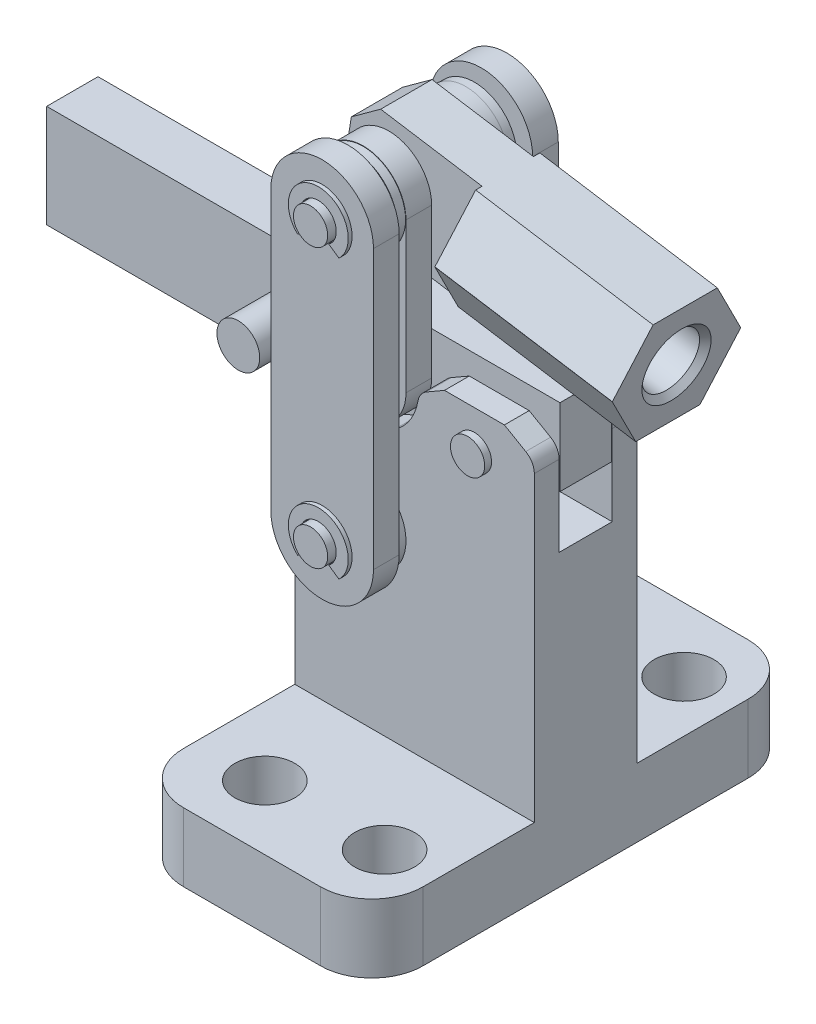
ISO-10303-21;
HEADER;
FILE_DESCRIPTION(('STEP AP214'),'2;1');
FILE_NAME('part.step','',(''),(''),'','','');
FILE_SCHEMA(('AUTOMOTIVE_DESIGN { 1 0 10303 214 1 1 1 1 }'));
ENDSEC;
DATA;
#1=APPLICATION_CONTEXT('core data for automotive mechanical design processes');
#2=APPLICATION_PROTOCOL_DEFINITION('international standard','automotive_design',2000,#1);
#3=PRODUCT_CONTEXT('',#1,'mechanical');
#4=PRODUCT('Part','Part','',(#3));
#5=PRODUCT_RELATED_PRODUCT_CATEGORY('part','',(#4));
#6=PRODUCT_DEFINITION_FORMATION('','',#4);
#7=PRODUCT_DEFINITION_CONTEXT('part definition',#1,'design');
#8=PRODUCT_DEFINITION('design','',#6,#7);
#9=PRODUCT_DEFINITION_SHAPE('','',#8);
#10=(LENGTH_UNIT() NAMED_UNIT(*) SI_UNIT(.MILLI.,.METRE.));
#11=(NAMED_UNIT(*) PLANE_ANGLE_UNIT() SI_UNIT($,.RADIAN.));
#12=(NAMED_UNIT(*) SI_UNIT($,.STERADIAN.) SOLID_ANGLE_UNIT());
#13=UNCERTAINTY_MEASURE_WITH_UNIT(LENGTH_MEASURE(1.E-05),#10,'distance_accuracy_value','');
#14=(GEOMETRIC_REPRESENTATION_CONTEXT(3) GLOBAL_UNCERTAINTY_ASSIGNED_CONTEXT((#13)) GLOBAL_UNIT_ASSIGNED_CONTEXT((#10,
#11,#12)) REPRESENTATION_CONTEXT('',''));
#15=CARTESIAN_POINT('',(0.,0.,0.));
#16=DIRECTION('',(0.,0.,1.));
#17=DIRECTION('',(1.,0.,0.));
#18=AXIS2_PLACEMENT_3D('',#15,#16,#17);
#19=CARTESIAN_POINT('',(-9.6,44.,28.5));
#20=DIRECTION('',(0.,0.,1.));
#21=DIRECTION('',(1.,0.,0.));
#22=AXIS2_PLACEMENT_3D('',#19,#20,#21);
#23=PLANE('',#22);
#24=CARTESIAN_POINT('',(-9.6,44.,28.5));
#25=DIRECTION('',(0.,0.,1.));
#26=DIRECTION('',(1.,0.,0.));
#27=AXIS2_PLACEMENT_3D('',#24,#25,#26);
#28=CIRCLE('',#27,2.5);
#29=CARTESIAN_POINT('',(-7.1,44.,28.5));
#30=VERTEX_POINT('',#29);
#31=EDGE_CURVE('P0_E19',#30,#30,#28,.F.);
#32=ORIENTED_EDGE('',*,*,#31,.F.);
#33=EDGE_LOOP('',(#32));
#34=FACE_BOUND('',#33,.T.);
#35=ADVANCED_FACE('P0_F16',(#34),#23,.T.);
#36=CARTESIAN_POINT('',(-9.6,44.,28.5));
#37=DIRECTION('',(0.,0.,1.));
#38=DIRECTION('',(1.,0.,0.));
#39=AXIS2_PLACEMENT_3D('',#36,#37,#38);
#40=CYLINDRICAL_SURFACE('',#39,2.5);
#41=ORIENTED_EDGE('',*,*,#31,.T.);
#42=EDGE_LOOP('',(#41));
#43=FACE_BOUND('',#42,.T.);
#44=CARTESIAN_POINT('',(-9.6,44.,20.5));
#45=DIRECTION('',(0.,0.,1.));
#46=DIRECTION('',(1.,0.,0.));
#47=AXIS2_PLACEMENT_3D('',#44,#45,#46);
#48=CIRCLE('',#47,2.5);
#49=CARTESIAN_POINT('',(-7.1,44.,20.5));
#50=VERTEX_POINT('',#49);
#51=EDGE_CURVE('P0_E115',#50,#50,#48,.F.);
#52=ORIENTED_EDGE('',*,*,#51,.F.);
#53=EDGE_LOOP('',(#52));
#54=FACE_BOUND('',#53,.T.);
#55=ADVANCED_FACE('P0_F126',(#43,#54),#40,.T.);
#56=CARTESIAN_POINT('',(-9.6,44.,6.5));
#57=DIRECTION('',(0.,0.,1.));
#58=DIRECTION('',(1.,0.,0.));
#59=AXIS2_PLACEMENT_3D('',#56,#57,#58);
#60=PLANE('',#59);
#61=CARTESIAN_POINT('',(-9.6,44.,6.5));
#62=DIRECTION('',(0.,0.,1.));
#63=DIRECTION('',(1.,0.,0.));
#64=AXIS2_PLACEMENT_3D('',#61,#62,#63);
#65=CIRCLE('',#64,2.5);
#66=CARTESIAN_POINT('',(-7.1,44.,6.5));
#67=VERTEX_POINT('',#66);
#68=EDGE_CURVE('P0_E113',#67,#67,#65,.T.);
#69=ORIENTED_EDGE('',*,*,#68,.F.);
#70=EDGE_LOOP('',(#69));
#71=FACE_BOUND('',#70,.T.);
#72=ADVANCED_FACE('P0_F133',(#71),#60,.F.);
#73=CARTESIAN_POINT('',(-8.,0.,20.5));
#74=DIRECTION('',(0.,0.,1.));
#75=DIRECTION('',(1.,0.,0.));
#76=AXIS2_PLACEMENT_3D('',#73,#74,#75);
#77=PLANE('',#76);
#78=DIRECTION('',(0.,1.,0.));
#79=VECTOR('',#78,1.);
#80=CARTESIAN_POINT('',(20.,40.,20.5));
#81=LINE('',#80,#79);
#82=CARTESIAN_POINT('',(20.,40.,20.5));
#83=VERTEX_POINT('',#82);
#84=CARTESIAN_POINT('',(20.,49.,20.5));
#85=VERTEX_POINT('',#84);
#86=EDGE_CURVE('P0_E376',#83,#85,#81,.T.);
#87=ORIENTED_EDGE('',*,*,#86,.T.);
#88=DIRECTION('',(1.,0.,0.));
#89=VECTOR('',#88,1.);
#90=CARTESIAN_POINT('',(20.,49.,20.5));
#91=LINE('',#90,#89);
#92=CARTESIAN_POINT('',(-40.,49.,20.5));
#93=VERTEX_POINT('',#92);
#94=EDGE_CURVE('P0_E382',#85,#93,#91,.F.);
#95=ORIENTED_EDGE('',*,*,#94,.T.);
#96=DIRECTION('',(0.,1.,0.));
#97=VECTOR('',#96,1.);
#98=CARTESIAN_POINT('',(-40.,49.,20.5));
#99=LINE('',#98,#97);
#100=CARTESIAN_POINT('',(-40.,37.,20.5));
#101=VERTEX_POINT('',#100);
#102=EDGE_CURVE('P0_E67',#93,#101,#99,.F.);
#103=ORIENTED_EDGE('',*,*,#102,.T.);
#104=DIRECTION('',(1.,0.,0.));
#105=VECTOR('',#104,1.);
#106=CARTESIAN_POINT('',(-40.,37.,20.5));
#107=LINE('',#106,#105);
#108=CARTESIAN_POINT('',(17.,37.,20.5));
#109=VERTEX_POINT('',#108);
#110=EDGE_CURVE('P0_E64',#101,#109,#107,.T.);
#111=ORIENTED_EDGE('',*,*,#110,.T.);
#112=DIRECTION('',(-0.707106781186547,-0.707106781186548,0.));
#113=VECTOR('',#112,1.);
#114=CARTESIAN_POINT('',(17.,37.,20.5));
#115=LINE('',#114,#113);
#116=EDGE_CURVE('P0_E61',#109,#83,#115,.F.);
#117=ORIENTED_EDGE('',*,*,#116,.T.);
#118=EDGE_LOOP('',(#87,#95,#103,#111,#117));
#119=FACE_BOUND('',#118,.T.);
#120=CARTESIAN_POINT('',(13.,42.,20.5));
#121=DIRECTION('',(0.,0.,1.));
#122=DIRECTION('',(1.,0.,0.));
#123=AXIS2_PLACEMENT_3D('',#120,#121,#122);
#124=CIRCLE('',#123,2.);
#125=CARTESIAN_POINT('',(15.,42.,20.5));
#126=VERTEX_POINT('',#125);
#127=EDGE_CURVE('P0_E74',#126,#126,#124,.F.);
#128=ORIENTED_EDGE('',*,*,#127,.T.);
#129=EDGE_LOOP('',(#128));
#130=FACE_BOUND('',#129,.T.);
#131=CARTESIAN_POINT('',(0.,44.,20.5));
#132=DIRECTION('',(0.,0.,1.));
#133=DIRECTION('',(1.,0.,0.));
#134=AXIS2_PLACEMENT_3D('',#131,#132,#133);
#135=CIRCLE('',#134,2.);
#136=CARTESIAN_POINT('',(2.,44.,20.5));
#137=VERTEX_POINT('',#136);
#138=EDGE_CURVE('P0_E109',#137,#137,#135,.F.);
#139=ORIENTED_EDGE('',*,*,#138,.T.);
#140=EDGE_LOOP('',(#139));
#141=FACE_BOUND('',#140,.T.);
#142=ORIENTED_EDGE('',*,*,#51,.T.);
#143=EDGE_LOOP('',(#142));
#144=FACE_BOUND('',#143,.T.);
#145=ADVANCED_FACE('P0_F65',(#119,#130,#141,#144),#77,.T.);
#146=CARTESIAN_POINT('',(-9.6,44.,28.5));
#147=DIRECTION('',(0.,0.,1.));
#148=DIRECTION('',(1.,0.,0.));
#149=AXIS2_PLACEMENT_3D('',#146,#147,#148);
#150=CYLINDRICAL_SURFACE('',#149,2.5);
#151=CARTESIAN_POINT('',(-9.6,44.,14.5));
#152=DIRECTION('',(0.,0.,1.));
#153=DIRECTION('',(1.,0.,0.));
#154=AXIS2_PLACEMENT_3D('',#151,#152,#153);
#155=CIRCLE('',#154,2.5);
#156=CARTESIAN_POINT('',(-7.1,44.,14.5));
#157=VERTEX_POINT('',#156);
#158=EDGE_CURVE('P0_E102',#157,#157,#155,.F.);
#159=ORIENTED_EDGE('',*,*,#158,.T.);
#160=EDGE_LOOP('',(#159));
#161=FACE_BOUND('',#160,.T.);
#162=ORIENTED_EDGE('',*,*,#68,.T.);
#163=EDGE_LOOP('',(#162));
#164=FACE_BOUND('',#163,.T.);
#165=ADVANCED_FACE('P0_F164',(#161,#164),#150,.T.);
#166=CARTESIAN_POINT('',(0.,44.,20.5));
#167=DIRECTION('',(0.,0.,1.));
#168=DIRECTION('',(1.,0.,0.));
#169=AXIS2_PLACEMENT_3D('',#166,#167,#168);
#170=CYLINDRICAL_SURFACE('',#169,2.);
#171=CARTESIAN_POINT('',(0.,44.,14.5));
#172=DIRECTION('',(0.,0.,1.));
#173=DIRECTION('',(1.,0.,0.));
#174=AXIS2_PLACEMENT_3D('',#171,#172,#173);
#175=CIRCLE('',#174,2.);
#176=CARTESIAN_POINT('',(2.,44.,14.5));
#177=VERTEX_POINT('',#176);
#178=EDGE_CURVE('P0_E98',#177,#177,#175,.F.);
#179=ORIENTED_EDGE('',*,*,#178,.T.);
#180=EDGE_LOOP('',(#179));
#181=FACE_BOUND('',#180,.T.);
#182=ORIENTED_EDGE('',*,*,#138,.F.);
#183=EDGE_LOOP('',(#182));
#184=FACE_BOUND('',#183,.T.);
#185=ADVANCED_FACE('P0_F160',(#181,#184),#170,.F.);
#186=CARTESIAN_POINT('',(13.,42.,20.5));
#187=DIRECTION('',(0.,0.,1.));
#188=DIRECTION('',(1.,0.,0.));
#189=AXIS2_PLACEMENT_3D('',#186,#187,#188);
#190=CYLINDRICAL_SURFACE('',#189,2.);
#191=CARTESIAN_POINT('',(13.,42.,14.5));
#192=DIRECTION('',(0.,0.,1.));
#193=DIRECTION('',(1.,0.,0.));
#194=AXIS2_PLACEMENT_3D('',#191,#192,#193);
#195=CIRCLE('',#194,2.);
#196=CARTESIAN_POINT('',(15.,42.,14.5));
#197=VERTEX_POINT('',#196);
#198=EDGE_CURVE('P0_E94',#197,#197,#195,.F.);
#199=ORIENTED_EDGE('',*,*,#198,.T.);
#200=EDGE_LOOP('',(#199));
#201=FACE_BOUND('',#200,.T.);
#202=ORIENTED_EDGE('',*,*,#127,.F.);
#203=EDGE_LOOP('',(#202));
#204=FACE_BOUND('',#203,.T.);
#205=ADVANCED_FACE('P0_F157',(#201,#204),#190,.F.);
#206=CARTESIAN_POINT('',(-40.,37.,20.5));
#207=DIRECTION('',(0.,1.,0.));
#208=DIRECTION('',(0.,0.,1.));
#209=AXIS2_PLACEMENT_3D('',#206,#207,#208);
#210=PLANE('',#209);
#211=DIRECTION('',(0.,0.,1.));
#212=VECTOR('',#211,1.);
#213=CARTESIAN_POINT('',(17.,37.,20.5));
#214=LINE('',#213,#212);
#215=CARTESIAN_POINT('',(17.,37.,14.5));
#216=VERTEX_POINT('',#215);
#217=EDGE_CURVE('P0_E73',#216,#109,#214,.T.);
#218=ORIENTED_EDGE('',*,*,#217,.T.);
#219=ORIENTED_EDGE('',*,*,#110,.F.);
#220=DIRECTION('',(0.,0.,-1.));
#221=VECTOR('',#220,1.);
#222=CARTESIAN_POINT('',(-40.,37.,20.5));
#223=LINE('',#222,#221);
#224=CARTESIAN_POINT('',(-40.,37.,14.5));
#225=VERTEX_POINT('',#224);
#226=EDGE_CURVE('P0_E105',#101,#225,#223,.T.);
#227=ORIENTED_EDGE('',*,*,#226,.T.);
#228=DIRECTION('',(1.,0.,0.));
#229=VECTOR('',#228,1.);
#230=CARTESIAN_POINT('',(-8.,37.,14.5));
#231=LINE('',#230,#229);
#232=EDGE_CURVE('P0_E86',#225,#216,#231,.T.);
#233=ORIENTED_EDGE('',*,*,#232,.T.);
#234=EDGE_LOOP('',(#218,#219,#227,#233));
#235=FACE_BOUND('',#234,.T.);
#236=ADVANCED_FACE('P0_F85',(#235),#210,.F.);
#237=CARTESIAN_POINT('',(17.,37.,20.5));
#238=DIRECTION('',(-0.707106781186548,0.707106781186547,0.));
#239=DIRECTION('',(-0.707106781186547,-0.707106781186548,0.));
#240=AXIS2_PLACEMENT_3D('',#237,#238,#239);
#241=PLANE('',#240);
#242=DIRECTION('',(0.,0.,1.));
#243=VECTOR('',#242,1.);
#244=CARTESIAN_POINT('',(20.,40.,20.5));
#245=LINE('',#244,#243);
#246=CARTESIAN_POINT('',(20.,40.,14.5));
#247=VERTEX_POINT('',#246);
#248=EDGE_CURVE('P0_E81',#247,#83,#245,.T.);
#249=ORIENTED_EDGE('',*,*,#248,.T.);
#250=ORIENTED_EDGE('',*,*,#116,.F.);
#251=ORIENTED_EDGE('',*,*,#217,.F.);
#252=DIRECTION('',(0.707106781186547,0.707106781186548,0.));
#253=VECTOR('',#252,1.);
#254=CARTESIAN_POINT('',(17.,37.,14.5));
#255=LINE('',#254,#253);
#256=EDGE_CURVE('P0_E398',#216,#247,#255,.T.);
#257=ORIENTED_EDGE('',*,*,#256,.T.);
#258=EDGE_LOOP('',(#249,#250,#251,#257));
#259=FACE_BOUND('',#258,.T.);
#260=ADVANCED_FACE('P0_F78',(#259),#241,.F.);
#261=CARTESIAN_POINT('',(20.,40.,20.5));
#262=DIRECTION('',(-1.,0.,0.));
#263=DIRECTION('',(0.,0.,1.));
#264=AXIS2_PLACEMENT_3D('',#261,#262,#263);
#265=PLANE('',#264);
#266=DIRECTION('',(0.,0.,-1.));
#267=VECTOR('',#266,1.);
#268=CARTESIAN_POINT('',(20.,49.,20.5));
#269=LINE('',#268,#267);
#270=CARTESIAN_POINT('',(20.,49.,14.5));
#271=VERTEX_POINT('',#270);
#272=EDGE_CURVE('P0_E375',#271,#85,#269,.F.);
#273=ORIENTED_EDGE('',*,*,#272,.T.);
#274=ORIENTED_EDGE('',*,*,#86,.F.);
#275=ORIENTED_EDGE('',*,*,#248,.F.);
#276=DIRECTION('',(0.,1.,0.));
#277=VECTOR('',#276,1.);
#278=CARTESIAN_POINT('',(20.,0.,14.5));
#279=LINE('',#278,#277);
#280=EDGE_CURVE('P0_E378',#247,#271,#279,.T.);
#281=ORIENTED_EDGE('',*,*,#280,.T.);
#282=EDGE_LOOP('',(#273,#274,#275,#281));
#283=FACE_BOUND('',#282,.T.);
#284=ADVANCED_FACE('P0_F148',(#283),#265,.F.);
#285=CARTESIAN_POINT('',(20.,49.,20.5));
#286=DIRECTION('',(0.,-1.,0.));
#287=DIRECTION('',(0.,0.,-1.));
#288=AXIS2_PLACEMENT_3D('',#285,#286,#287);
#289=PLANE('',#288);
#290=DIRECTION('',(0.,0.,-1.));
#291=VECTOR('',#290,1.);
#292=CARTESIAN_POINT('',(-40.,49.,20.5));
#293=LINE('',#292,#291);
#294=CARTESIAN_POINT('',(-40.,49.,14.5));
#295=VERTEX_POINT('',#294);
#296=EDGE_CURVE('P0_E34',#295,#93,#293,.F.);
#297=ORIENTED_EDGE('',*,*,#296,.T.);
#298=ORIENTED_EDGE('',*,*,#94,.F.);
#299=ORIENTED_EDGE('',*,*,#272,.F.);
#300=DIRECTION('',(1.,0.,0.));
#301=VECTOR('',#300,1.);
#302=CARTESIAN_POINT('',(-8.,49.,14.5));
#303=LINE('',#302,#301);
#304=EDGE_CURVE('P0_E26',#271,#295,#303,.F.);
#305=ORIENTED_EDGE('',*,*,#304,.T.);
#306=EDGE_LOOP('',(#297,#298,#299,#305));
#307=FACE_BOUND('',#306,.T.);
#308=ADVANCED_FACE('P0_F141',(#307),#289,.F.);
#309=CARTESIAN_POINT('',(-40.,49.,20.5));
#310=DIRECTION('',(1.,0.,0.));
#311=DIRECTION('',(0.,0.,-1.));
#312=AXIS2_PLACEMENT_3D('',#309,#310,#311);
#313=PLANE('',#312);
#314=ORIENTED_EDGE('',*,*,#226,.F.);
#315=ORIENTED_EDGE('',*,*,#102,.F.);
#316=ORIENTED_EDGE('',*,*,#296,.F.);
#317=DIRECTION('',(0.,1.,0.));
#318=VECTOR('',#317,1.);
#319=CARTESIAN_POINT('',(-40.,0.,14.5));
#320=LINE('',#319,#318);
#321=EDGE_CURVE('P0_E11',#295,#225,#320,.F.);
#322=ORIENTED_EDGE('',*,*,#321,.T.);
#323=EDGE_LOOP('',(#314,#315,#316,#322));
#324=FACE_BOUND('',#323,.T.);
#325=ADVANCED_FACE('P0_F136',(#324),#313,.F.);
#326=CARTESIAN_POINT('',(-8.,0.,14.5));
#327=DIRECTION('',(0.,0.,1.));
#328=DIRECTION('',(1.,0.,0.));
#329=AXIS2_PLACEMENT_3D('',#326,#327,#328);
#330=PLANE('',#329);
#331=ORIENTED_EDGE('',*,*,#304,.F.);
#332=ORIENTED_EDGE('',*,*,#280,.F.);
#333=ORIENTED_EDGE('',*,*,#256,.F.);
#334=ORIENTED_EDGE('',*,*,#232,.F.);
#335=ORIENTED_EDGE('',*,*,#321,.F.);
#336=EDGE_LOOP('',(#331,#332,#333,#334,#335));
#337=FACE_BOUND('',#336,.T.);
#338=ORIENTED_EDGE('',*,*,#198,.F.);
#339=EDGE_LOOP('',(#338));
#340=FACE_BOUND('',#339,.T.);
#341=ORIENTED_EDGE('',*,*,#178,.F.);
#342=EDGE_LOOP('',(#341));
#343=FACE_BOUND('',#342,.T.);
#344=ORIENTED_EDGE('',*,*,#158,.F.);
#345=EDGE_LOOP('',(#344));
#346=FACE_BOUND('',#345,.T.);
#347=ADVANCED_FACE('P0_F134',(#337,#340,#343,#346),#330,.F.);
#348=CLOSED_SHELL('',(#35,#55,#72,#145,#165,#185,#205,#236,#260,#284,#308,#325,#347));
#349=MANIFOLD_SOLID_BREP('P0_B1',#348);
#350=CARTESIAN_POINT('',(0.,44.,24.3));
#351=DIRECTION('',(0.,0.,1.));
#352=DIRECTION('',(1.,0.,0.));
#353=AXIS2_PLACEMENT_3D('',#350,#351,#352);
#354=PLANE('',#353);
#355=CARTESIAN_POINT('',(0.,44.,24.3));
#356=DIRECTION('',(0.,0.,1.));
#357=DIRECTION('',(1.,0.,0.));
#358=AXIS2_PLACEMENT_3D('',#355,#356,#357);
#359=CIRCLE('',#358,2.);
#360=CARTESIAN_POINT('',(2.,44.,24.3));
#361=VERTEX_POINT('',#360);
#362=EDGE_CURVE('P1_E18',#361,#361,#359,.F.);
#363=ORIENTED_EDGE('',*,*,#362,.F.);
#364=EDGE_LOOP('',(#363));
#365=FACE_BOUND('',#364,.T.);
#366=ADVANCED_FACE('P1_F15',(#365),#354,.T.);
#367=CARTESIAN_POINT('',(0.,61.5,24.5));
#368=DIRECTION('',(0.,0.,1.));
#369=DIRECTION('',(1.,0.,0.));
#370=AXIS2_PLACEMENT_3D('',#367,#368,#369);
#371=CYLINDRICAL_SURFACE('',#370,4.95);
#372=CARTESIAN_POINT('',(0.,61.5,24.5));
#373=DIRECTION('',(0.,0.,1.));
#374=DIRECTION('',(1.,0.,0.));
#375=AXIS2_PLACEMENT_3D('',#372,#373,#374);
#376=CIRCLE('',#375,4.95);
#377=CARTESIAN_POINT('',(4.95,61.5,24.5));
#378=VERTEX_POINT('',#377);
#379=EDGE_CURVE('P1_E191',#378,#378,#376,.T.);
#380=ORIENTED_EDGE('',*,*,#379,.F.);
#381=EDGE_LOOP('',(#380));
#382=FACE_BOUND('',#381,.T.);
#383=CARTESIAN_POINT('',(0.,61.5,23.5));
#384=DIRECTION('',(0.,0.,1.));
#385=DIRECTION('',(1.,0.,0.));
#386=AXIS2_PLACEMENT_3D('',#383,#384,#385);
#387=CIRCLE('',#386,4.95);
#388=CARTESIAN_POINT('',(4.95,61.5,23.5));
#389=VERTEX_POINT('',#388);
#390=EDGE_CURVE('P1_E188',#389,#389,#387,.F.);
#391=ORIENTED_EDGE('',*,*,#390,.F.);
#392=EDGE_LOOP('',(#391));
#393=FACE_BOUND('',#392,.T.);
#394=ADVANCED_FACE('P1_F206',(#382,#393),#371,.T.);
#395=CARTESIAN_POINT('',(0.,44.,24.3));
#396=DIRECTION('',(0.,0.,1.));
#397=DIRECTION('',(1.,0.,0.));
#398=AXIS2_PLACEMENT_3D('',#395,#396,#397);
#399=CYLINDRICAL_SURFACE('',#398,2.);
#400=ORIENTED_EDGE('',*,*,#362,.T.);
#401=EDGE_LOOP('',(#400));
#402=FACE_BOUND('',#401,.T.);
#403=CARTESIAN_POINT('',(0.,44.,23.5));
#404=DIRECTION('',(0.,0.,1.));
#405=DIRECTION('',(1.,0.,0.));
#406=AXIS2_PLACEMENT_3D('',#403,#404,#405);
#407=CIRCLE('',#406,2.);
#408=CARTESIAN_POINT('',(2.,44.,23.5));
#409=VERTEX_POINT('',#408);
#410=EDGE_CURVE('P1_E184',#409,#409,#407,.F.);
#411=ORIENTED_EDGE('',*,*,#410,.F.);
#412=EDGE_LOOP('',(#411));
#413=FACE_BOUND('',#412,.T.);
#414=ADVANCED_FACE('P1_F202',(#402,#413),#399,.T.);
#415=CARTESIAN_POINT('',(0.,61.5,24.5));
#416=DIRECTION('',(0.,0.,1.));
#417=DIRECTION('',(1.,0.,0.));
#418=AXIS2_PLACEMENT_3D('',#415,#416,#417);
#419=PLANE('',#418);
#420=ORIENTED_EDGE('',*,*,#379,.T.);
#421=EDGE_LOOP('',(#420));
#422=FACE_BOUND('',#421,.T.);
#423=CARTESIAN_POINT('',(0.,61.5,24.5));
#424=DIRECTION('',(0.,0.,1.));
#425=DIRECTION('',(1.,0.,0.));
#426=AXIS2_PLACEMENT_3D('',#423,#424,#425);
#427=CIRCLE('',#426,2.);
#428=CARTESIAN_POINT('',(2.,61.5,24.5));
#429=VERTEX_POINT('',#428);
#430=EDGE_CURVE('P1_E95',#429,#429,#427,.F.);
#431=ORIENTED_EDGE('',*,*,#430,.T.);
#432=EDGE_LOOP('',(#431));
#433=FACE_BOUND('',#432,.T.);
#434=ADVANCED_FACE('P1_F283',(#422,#433),#419,.T.);
#435=CARTESIAN_POINT('',(0.,44.,23.5));
#436=DIRECTION('',(0.,0.,1.));
#437=DIRECTION('',(1.,0.,0.));
#438=AXIS2_PLACEMENT_3D('',#435,#436,#437);
#439=PLANE('',#438);
#440=DIRECTION('',(0.,1.,0.));
#441=VECTOR('',#440,1.);
#442=CARTESIAN_POINT('',(5.,44.,23.5));
#443=LINE('',#442,#441);
#444=CARTESIAN_POINT('',(5.,44.,23.5));
#445=VERTEX_POINT('',#444);
#446=CARTESIAN_POINT('',(5.,61.5,23.5));
#447=VERTEX_POINT('',#446);
#448=EDGE_CURVE('P1_E81',#445,#447,#443,.T.);
#449=ORIENTED_EDGE('',*,*,#448,.T.);
#450=CARTESIAN_POINT('',(0.,61.5,23.5));
#451=DIRECTION('',(0.,0.,1.));
#452=DIRECTION('',(1.,0.,0.));
#453=AXIS2_PLACEMENT_3D('',#450,#451,#452);
#454=CIRCLE('',#453,5.);
#455=CARTESIAN_POINT('',(-5.,61.5,23.5));
#456=VERTEX_POINT('',#455);
#457=EDGE_CURVE('P1_E85',#456,#447,#454,.F.);
#458=ORIENTED_EDGE('',*,*,#457,.F.);
#459=DIRECTION('',(0.,1.,0.));
#460=VECTOR('',#459,1.);
#461=CARTESIAN_POINT('',(-5.,61.5,23.5));
#462=LINE('',#461,#460);
#463=CARTESIAN_POINT('',(-5.,44.,23.5));
#464=VERTEX_POINT('',#463);
#465=EDGE_CURVE('P1_E76',#456,#464,#462,.F.);
#466=ORIENTED_EDGE('',*,*,#465,.T.);
#467=CARTESIAN_POINT('',(0.,44.,23.5));
#468=DIRECTION('',(0.,0.,1.));
#469=DIRECTION('',(1.,0.,0.));
#470=AXIS2_PLACEMENT_3D('',#467,#468,#469);
#471=CIRCLE('',#470,5.);
#472=EDGE_CURVE('P1_E88',#445,#464,#471,.F.);
#473=ORIENTED_EDGE('',*,*,#472,.F.);
#474=EDGE_LOOP('',(#449,#458,#466,#473));
#475=FACE_BOUND('',#474,.T.);
#476=ORIENTED_EDGE('',*,*,#410,.T.);
#477=EDGE_LOOP('',(#476));
#478=FACE_BOUND('',#477,.T.);
#479=ORIENTED_EDGE('',*,*,#390,.T.);
#480=EDGE_LOOP('',(#479));
#481=FACE_BOUND('',#480,.T.);
#482=ADVANCED_FACE('P1_F83',(#475,#478,#481),#439,.T.);
#483=CARTESIAN_POINT('',(0.,44.,10.7));
#484=DIRECTION('',(0.,0.,1.));
#485=DIRECTION('',(1.,0.,0.));
#486=AXIS2_PLACEMENT_3D('',#483,#484,#485);
#487=PLANE('',#486);
#488=CARTESIAN_POINT('',(0.,44.,10.7));
#489=DIRECTION('',(0.,0.,1.));
#490=DIRECTION('',(1.,0.,0.));
#491=AXIS2_PLACEMENT_3D('',#488,#489,#490);
#492=CIRCLE('',#491,2.);
#493=CARTESIAN_POINT('',(2.,44.,10.7));
#494=VERTEX_POINT('',#493);
#495=EDGE_CURVE('P1_E175',#494,#494,#492,.T.);
#496=ORIENTED_EDGE('',*,*,#495,.F.);
#497=EDGE_LOOP('',(#496));
#498=FACE_BOUND('',#497,.T.);
#499=ADVANCED_FACE('P1_F276',(#498),#487,.F.);
#500=CARTESIAN_POINT('',(0.,61.5,25.));
#501=DIRECTION('',(0.,0.,1.));
#502=DIRECTION('',(1.,0.,0.));
#503=AXIS2_PLACEMENT_3D('',#500,#501,#502);
#504=CYLINDRICAL_SURFACE('',#503,2.);
#505=CARTESIAN_POINT('',(0.,61.5,20.5));
#506=DIRECTION('',(0.,0.,1.));
#507=DIRECTION('',(1.,0.,0.));
#508=AXIS2_PLACEMENT_3D('',#505,#506,#507);
#509=CIRCLE('',#508,2.);
#510=CARTESIAN_POINT('',(2.,61.5,20.5));
#511=VERTEX_POINT('',#510);
#512=EDGE_CURVE('P1_E167',#511,#511,#509,.F.);
#513=ORIENTED_EDGE('',*,*,#512,.T.);
#514=EDGE_LOOP('',(#513));
#515=FACE_BOUND('',#514,.T.);
#516=ORIENTED_EDGE('',*,*,#430,.F.);
#517=EDGE_LOOP('',(#516));
#518=FACE_BOUND('',#517,.T.);
#519=ADVANCED_FACE('P1_F273',(#515,#518),#504,.F.);
#520=CARTESIAN_POINT('',(5.,44.,23.5));
#521=DIRECTION('',(-1.,0.,0.));
#522=DIRECTION('',(0.,0.,1.));
#523=AXIS2_PLACEMENT_3D('',#520,#521,#522);
#524=PLANE('',#523);
#525=DIRECTION('',(0.,0.,1.));
#526=VECTOR('',#525,1.);
#527=CARTESIAN_POINT('',(5.,61.5,23.5));
#528=LINE('',#527,#526);
#529=CARTESIAN_POINT('',(5.,61.5,20.5));
#530=VERTEX_POINT('',#529);
#531=EDGE_CURVE('P1_E94',#447,#530,#528,.F.);
#532=ORIENTED_EDGE('',*,*,#531,.F.);
#533=ORIENTED_EDGE('',*,*,#448,.F.);
#534=DIRECTION('',(0.,0.,1.));
#535=VECTOR('',#534,1.);
#536=CARTESIAN_POINT('',(5.,44.,23.5));
#537=LINE('',#536,#535);
#538=CARTESIAN_POINT('',(5.,44.,20.5));
#539=VERTEX_POINT('',#538);
#540=EDGE_CURVE('P1_E179',#539,#445,#537,.T.);
#541=ORIENTED_EDGE('',*,*,#540,.F.);
#542=DIRECTION('',(0.,1.,0.));
#543=VECTOR('',#542,1.);
#544=CARTESIAN_POINT('',(5.,56.5,20.5));
#545=LINE('',#544,#543);
#546=EDGE_CURVE('P1_E106',#539,#530,#545,.T.);
#547=ORIENTED_EDGE('',*,*,#546,.T.);
#548=EDGE_LOOP('',(#532,#533,#541,#547));
#549=FACE_BOUND('',#548,.T.);
#550=ADVANCED_FACE('P1_F105',(#549),#524,.F.);
#551=CARTESIAN_POINT('',(0.,61.5,23.5));
#552=DIRECTION('',(0.,0.,1.));
#553=DIRECTION('',(1.,0.,0.));
#554=AXIS2_PLACEMENT_3D('',#551,#552,#553);
#555=CYLINDRICAL_SURFACE('',#554,5.);
#556=DIRECTION('',(0.,0.,-1.));
#557=VECTOR('',#556,1.);
#558=CARTESIAN_POINT('',(-5.,61.5,23.5));
#559=LINE('',#558,#557);
#560=CARTESIAN_POINT('',(-5.,61.5,20.5));
#561=VERTEX_POINT('',#560);
#562=EDGE_CURVE('P1_E101',#561,#456,#559,.F.);
#563=ORIENTED_EDGE('',*,*,#562,.T.);
#564=ORIENTED_EDGE('',*,*,#457,.T.);
#565=ORIENTED_EDGE('',*,*,#531,.T.);
#566=CARTESIAN_POINT('',(0.,61.5,20.5));
#567=DIRECTION('',(0.,0.,1.));
#568=DIRECTION('',(1.,0.,0.));
#569=AXIS2_PLACEMENT_3D('',#566,#567,#568);
#570=CIRCLE('',#569,5.);
#571=EDGE_CURVE('P1_E164',#530,#561,#570,.T.);
#572=ORIENTED_EDGE('',*,*,#571,.T.);
#573=EDGE_LOOP('',(#563,#564,#565,#572));
#574=FACE_BOUND('',#573,.T.);
#575=ADVANCED_FACE('P1_F98',(#574),#555,.T.);
#576=CARTESIAN_POINT('',(-5.,61.5,23.5));
#577=DIRECTION('',(1.,0.,0.));
#578=DIRECTION('',(0.,0.,-1.));
#579=AXIS2_PLACEMENT_3D('',#576,#577,#578);
#580=PLANE('',#579);
#581=DIRECTION('',(0.,1.,0.));
#582=VECTOR('',#581,1.);
#583=CARTESIAN_POINT('',(-5.,56.5,20.5));
#584=LINE('',#583,#582);
#585=CARTESIAN_POINT('',(-5.,44.,20.5));
#586=VERTEX_POINT('',#585);
#587=EDGE_CURVE('P1_E163',#561,#586,#584,.F.);
#588=ORIENTED_EDGE('',*,*,#587,.T.);
#589=DIRECTION('',(0.,0.,1.));
#590=VECTOR('',#589,1.);
#591=CARTESIAN_POINT('',(-5.,44.,23.5));
#592=LINE('',#591,#590);
#593=EDGE_CURVE('P1_E624',#464,#586,#592,.F.);
#594=ORIENTED_EDGE('',*,*,#593,.F.);
#595=ORIENTED_EDGE('',*,*,#465,.F.);
#596=ORIENTED_EDGE('',*,*,#562,.F.);
#597=EDGE_LOOP('',(#588,#594,#595,#596));
#598=FACE_BOUND('',#597,.T.);
#599=ADVANCED_FACE('P1_F265',(#598),#580,.F.);
#600=CARTESIAN_POINT('',(0.,44.,23.5));
#601=DIRECTION('',(0.,0.,1.));
#602=DIRECTION('',(1.,0.,0.));
#603=AXIS2_PLACEMENT_3D('',#600,#601,#602);
#604=CYLINDRICAL_SURFACE('',#603,5.);
#605=ORIENTED_EDGE('',*,*,#540,.T.);
#606=ORIENTED_EDGE('',*,*,#472,.T.);
#607=ORIENTED_EDGE('',*,*,#593,.T.);
#608=CARTESIAN_POINT('',(0.,44.,20.5));
#609=DIRECTION('',(0.,0.,1.));
#610=DIRECTION('',(1.,0.,0.));
#611=AXIS2_PLACEMENT_3D('',#608,#609,#610);
#612=CIRCLE('',#611,5.);
#613=EDGE_CURVE('P1_E159',#586,#539,#612,.T.);
#614=ORIENTED_EDGE('',*,*,#613,.T.);
#615=EDGE_LOOP('',(#605,#606,#607,#614));
#616=FACE_BOUND('',#615,.T.);
#617=ADVANCED_FACE('P1_F261',(#616),#604,.T.);
#618=CARTESIAN_POINT('',(0.,61.5,24.5));
#619=DIRECTION('',(0.,0.,1.));
#620=DIRECTION('',(1.,0.,0.));
#621=AXIS2_PLACEMENT_3D('',#618,#619,#620);
#622=CYLINDRICAL_SURFACE('',#621,4.95);
#623=CARTESIAN_POINT('',(0.,61.5,11.5));
#624=DIRECTION('',(0.,0.,1.));
#625=DIRECTION('',(1.,0.,0.));
#626=AXIS2_PLACEMENT_3D('',#623,#624,#625);
#627=CIRCLE('',#626,4.95);
#628=CARTESIAN_POINT('',(4.95,61.5,11.5));
#629=VERTEX_POINT('',#628);
#630=EDGE_CURVE('P1_E155',#629,#629,#627,.F.);
#631=ORIENTED_EDGE('',*,*,#630,.T.);
#632=EDGE_LOOP('',(#631));
#633=FACE_BOUND('',#632,.T.);
#634=CARTESIAN_POINT('',(0.,61.5,10.5));
#635=DIRECTION('',(0.,0.,1.));
#636=DIRECTION('',(1.,0.,0.));
#637=AXIS2_PLACEMENT_3D('',#634,#635,#636);
#638=CIRCLE('',#637,4.95);
#639=CARTESIAN_POINT('',(4.95,61.5,10.5));
#640=VERTEX_POINT('',#639);
#641=EDGE_CURVE('P1_E171',#640,#640,#638,.T.);
#642=ORIENTED_EDGE('',*,*,#641,.T.);
#643=EDGE_LOOP('',(#642));
#644=FACE_BOUND('',#643,.T.);
#645=ADVANCED_FACE('P1_F257',(#633,#644),#622,.T.);
#646=CARTESIAN_POINT('',(0.,44.,24.3));
#647=DIRECTION('',(0.,0.,1.));
#648=DIRECTION('',(1.,0.,0.));
#649=AXIS2_PLACEMENT_3D('',#646,#647,#648);
#650=CYLINDRICAL_SURFACE('',#649,2.);
#651=CARTESIAN_POINT('',(0.,44.,11.5));
#652=DIRECTION('',(0.,0.,1.));
#653=DIRECTION('',(1.,0.,0.));
#654=AXIS2_PLACEMENT_3D('',#651,#652,#653);
#655=CIRCLE('',#654,2.);
#656=CARTESIAN_POINT('',(2.,44.,11.5));
#657=VERTEX_POINT('',#656);
#658=EDGE_CURVE('P1_E151',#657,#657,#655,.F.);
#659=ORIENTED_EDGE('',*,*,#658,.T.);
#660=EDGE_LOOP('',(#659));
#661=FACE_BOUND('',#660,.T.);
#662=ORIENTED_EDGE('',*,*,#495,.T.);
#663=EDGE_LOOP('',(#662));
#664=FACE_BOUND('',#663,.T.);
#665=ADVANCED_FACE('P1_F253',(#661,#664),#650,.T.);
#666=CARTESIAN_POINT('',(0.,61.5,10.5));
#667=DIRECTION('',(0.,0.,1.));
#668=DIRECTION('',(1.,0.,0.));
#669=AXIS2_PLACEMENT_3D('',#666,#667,#668);
#670=PLANE('',#669);
#671=ORIENTED_EDGE('',*,*,#641,.F.);
#672=EDGE_LOOP('',(#671));
#673=FACE_BOUND('',#672,.T.);
#674=CARTESIAN_POINT('',(0.,61.5,10.5));
#675=DIRECTION('',(0.,0.,1.));
#676=DIRECTION('',(1.,0.,0.));
#677=AXIS2_PLACEMENT_3D('',#674,#675,#676);
#678=CIRCLE('',#677,2.);
#679=CARTESIAN_POINT('',(2.,61.5,10.5));
#680=VERTEX_POINT('',#679);
#681=EDGE_CURVE('P1_E147',#680,#680,#678,.T.);
#682=ORIENTED_EDGE('',*,*,#681,.T.);
#683=EDGE_LOOP('',(#682));
#684=FACE_BOUND('',#683,.T.);
#685=ADVANCED_FACE('P1_F249',(#673,#684),#670,.F.);
#686=CARTESIAN_POINT('',(-5.5,56.5,20.5));
#687=DIRECTION('',(0.,0.,1.));
#688=DIRECTION('',(1.,0.,0.));
#689=AXIS2_PLACEMENT_3D('',#686,#687,#688);
#690=PLANE('',#689);
#691=ORIENTED_EDGE('',*,*,#587,.F.);
#692=ORIENTED_EDGE('',*,*,#571,.F.);
#693=ORIENTED_EDGE('',*,*,#546,.F.);
#694=ORIENTED_EDGE('',*,*,#613,.F.);
#695=EDGE_LOOP('',(#691,#692,#693,#694));
#696=FACE_BOUND('',#695,.T.);
#697=CARTESIAN_POINT('',(0.,44.,20.5));
#698=DIRECTION('',(0.,0.,1.));
#699=DIRECTION('',(1.,0.,0.));
#700=AXIS2_PLACEMENT_3D('',#697,#698,#699);
#701=CIRCLE('',#700,2.);
#702=CARTESIAN_POINT('',(2.,44.,20.5));
#703=VERTEX_POINT('',#702);
#704=EDGE_CURVE('P1_E143',#703,#703,#701,.F.);
#705=ORIENTED_EDGE('',*,*,#704,.F.);
#706=EDGE_LOOP('',(#705));
#707=FACE_BOUND('',#706,.T.);
#708=ORIENTED_EDGE('',*,*,#512,.F.);
#709=EDGE_LOOP('',(#708));
#710=FACE_BOUND('',#709,.T.);
#711=ADVANCED_FACE('P1_F245',(#696,#707,#710),#690,.F.);
#712=CARTESIAN_POINT('',(0.,44.,11.5));
#713=DIRECTION('',(0.,0.,1.));
#714=DIRECTION('',(1.,0.,0.));
#715=AXIS2_PLACEMENT_3D('',#712,#713,#714);
#716=PLANE('',#715);
#717=CARTESIAN_POINT('',(0.,61.5,11.5));
#718=DIRECTION('',(0.,0.,1.));
#719=DIRECTION('',(1.,0.,0.));
#720=AXIS2_PLACEMENT_3D('',#717,#718,#719);
#721=CIRCLE('',#720,5.);
#722=CARTESIAN_POINT('',(5.,61.5,11.5));
#723=VERTEX_POINT('',#722);
#724=CARTESIAN_POINT('',(-5.,61.5,11.5));
#725=VERTEX_POINT('',#724);
#726=EDGE_CURVE('P1_E133',#723,#725,#721,.T.);
#727=ORIENTED_EDGE('',*,*,#726,.F.);
#728=DIRECTION('',(0.,1.,0.));
#729=VECTOR('',#728,1.);
#730=CARTESIAN_POINT('',(5.,44.,11.5));
#731=LINE('',#730,#729);
#732=CARTESIAN_POINT('',(5.,44.,11.5));
#733=VERTEX_POINT('',#732);
#734=EDGE_CURVE('P1_E137',#723,#733,#731,.F.);
#735=ORIENTED_EDGE('',*,*,#734,.T.);
#736=CARTESIAN_POINT('',(0.,44.,11.5));
#737=DIRECTION('',(0.,0.,1.));
#738=DIRECTION('',(1.,0.,0.));
#739=AXIS2_PLACEMENT_3D('',#736,#737,#738);
#740=CIRCLE('',#739,5.);
#741=CARTESIAN_POINT('',(-5.,44.,11.5));
#742=VERTEX_POINT('',#741);
#743=EDGE_CURVE('P1_E139',#742,#733,#740,.T.);
#744=ORIENTED_EDGE('',*,*,#743,.F.);
#745=DIRECTION('',(0.,1.,0.));
#746=VECTOR('',#745,1.);
#747=CARTESIAN_POINT('',(-5.,61.5,11.5));
#748=LINE('',#747,#746);
#749=EDGE_CURVE('P1_E630',#742,#725,#748,.T.);
#750=ORIENTED_EDGE('',*,*,#749,.T.);
#751=EDGE_LOOP('',(#727,#735,#744,#750));
#752=FACE_BOUND('',#751,.T.);
#753=ORIENTED_EDGE('',*,*,#658,.F.);
#754=EDGE_LOOP('',(#753));
#755=FACE_BOUND('',#754,.T.);
#756=ORIENTED_EDGE('',*,*,#630,.F.);
#757=EDGE_LOOP('',(#756));
#758=FACE_BOUND('',#757,.T.);
#759=ADVANCED_FACE('P1_F241',(#752,#755,#758),#716,.F.);
#760=CARTESIAN_POINT('',(0.,61.5,25.));
#761=DIRECTION('',(0.,0.,1.));
#762=DIRECTION('',(1.,0.,0.));
#763=AXIS2_PLACEMENT_3D('',#760,#761,#762);
#764=CYLINDRICAL_SURFACE('',#763,2.);
#765=ORIENTED_EDGE('',*,*,#681,.F.);
#766=EDGE_LOOP('',(#765));
#767=FACE_BOUND('',#766,.T.);
#768=CARTESIAN_POINT('',(0.,61.5,14.5));
#769=DIRECTION('',(0.,0.,1.));
#770=DIRECTION('',(1.,0.,0.));
#771=AXIS2_PLACEMENT_3D('',#768,#769,#770);
#772=CIRCLE('',#771,2.);
#773=CARTESIAN_POINT('',(2.,61.5,14.5));
#774=VERTEX_POINT('',#773);
#775=EDGE_CURVE('P1_E129',#774,#774,#772,.T.);
#776=ORIENTED_EDGE('',*,*,#775,.T.);
#777=EDGE_LOOP('',(#776));
#778=FACE_BOUND('',#777,.T.);
#779=ADVANCED_FACE('P1_F237',(#767,#778),#764,.F.);
#780=CARTESIAN_POINT('',(0.,44.,24.3));
#781=DIRECTION('',(0.,0.,1.));
#782=DIRECTION('',(1.,0.,0.));
#783=AXIS2_PLACEMENT_3D('',#780,#781,#782);
#784=CYLINDRICAL_SURFACE('',#783,2.);
#785=ORIENTED_EDGE('',*,*,#704,.T.);
#786=EDGE_LOOP('',(#785));
#787=FACE_BOUND('',#786,.T.);
#788=CARTESIAN_POINT('',(0.,44.,14.5));
#789=DIRECTION('',(0.,0.,1.));
#790=DIRECTION('',(1.,0.,0.));
#791=AXIS2_PLACEMENT_3D('',#788,#789,#790);
#792=CIRCLE('',#791,2.);
#793=CARTESIAN_POINT('',(2.,44.,14.5));
#794=VERTEX_POINT('',#793);
#795=EDGE_CURVE('P1_E125',#794,#794,#792,.T.);
#796=ORIENTED_EDGE('',*,*,#795,.T.);
#797=EDGE_LOOP('',(#796));
#798=FACE_BOUND('',#797,.T.);
#799=ADVANCED_FACE('P1_F233',(#787,#798),#784,.T.);
#800=CARTESIAN_POINT('',(0.,44.,23.5));
#801=DIRECTION('',(0.,0.,1.));
#802=DIRECTION('',(1.,0.,0.));
#803=AXIS2_PLACEMENT_3D('',#800,#801,#802);
#804=CYLINDRICAL_SURFACE('',#803,5.);
#805=DIRECTION('',(0.,0.,-1.));
#806=VECTOR('',#805,1.);
#807=CARTESIAN_POINT('',(-5.,44.,23.5));
#808=LINE('',#807,#806);
#809=CARTESIAN_POINT('',(-5.,44.,14.5));
#810=VERTEX_POINT('',#809);
#811=EDGE_CURVE('P1_E142',#810,#742,#808,.T.);
#812=ORIENTED_EDGE('',*,*,#811,.T.);
#813=ORIENTED_EDGE('',*,*,#743,.T.);
#814=DIRECTION('',(0.,0.,1.));
#815=VECTOR('',#814,1.);
#816=CARTESIAN_POINT('',(5.,44.,23.5));
#817=LINE('',#816,#815);
#818=CARTESIAN_POINT('',(5.,44.,14.5));
#819=VERTEX_POINT('',#818);
#820=EDGE_CURVE('P1_E645',#733,#819,#817,.T.);
#821=ORIENTED_EDGE('',*,*,#820,.T.);
#822=CARTESIAN_POINT('',(0.,44.,14.5));
#823=DIRECTION('',(0.,0.,1.));
#824=DIRECTION('',(1.,0.,0.));
#825=AXIS2_PLACEMENT_3D('',#822,#823,#824);
#826=CIRCLE('',#825,5.);
#827=EDGE_CURVE('P1_E121',#819,#810,#826,.F.);
#828=ORIENTED_EDGE('',*,*,#827,.T.);
#829=EDGE_LOOP('',(#812,#813,#821,#828));
#830=FACE_BOUND('',#829,.T.);
#831=ADVANCED_FACE('P1_F229',(#830),#804,.T.);
#832=CARTESIAN_POINT('',(-5.,61.5,23.5));
#833=DIRECTION('',(1.,0.,0.));
#834=DIRECTION('',(0.,0.,-1.));
#835=AXIS2_PLACEMENT_3D('',#832,#833,#834);
#836=PLANE('',#835);
#837=DIRECTION('',(0.,0.,1.));
#838=VECTOR('',#837,1.);
#839=CARTESIAN_POINT('',(-5.,61.5,23.5));
#840=LINE('',#839,#838);
#841=CARTESIAN_POINT('',(-5.,61.5,14.5));
#842=VERTEX_POINT('',#841);
#843=EDGE_CURVE('P1_E138',#725,#842,#840,.T.);
#844=ORIENTED_EDGE('',*,*,#843,.F.);
#845=ORIENTED_EDGE('',*,*,#749,.F.);
#846=ORIENTED_EDGE('',*,*,#811,.F.);
#847=DIRECTION('',(0.,1.,0.));
#848=VECTOR('',#847,1.);
#849=CARTESIAN_POINT('',(-5.,31.5,14.5));
#850=LINE('',#849,#848);
#851=EDGE_CURVE('P1_E120',#810,#842,#850,.T.);
#852=ORIENTED_EDGE('',*,*,#851,.T.);
#853=EDGE_LOOP('',(#844,#845,#846,#852));
#854=FACE_BOUND('',#853,.T.);
#855=ADVANCED_FACE('P1_F225',(#854),#836,.F.);
#856=CARTESIAN_POINT('',(0.,61.5,23.5));
#857=DIRECTION('',(0.,0.,1.));
#858=DIRECTION('',(1.,0.,0.));
#859=AXIS2_PLACEMENT_3D('',#856,#857,#858);
#860=CYLINDRICAL_SURFACE('',#859,5.);
#861=DIRECTION('',(0.,0.,1.));
#862=VECTOR('',#861,1.);
#863=CARTESIAN_POINT('',(5.,61.5,23.5));
#864=LINE('',#863,#862);
#865=CARTESIAN_POINT('',(5.,61.5,14.5));
#866=VERTEX_POINT('',#865);
#867=EDGE_CURVE('P1_E33',#866,#723,#864,.F.);
#868=ORIENTED_EDGE('',*,*,#867,.T.);
#869=ORIENTED_EDGE('',*,*,#726,.T.);
#870=ORIENTED_EDGE('',*,*,#843,.T.);
#871=CARTESIAN_POINT('',(0.,61.5,14.5));
#872=DIRECTION('',(0.,0.,1.));
#873=DIRECTION('',(1.,0.,0.));
#874=AXIS2_PLACEMENT_3D('',#871,#872,#873);
#875=CIRCLE('',#874,5.);
#876=EDGE_CURVE('P1_E25',#842,#866,#875,.F.);
#877=ORIENTED_EDGE('',*,*,#876,.T.);
#878=EDGE_LOOP('',(#868,#869,#870,#877));
#879=FACE_BOUND('',#878,.T.);
#880=ADVANCED_FACE('P1_F218',(#879),#860,.T.);
#881=CARTESIAN_POINT('',(5.,44.,23.5));
#882=DIRECTION('',(-1.,0.,0.));
#883=DIRECTION('',(0.,0.,1.));
#884=AXIS2_PLACEMENT_3D('',#881,#882,#883);
#885=PLANE('',#884);
#886=DIRECTION('',(0.,1.,0.));
#887=VECTOR('',#886,1.);
#888=CARTESIAN_POINT('',(5.,31.5,14.5));
#889=LINE('',#888,#887);
#890=EDGE_CURVE('P1_E10',#866,#819,#889,.F.);
#891=ORIENTED_EDGE('',*,*,#890,.T.);
#892=ORIENTED_EDGE('',*,*,#820,.F.);
#893=ORIENTED_EDGE('',*,*,#734,.F.);
#894=ORIENTED_EDGE('',*,*,#867,.F.);
#895=EDGE_LOOP('',(#891,#892,#893,#894));
#896=FACE_BOUND('',#895,.T.);
#897=ADVANCED_FACE('P1_F213',(#896),#885,.F.);
#898=CARTESIAN_POINT('',(-5.5,31.5,14.5));
#899=DIRECTION('',(0.,0.,-1.));
#900=DIRECTION('',(-1.,0.,0.));
#901=AXIS2_PLACEMENT_3D('',#898,#899,#900);
#902=PLANE('',#901);
#903=ORIENTED_EDGE('',*,*,#876,.F.);
#904=ORIENTED_EDGE('',*,*,#851,.F.);
#905=ORIENTED_EDGE('',*,*,#827,.F.);
#906=ORIENTED_EDGE('',*,*,#890,.F.);
#907=EDGE_LOOP('',(#903,#904,#905,#906));
#908=FACE_BOUND('',#907,.T.);
#909=ORIENTED_EDGE('',*,*,#795,.F.);
#910=EDGE_LOOP('',(#909));
#911=FACE_BOUND('',#910,.T.);
#912=ORIENTED_EDGE('',*,*,#775,.F.);
#913=EDGE_LOOP('',(#912));
#914=FACE_BOUND('',#913,.T.);
#915=ADVANCED_FACE('P1_F211',(#908,#911,#914),#902,.F.);
#916=CLOSED_SHELL('',(#366,#394,#414,#434,#482,#499,#519,#550,#575,#599,#617,#645,#665,#685,
#711,#759,#779,#799,#831,#855,#880,#897,#915));
#917=MANIFOLD_SOLID_BREP('P1_B1',#916);
#918=CARTESIAN_POINT('',(0.,61.5,28.75));
#919=DIRECTION('',(0.,0.,1.));
#920=DIRECTION('',(1.,0.,0.));
#921=AXIS2_PLACEMENT_3D('',#918,#919,#920);
#922=PLANE('',#921);
#923=DIRECTION('',(0.824797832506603,0.56542774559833,0.));
#924=VECTOR('',#923,1.);
#925=CARTESIAN_POINT('',(-2.4166870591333,58.96827654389,28.75));
#926=LINE('',#925,#924);
#927=CARTESIAN_POINT('',(-2.4166870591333,58.96827654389,28.75));
#928=VERTEX_POINT('',#927);
#929=CARTESIAN_POINT('',(-1.21851011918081,59.7896687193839,28.75));
#930=VERTEX_POINT('',#929);
#931=EDGE_CURVE('P2_E174',#928,#930,#926,.T.);
#932=ORIENTED_EDGE('',*,*,#931,.T.);
#933=CARTESIAN_POINT('',(0.,61.5,28.75));
#934=DIRECTION('',(0.,0.,1.));
#935=DIRECTION('',(1.,0.,0.));
#936=AXIS2_PLACEMENT_3D('',#933,#934,#935);
#937=CIRCLE('',#936,2.1);
#938=CARTESIAN_POINT('',(1.21855484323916,59.7897005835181,28.75));
#939=VERTEX_POINT('',#938);
#940=EDGE_CURVE('P2_E210',#930,#939,#937,.F.);
#941=ORIENTED_EDGE('',*,*,#940,.T.);
#942=DIRECTION('',(-0.824817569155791,0.565398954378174,0.));
#943=VECTOR('',#942,1.);
#944=CARTESIAN_POINT('',(1.21855484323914,59.7897005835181,28.75));
#945=LINE('',#944,#943);
#946=CARTESIAN_POINT('',(2.4167626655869,58.9683487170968,28.75));
#947=VERTEX_POINT('',#946);
#948=EDGE_CURVE('P2_E191',#939,#947,#945,.F.);
#949=ORIENTED_EDGE('',*,*,#948,.T.);
#950=CARTESIAN_POINT('',(0.,61.5,28.75));
#951=DIRECTION('',(0.,0.,1.));
#952=DIRECTION('',(1.,0.,0.));
#953=AXIS2_PLACEMENT_3D('',#950,#951,#952);
#954=CIRCLE('',#953,3.49999999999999);
#955=EDGE_CURVE('P2_E19',#928,#947,#954,.F.);
#956=ORIENTED_EDGE('',*,*,#955,.F.);
#957=EDGE_LOOP('',(#932,#941,#949,#956));
#958=FACE_BOUND('',#957,.T.);
#959=ADVANCED_FACE('P2_F16',(#958),#922,.T.);
#960=CARTESIAN_POINT('',(0.,29.,28.75));
#961=DIRECTION('',(0.,0.,1.));
#962=DIRECTION('',(1.,0.,0.));
#963=AXIS2_PLACEMENT_3D('',#960,#961,#962);
#964=PLANE('',#963);
#965=DIRECTION('',(0.824797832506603,0.56542774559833,0.));
#966=VECTOR('',#965,1.);
#967=CARTESIAN_POINT('',(-2.4166870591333,26.46827654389,28.75));
#968=LINE('',#967,#966);
#969=CARTESIAN_POINT('',(-2.4166870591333,26.46827654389,28.75));
#970=VERTEX_POINT('',#969);
#971=CARTESIAN_POINT('',(-1.2185101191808,27.2896687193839,28.75));
#972=VERTEX_POINT('',#971);
#973=EDGE_CURVE('P2_E187',#970,#972,#968,.T.);
#974=ORIENTED_EDGE('',*,*,#973,.T.);
#975=CARTESIAN_POINT('',(0.,29.,28.75));
#976=DIRECTION('',(0.,0.,1.));
#977=DIRECTION('',(1.,0.,0.));
#978=AXIS2_PLACEMENT_3D('',#975,#976,#977);
#979=CIRCLE('',#978,2.1);
#980=CARTESIAN_POINT('',(1.21853248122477,27.2896846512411,28.75));
#981=VERTEX_POINT('',#980);
#982=EDGE_CURVE('P2_E371',#972,#981,#979,.F.);
#983=ORIENTED_EDGE('',*,*,#982,.T.);
#984=DIRECTION('',(-0.824807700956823,0.565413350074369,0.));
#985=VECTOR('',#984,1.);
#986=CARTESIAN_POINT('',(1.21853248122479,27.2896846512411,28.75));
#987=LINE('',#986,#985);
#988=CARTESIAN_POINT('',(2.41672486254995,26.4683126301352,28.75));
#989=VERTEX_POINT('',#988);
#990=EDGE_CURVE('P2_E217',#981,#989,#987,.F.);
#991=ORIENTED_EDGE('',*,*,#990,.T.);
#992=CARTESIAN_POINT('',(0.,29.,28.75));
#993=DIRECTION('',(0.,0.,1.));
#994=DIRECTION('',(1.,0.,0.));
#995=AXIS2_PLACEMENT_3D('',#992,#993,#994);
#996=CIRCLE('',#995,3.5);
#997=EDGE_CURVE('P2_E206',#970,#989,#996,.F.);
#998=ORIENTED_EDGE('',*,*,#997,.F.);
#999=EDGE_LOOP('',(#974,#983,#991,#998));
#1000=FACE_BOUND('',#999,.T.);
#1001=ADVANCED_FACE('P2_F775',(#1000),#964,.T.);
#1002=CARTESIAN_POINT('',(0.,61.5,29.65));
#1003=DIRECTION('',(0.,0.,1.));
#1004=DIRECTION('',(1.,0.,0.));
#1005=AXIS2_PLACEMENT_3D('',#1002,#1003,#1004);
#1006=PLANE('',#1005);
#1007=CARTESIAN_POINT('',(0.,61.5,29.65));
#1008=DIRECTION('',(0.,0.,1.));
#1009=DIRECTION('',(1.,0.,0.));
#1010=AXIS2_PLACEMENT_3D('',#1007,#1008,#1009);
#1011=CIRCLE('',#1010,2.);
#1012=CARTESIAN_POINT('',(2.,61.5,29.65));
#1013=VERTEX_POINT('',#1012);
#1014=EDGE_CURVE('P2_E366',#1013,#1013,#1011,.F.);
#1015=ORIENTED_EDGE('',*,*,#1014,.F.);
#1016=EDGE_LOOP('',(#1015));
#1017=FACE_BOUND('',#1016,.T.);
#1018=ADVANCED_FACE('P2_F784',(#1017),#1006,.T.);
#1019=CARTESIAN_POINT('',(0.,29.,29.65));
#1020=DIRECTION('',(0.,0.,1.));
#1021=DIRECTION('',(1.,0.,0.));
#1022=AXIS2_PLACEMENT_3D('',#1019,#1020,#1021);
#1023=PLANE('',#1022);
#1024=CARTESIAN_POINT('',(0.,29.,29.65));
#1025=DIRECTION('',(0.,0.,1.));
#1026=DIRECTION('',(1.,0.,0.));
#1027=AXIS2_PLACEMENT_3D('',#1024,#1025,#1026);
#1028=CIRCLE('',#1027,2.);
#1029=CARTESIAN_POINT('',(2.,29.,29.65));
#1030=VERTEX_POINT('',#1029);
#1031=EDGE_CURVE('P2_E361',#1030,#1030,#1028,.F.);
#1032=ORIENTED_EDGE('',*,*,#1031,.F.);
#1033=EDGE_LOOP('',(#1032));
#1034=FACE_BOUND('',#1033,.T.);
#1035=ADVANCED_FACE('P2_F794',(#1034),#1023,.T.);
#1036=CARTESIAN_POINT('',(0.,61.5,28.75));
#1037=DIRECTION('',(0.,0.,1.));
#1038=DIRECTION('',(1.,0.,0.));
#1039=AXIS2_PLACEMENT_3D('',#1036,#1037,#1038);
#1040=CYLINDRICAL_SURFACE('',#1039,3.49999999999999);
#1041=ORIENTED_EDGE('',*,*,#955,.T.);
#1042=DIRECTION('',(0.,0.,1.));
#1043=VECTOR('',#1042,1.);
#1044=CARTESIAN_POINT('',(2.41676266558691,58.9683487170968,28.75));
#1045=LINE('',#1044,#1043);
#1046=CARTESIAN_POINT('',(2.4167626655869,58.9683487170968,28.3));
#1047=VERTEX_POINT('',#1046);
#1048=EDGE_CURVE('P2_E214',#947,#1047,#1045,.F.);
#1049=ORIENTED_EDGE('',*,*,#1048,.T.);
#1050=CARTESIAN_POINT('',(0.,61.5,28.3));
#1051=DIRECTION('',(0.,0.,1.));
#1052=DIRECTION('',(1.,0.,0.));
#1053=AXIS2_PLACEMENT_3D('',#1050,#1051,#1052);
#1054=CIRCLE('',#1053,3.49999999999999);
#1055=CARTESIAN_POINT('',(-2.4166870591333,58.96827654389,28.3));
#1056=VERTEX_POINT('',#1055);
#1057=EDGE_CURVE('P2_E198',#1056,#1047,#1054,.F.);
#1058=ORIENTED_EDGE('',*,*,#1057,.F.);
#1059=DIRECTION('',(0.,0.,1.));
#1060=VECTOR('',#1059,1.);
#1061=CARTESIAN_POINT('',(-2.4166870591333,58.96827654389,28.75));
#1062=LINE('',#1061,#1060);
#1063=EDGE_CURVE('P2_E179',#1056,#928,#1062,.T.);
#1064=ORIENTED_EDGE('',*,*,#1063,.T.);
#1065=EDGE_LOOP('',(#1041,#1049,#1058,#1064));
#1066=FACE_BOUND('',#1065,.T.);
#1067=ADVANCED_FACE('P2_F197',(#1066),#1040,.T.);
#1068=CARTESIAN_POINT('',(1.21855484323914,59.7897005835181,28.75));
#1069=DIRECTION('',(0.565398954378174,0.824817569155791,0.));
#1070=DIRECTION('',(-0.824817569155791,0.565398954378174,0.));
#1071=AXIS2_PLACEMENT_3D('',#1068,#1069,#1070);
#1072=PLANE('',#1071);
#1073=ORIENTED_EDGE('',*,*,#1048,.F.);
#1074=ORIENTED_EDGE('',*,*,#948,.F.);
#1075=DIRECTION('',(0.,0.,1.));
#1076=VECTOR('',#1075,1.);
#1077=CARTESIAN_POINT('',(1.21855484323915,59.7897005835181,28.75));
#1078=LINE('',#1077,#1076);
#1079=CARTESIAN_POINT('',(1.21855484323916,59.7897005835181,28.3));
#1080=VERTEX_POINT('',#1079);
#1081=EDGE_CURVE('P2_E200',#939,#1080,#1078,.F.);
#1082=ORIENTED_EDGE('',*,*,#1081,.T.);
#1083=DIRECTION('',(-0.824817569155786,0.56539895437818,0.));
#1084=VECTOR('',#1083,1.);
#1085=CARTESIAN_POINT('',(2.4167626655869,58.9683487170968,28.3));
#1086=LINE('',#1085,#1084);
#1087=EDGE_CURVE('P2_E357',#1047,#1080,#1086,.T.);
#1088=ORIENTED_EDGE('',*,*,#1087,.F.);
#1089=EDGE_LOOP('',(#1073,#1074,#1082,#1088));
#1090=FACE_BOUND('',#1089,.T.);
#1091=ADVANCED_FACE('P2_F384',(#1090),#1072,.F.);
#1092=CARTESIAN_POINT('',(0.,61.5,28.75));
#1093=DIRECTION('',(0.,0.,1.));
#1094=DIRECTION('',(1.,0.,0.));
#1095=AXIS2_PLACEMENT_3D('',#1092,#1093,#1094);
#1096=CYLINDRICAL_SURFACE('',#1095,2.1);
#1097=CARTESIAN_POINT('',(0.,61.5,28.3));
#1098=DIRECTION('',(0.,0.,1.));
#1099=DIRECTION('',(1.,0.,0.));
#1100=AXIS2_PLACEMENT_3D('',#1097,#1098,#1099);
#1101=CIRCLE('',#1100,2.1);
#1102=CARTESIAN_POINT('',(-1.21851011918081,59.7896687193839,28.3));
#1103=VERTEX_POINT('',#1102);
#1104=EDGE_CURVE('P2_E354',#1080,#1103,#1101,.T.);
#1105=ORIENTED_EDGE('',*,*,#1104,.F.);
#1106=ORIENTED_EDGE('',*,*,#1081,.F.);
#1107=ORIENTED_EDGE('',*,*,#940,.F.);
#1108=DIRECTION('',(0.,0.,1.));
#1109=VECTOR('',#1108,1.);
#1110=CARTESIAN_POINT('',(-1.2185101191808,59.7896687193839,28.75));
#1111=LINE('',#1110,#1109);
#1112=EDGE_CURVE('P2_E182',#930,#1103,#1111,.F.);
#1113=ORIENTED_EDGE('',*,*,#1112,.T.);
#1114=EDGE_LOOP('',(#1105,#1106,#1107,#1113));
#1115=FACE_BOUND('',#1114,.T.);
#1116=ADVANCED_FACE('P2_F381',(#1115),#1096,.F.);
#1117=CARTESIAN_POINT('',(-2.41668705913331,58.96827654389,28.75));
#1118=DIRECTION('',(-0.565427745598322,0.824797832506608,0.));
#1119=DIRECTION('',(-0.824797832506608,-0.565427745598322,0.));
#1120=AXIS2_PLACEMENT_3D('',#1117,#1118,#1119);
#1121=PLANE('',#1120);
#1122=ORIENTED_EDGE('',*,*,#1112,.F.);
#1123=ORIENTED_EDGE('',*,*,#931,.F.);
#1124=ORIENTED_EDGE('',*,*,#1063,.F.);
#1125=DIRECTION('',(-0.824797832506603,-0.56542774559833,0.));
#1126=VECTOR('',#1125,1.);
#1127=CARTESIAN_POINT('',(-1.2185101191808,59.7896687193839,28.3));
#1128=LINE('',#1127,#1126);
#1129=EDGE_CURVE('P2_E353',#1103,#1056,#1128,.T.);
#1130=ORIENTED_EDGE('',*,*,#1129,.F.);
#1131=EDGE_LOOP('',(#1122,#1123,#1124,#1130));
#1132=FACE_BOUND('',#1131,.T.);
#1133=ADVANCED_FACE('P2_F176',(#1132),#1121,.F.);
#1134=CARTESIAN_POINT('',(0.,29.,28.75));
#1135=DIRECTION('',(0.,0.,1.));
#1136=DIRECTION('',(1.,0.,0.));
#1137=AXIS2_PLACEMENT_3D('',#1134,#1135,#1136);
#1138=CYLINDRICAL_SURFACE('',#1137,3.5);
#1139=ORIENTED_EDGE('',*,*,#997,.T.);
#1140=DIRECTION('',(0.,0.,1.));
#1141=VECTOR('',#1140,1.);
#1142=CARTESIAN_POINT('',(2.41672486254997,26.4683126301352,28.75));
#1143=LINE('',#1142,#1141);
#1144=CARTESIAN_POINT('',(2.41672486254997,26.4683126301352,28.3));
#1145=VERTEX_POINT('',#1144);
#1146=EDGE_CURVE('P2_E221',#989,#1145,#1143,.F.);
#1147=ORIENTED_EDGE('',*,*,#1146,.T.);
#1148=CARTESIAN_POINT('',(0.,29.,28.3));
#1149=DIRECTION('',(0.,0.,1.));
#1150=DIRECTION('',(1.,0.,0.));
#1151=AXIS2_PLACEMENT_3D('',#1148,#1149,#1150);
#1152=CIRCLE('',#1151,3.5);
#1153=CARTESIAN_POINT('',(-2.4166870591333,26.46827654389,28.3));
#1154=VERTEX_POINT('',#1153);
#1155=EDGE_CURVE('P2_E350',#1154,#1145,#1152,.F.);
#1156=ORIENTED_EDGE('',*,*,#1155,.F.);
#1157=DIRECTION('',(0.,0.,1.));
#1158=VECTOR('',#1157,1.);
#1159=CARTESIAN_POINT('',(-2.4166870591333,26.46827654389,28.75));
#1160=LINE('',#1159,#1158);
#1161=EDGE_CURVE('P2_E410',#1154,#970,#1160,.T.);
#1162=ORIENTED_EDGE('',*,*,#1161,.T.);
#1163=EDGE_LOOP('',(#1139,#1147,#1156,#1162));
#1164=FACE_BOUND('',#1163,.T.);
#1165=ADVANCED_FACE('P2_F422',(#1164),#1138,.T.);
#1166=CARTESIAN_POINT('',(1.21853248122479,27.2896846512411,28.75));
#1167=DIRECTION('',(0.565413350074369,0.824807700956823,0.));
#1168=DIRECTION('',(-0.824807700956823,0.565413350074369,0.));
#1169=AXIS2_PLACEMENT_3D('',#1166,#1167,#1168);
#1170=PLANE('',#1169);
#1171=ORIENTED_EDGE('',*,*,#1146,.F.);
#1172=ORIENTED_EDGE('',*,*,#990,.F.);
#1173=DIRECTION('',(0.,0.,1.));
#1174=VECTOR('',#1173,1.);
#1175=CARTESIAN_POINT('',(1.21853248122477,27.2896846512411,28.75));
#1176=LINE('',#1175,#1174);
#1177=CARTESIAN_POINT('',(1.21853248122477,27.2896846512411,28.3));
#1178=VERTEX_POINT('',#1177);
#1179=EDGE_CURVE('P2_E375',#981,#1178,#1176,.F.);
#1180=ORIENTED_EDGE('',*,*,#1179,.T.);
#1181=DIRECTION('',(-0.824807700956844,0.565413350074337,0.));
#1182=VECTOR('',#1181,1.);
#1183=CARTESIAN_POINT('',(2.41672486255,26.4683126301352,28.3));
#1184=LINE('',#1183,#1182);
#1185=EDGE_CURVE('P2_E349',#1145,#1178,#1184,.T.);
#1186=ORIENTED_EDGE('',*,*,#1185,.F.);
#1187=EDGE_LOOP('',(#1171,#1172,#1180,#1186));
#1188=FACE_BOUND('',#1187,.T.);
#1189=ADVANCED_FACE('P2_F425',(#1188),#1170,.F.);
#1190=CARTESIAN_POINT('',(0.,29.,28.75));
#1191=DIRECTION('',(0.,0.,1.));
#1192=DIRECTION('',(1.,0.,0.));
#1193=AXIS2_PLACEMENT_3D('',#1190,#1191,#1192);
#1194=CYLINDRICAL_SURFACE('',#1193,2.1);
#1195=CARTESIAN_POINT('',(0.,29.,28.3));
#1196=DIRECTION('',(0.,0.,1.));
#1197=DIRECTION('',(1.,0.,0.));
#1198=AXIS2_PLACEMENT_3D('',#1195,#1196,#1197);
#1199=CIRCLE('',#1198,2.1);
#1200=CARTESIAN_POINT('',(-1.2185101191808,27.2896687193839,28.3));
#1201=VERTEX_POINT('',#1200);
#1202=EDGE_CURVE('P2_E346',#1178,#1201,#1199,.T.);
#1203=ORIENTED_EDGE('',*,*,#1202,.F.);
#1204=ORIENTED_EDGE('',*,*,#1179,.F.);
#1205=ORIENTED_EDGE('',*,*,#982,.F.);
#1206=DIRECTION('',(0.,0.,1.));
#1207=VECTOR('',#1206,1.);
#1208=CARTESIAN_POINT('',(-1.21851011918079,27.2896687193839,28.75));
#1209=LINE('',#1208,#1207);
#1210=EDGE_CURVE('P2_E370',#972,#1201,#1209,.F.);
#1211=ORIENTED_EDGE('',*,*,#1210,.T.);
#1212=EDGE_LOOP('',(#1203,#1204,#1205,#1211));
#1213=FACE_BOUND('',#1212,.T.);
#1214=ADVANCED_FACE('P2_F860',(#1213),#1194,.F.);
#1215=CARTESIAN_POINT('',(-2.4166870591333,26.46827654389,28.75));
#1216=DIRECTION('',(-0.565427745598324,0.824797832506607,0.));
#1217=DIRECTION('',(-0.824797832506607,-0.565427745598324,0.));
#1218=AXIS2_PLACEMENT_3D('',#1215,#1216,#1217);
#1219=PLANE('',#1218);
#1220=ORIENTED_EDGE('',*,*,#1210,.F.);
#1221=ORIENTED_EDGE('',*,*,#973,.F.);
#1222=ORIENTED_EDGE('',*,*,#1161,.F.);
#1223=DIRECTION('',(-0.824797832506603,-0.56542774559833,0.));
#1224=VECTOR('',#1223,1.);
#1225=CARTESIAN_POINT('',(-1.21851011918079,27.2896687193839,28.3));
#1226=LINE('',#1225,#1224);
#1227=EDGE_CURVE('P2_E345',#1201,#1154,#1226,.T.);
#1228=ORIENTED_EDGE('',*,*,#1227,.F.);
#1229=EDGE_LOOP('',(#1220,#1221,#1222,#1228));
#1230=FACE_BOUND('',#1229,.T.);
#1231=ADVANCED_FACE('P2_F870',(#1230),#1219,.F.);
#1232=CARTESIAN_POINT('',(0.,61.5,29.65));
#1233=DIRECTION('',(0.,0.,1.));
#1234=DIRECTION('',(1.,0.,0.));
#1235=AXIS2_PLACEMENT_3D('',#1232,#1233,#1234);
#1236=CYLINDRICAL_SURFACE('',#1235,2.);
#1237=ORIENTED_EDGE('',*,*,#1014,.T.);
#1238=EDGE_LOOP('',(#1237));
#1239=FACE_BOUND('',#1238,.T.);
#1240=CARTESIAN_POINT('',(0.,61.5,28.3));
#1241=DIRECTION('',(0.,0.,1.));
#1242=DIRECTION('',(1.,0.,0.));
#1243=AXIS2_PLACEMENT_3D('',#1240,#1241,#1242);
#1244=CIRCLE('',#1243,2.);
#1245=CARTESIAN_POINT('',(2.,61.5,28.3));
#1246=VERTEX_POINT('',#1245);
#1247=EDGE_CURVE('P2_E341',#1246,#1246,#1244,.F.);
#1248=ORIENTED_EDGE('',*,*,#1247,.F.);
#1249=EDGE_LOOP('',(#1248));
#1250=FACE_BOUND('',#1249,.T.);
#1251=ADVANCED_FACE('P2_F564',(#1239,#1250),#1236,.T.);
#1252=CARTESIAN_POINT('',(0.,29.,29.65));
#1253=DIRECTION('',(0.,0.,1.));
#1254=DIRECTION('',(1.,0.,0.));
#1255=AXIS2_PLACEMENT_3D('',#1252,#1253,#1254);
#1256=CYLINDRICAL_SURFACE('',#1255,2.);
#1257=ORIENTED_EDGE('',*,*,#1031,.T.);
#1258=EDGE_LOOP('',(#1257));
#1259=FACE_BOUND('',#1258,.T.);
#1260=CARTESIAN_POINT('',(0.,29.,28.3));
#1261=DIRECTION('',(0.,0.,1.));
#1262=DIRECTION('',(1.,0.,0.));
#1263=AXIS2_PLACEMENT_3D('',#1260,#1261,#1262);
#1264=CIRCLE('',#1263,2.);
#1265=CARTESIAN_POINT('',(2.,29.,28.3));
#1266=VERTEX_POINT('',#1265);
#1267=EDGE_CURVE('P2_E337',#1266,#1266,#1264,.F.);
#1268=ORIENTED_EDGE('',*,*,#1267,.F.);
#1269=EDGE_LOOP('',(#1268));
#1270=FACE_BOUND('',#1269,.T.);
#1271=ADVANCED_FACE('P2_F555',(#1259,#1270),#1256,.T.);
#1272=CARTESIAN_POINT('',(0.,61.5,6.25));
#1273=DIRECTION('',(0.,0.,1.));
#1274=DIRECTION('',(1.,0.,0.));
#1275=AXIS2_PLACEMENT_3D('',#1272,#1273,#1274);
#1276=PLANE('',#1275);
#1277=CARTESIAN_POINT('',(0.,61.5,6.25));
#1278=DIRECTION('',(0.,0.,1.));
#1279=DIRECTION('',(1.,0.,0.));
#1280=AXIS2_PLACEMENT_3D('',#1277,#1278,#1279);
#1281=CIRCLE('',#1280,2.1);
#1282=CARTESIAN_POINT('',(1.21855484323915,59.7897005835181,6.25));
#1283=VERTEX_POINT('',#1282);
#1284=CARTESIAN_POINT('',(-1.2185101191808,59.7896687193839,6.25));
#1285=VERTEX_POINT('',#1284);
#1286=EDGE_CURVE('P2_E332',#1283,#1285,#1281,.T.);
#1287=ORIENTED_EDGE('',*,*,#1286,.T.);
#1288=DIRECTION('',(-0.824797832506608,-0.565427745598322,0.));
#1289=VECTOR('',#1288,1.);
#1290=CARTESIAN_POINT('',(-2.41668705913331,58.96827654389,6.25));
#1291=LINE('',#1290,#1289);
#1292=CARTESIAN_POINT('',(-2.4166870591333,58.96827654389,6.25));
#1293=VERTEX_POINT('',#1292);
#1294=EDGE_CURVE('P2_E336',#1285,#1293,#1291,.T.);
#1295=ORIENTED_EDGE('',*,*,#1294,.T.);
#1296=CARTESIAN_POINT('',(0.,61.5,6.25));
#1297=DIRECTION('',(0.,0.,1.));
#1298=DIRECTION('',(1.,0.,0.));
#1299=AXIS2_PLACEMENT_3D('',#1296,#1297,#1298);
#1300=CIRCLE('',#1299,3.49999999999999);
#1301=CARTESIAN_POINT('',(2.41676266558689,58.9683487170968,6.25));
#1302=VERTEX_POINT('',#1301);
#1303=EDGE_CURVE('P2_E326',#1302,#1293,#1300,.T.);
#1304=ORIENTED_EDGE('',*,*,#1303,.F.);
#1305=DIRECTION('',(0.824817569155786,-0.56539895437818,0.));
#1306=VECTOR('',#1305,1.);
#1307=CARTESIAN_POINT('',(1.21855484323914,59.7897005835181,6.25));
#1308=LINE('',#1307,#1306);
#1309=EDGE_CURVE('P2_E365',#1283,#1302,#1308,.T.);
#1310=ORIENTED_EDGE('',*,*,#1309,.F.);
#1311=EDGE_LOOP('',(#1287,#1295,#1304,#1310));
#1312=FACE_BOUND('',#1311,.T.);
#1313=ADVANCED_FACE('P2_F552',(#1312),#1276,.F.);
#1314=CARTESIAN_POINT('',(0.,29.,6.25));
#1315=DIRECTION('',(0.,0.,1.));
#1316=DIRECTION('',(1.,0.,0.));
#1317=AXIS2_PLACEMENT_3D('',#1314,#1315,#1316);
#1318=PLANE('',#1317);
#1319=CARTESIAN_POINT('',(0.,29.,6.25));
#1320=DIRECTION('',(0.,0.,1.));
#1321=DIRECTION('',(1.,0.,0.));
#1322=AXIS2_PLACEMENT_3D('',#1319,#1320,#1321);
#1323=CIRCLE('',#1322,2.1);
#1324=CARTESIAN_POINT('',(1.21853248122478,27.2896846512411,6.25));
#1325=VERTEX_POINT('',#1324);
#1326=CARTESIAN_POINT('',(-1.21851011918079,27.2896687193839,6.25));
#1327=VERTEX_POINT('',#1326);
#1328=EDGE_CURVE('P2_E320',#1325,#1327,#1323,.T.);
#1329=ORIENTED_EDGE('',*,*,#1328,.T.);
#1330=DIRECTION('',(-0.824797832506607,-0.565427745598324,0.));
#1331=VECTOR('',#1330,1.);
#1332=CARTESIAN_POINT('',(-2.4166870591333,26.46827654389,6.25));
#1333=LINE('',#1332,#1331);
#1334=CARTESIAN_POINT('',(-2.41668705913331,26.46827654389,6.25));
#1335=VERTEX_POINT('',#1334);
#1336=EDGE_CURVE('P2_E324',#1327,#1335,#1333,.T.);
#1337=ORIENTED_EDGE('',*,*,#1336,.T.);
#1338=CARTESIAN_POINT('',(0.,29.,6.25));
#1339=DIRECTION('',(0.,0.,1.));
#1340=DIRECTION('',(1.,0.,0.));
#1341=AXIS2_PLACEMENT_3D('',#1338,#1339,#1340);
#1342=CIRCLE('',#1341,3.5);
#1343=CARTESIAN_POINT('',(2.41672486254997,26.4683126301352,6.25));
#1344=VERTEX_POINT('',#1343);
#1345=EDGE_CURVE('P2_E314',#1344,#1335,#1342,.T.);
#1346=ORIENTED_EDGE('',*,*,#1345,.F.);
#1347=DIRECTION('',(0.824807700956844,-0.565413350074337,0.));
#1348=VECTOR('',#1347,1.);
#1349=CARTESIAN_POINT('',(1.21853248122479,27.2896846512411,6.25));
#1350=LINE('',#1349,#1348);
#1351=EDGE_CURVE('P2_E360',#1325,#1344,#1350,.T.);
#1352=ORIENTED_EDGE('',*,*,#1351,.F.);
#1353=EDGE_LOOP('',(#1329,#1337,#1346,#1352));
#1354=FACE_BOUND('',#1353,.T.);
#1355=ADVANCED_FACE('P2_F554',(#1354),#1318,.F.);
#1356=CARTESIAN_POINT('',(0.,61.5,5.35));
#1357=DIRECTION('',(0.,0.,1.));
#1358=DIRECTION('',(1.,0.,0.));
#1359=AXIS2_PLACEMENT_3D('',#1356,#1357,#1358);
#1360=PLANE('',#1359);
#1361=CARTESIAN_POINT('',(0.,61.5,5.35));
#1362=DIRECTION('',(0.,0.,1.));
#1363=DIRECTION('',(1.,0.,0.));
#1364=AXIS2_PLACEMENT_3D('',#1361,#1362,#1363);
#1365=CIRCLE('',#1364,2.);
#1366=CARTESIAN_POINT('',(2.,61.5,5.35));
#1367=VERTEX_POINT('',#1366);
#1368=EDGE_CURVE('P2_E309',#1367,#1367,#1365,.T.);
#1369=ORIENTED_EDGE('',*,*,#1368,.F.);
#1370=EDGE_LOOP('',(#1369));
#1371=FACE_BOUND('',#1370,.T.);
#1372=ADVANCED_FACE('P2_F561',(#1371),#1360,.F.);
#1373=CARTESIAN_POINT('',(0.,29.,5.35));
#1374=DIRECTION('',(0.,0.,1.));
#1375=DIRECTION('',(1.,0.,0.));
#1376=AXIS2_PLACEMENT_3D('',#1373,#1374,#1375);
#1377=PLANE('',#1376);
#1378=CARTESIAN_POINT('',(0.,29.,5.35));
#1379=DIRECTION('',(0.,0.,1.));
#1380=DIRECTION('',(1.,0.,0.));
#1381=AXIS2_PLACEMENT_3D('',#1378,#1379,#1380);
#1382=CIRCLE('',#1381,2.);
#1383=CARTESIAN_POINT('',(2.,29.,5.35));
#1384=VERTEX_POINT('',#1383);
#1385=EDGE_CURVE('P2_E305',#1384,#1384,#1382,.T.);
#1386=ORIENTED_EDGE('',*,*,#1385,.F.);
#1387=EDGE_LOOP('',(#1386));
#1388=FACE_BOUND('',#1387,.T.);
#1389=ADVANCED_FACE('P2_F642',(#1388),#1377,.F.);
#1390=CARTESIAN_POINT('',(0.,29.,28.3));
#1391=DIRECTION('',(0.,0.,1.));
#1392=DIRECTION('',(1.,0.,0.));
#1393=AXIS2_PLACEMENT_3D('',#1390,#1391,#1392);
#1394=PLANE('',#1393);
#1395=DIRECTION('',(0.,1.,0.));
#1396=VECTOR('',#1395,1.);
#1397=CARTESIAN_POINT('',(6.,29.,28.3));
#1398=LINE('',#1397,#1396);
#1399=CARTESIAN_POINT('',(6.,29.,28.3));
#1400=VERTEX_POINT('',#1399);
#1401=CARTESIAN_POINT('',(6.,61.5,28.3));
#1402=VERTEX_POINT('',#1401);
#1403=EDGE_CURVE('P2_E308',#1400,#1402,#1398,.T.);
#1404=ORIENTED_EDGE('',*,*,#1403,.T.);
#1405=CARTESIAN_POINT('',(0.,61.5,28.3));
#1406=DIRECTION('',(0.,0.,1.));
#1407=DIRECTION('',(1.,0.,0.));
#1408=AXIS2_PLACEMENT_3D('',#1405,#1406,#1407);
#1409=CIRCLE('',#1408,6.);
#1410=CARTESIAN_POINT('',(-6.,61.5,28.3));
#1411=VERTEX_POINT('',#1410);
#1412=EDGE_CURVE('P2_E299',#1411,#1402,#1409,.F.);
#1413=ORIENTED_EDGE('',*,*,#1412,.F.);
#1414=DIRECTION('',(0.,1.,0.));
#1415=VECTOR('',#1414,1.);
#1416=CARTESIAN_POINT('',(-6.,61.5,28.3));
#1417=LINE('',#1416,#1415);
#1418=CARTESIAN_POINT('',(-6.,29.,28.3));
#1419=VERTEX_POINT('',#1418);
#1420=EDGE_CURVE('P2_E303',#1411,#1419,#1417,.F.);
#1421=ORIENTED_EDGE('',*,*,#1420,.T.);
#1422=CARTESIAN_POINT('',(0.,29.,28.3));
#1423=DIRECTION('',(0.,0.,1.));
#1424=DIRECTION('',(1.,0.,0.));
#1425=AXIS2_PLACEMENT_3D('',#1422,#1423,#1424);
#1426=CIRCLE('',#1425,6.);
#1427=EDGE_CURVE('P2_E294',#1400,#1419,#1426,.F.);
#1428=ORIENTED_EDGE('',*,*,#1427,.F.);
#1429=EDGE_LOOP('',(#1404,#1413,#1421,#1428));
#1430=FACE_BOUND('',#1429,.T.);
#1431=ORIENTED_EDGE('',*,*,#1267,.T.);
#1432=EDGE_LOOP('',(#1431));
#1433=FACE_BOUND('',#1432,.T.);
#1434=ORIENTED_EDGE('',*,*,#1247,.T.);
#1435=EDGE_LOOP('',(#1434));
#1436=FACE_BOUND('',#1435,.T.);
#1437=ORIENTED_EDGE('',*,*,#1202,.T.);
#1438=ORIENTED_EDGE('',*,*,#1227,.T.);
#1439=ORIENTED_EDGE('',*,*,#1155,.T.);
#1440=ORIENTED_EDGE('',*,*,#1185,.T.);
#1441=EDGE_LOOP('',(#1437,#1438,#1439,#1440));
#1442=FACE_BOUND('',#1441,.T.);
#1443=ORIENTED_EDGE('',*,*,#1104,.T.);
#1444=ORIENTED_EDGE('',*,*,#1129,.T.);
#1445=ORIENTED_EDGE('',*,*,#1057,.T.);
#1446=ORIENTED_EDGE('',*,*,#1087,.T.);
#1447=EDGE_LOOP('',(#1443,#1444,#1445,#1446));
#1448=FACE_BOUND('',#1447,.T.);
#1449=ADVANCED_FACE('P2_F639',(#1430,#1433,#1436,#1442,#1448),#1394,.T.);
#1450=CARTESIAN_POINT('',(0.,61.5,28.75));
#1451=DIRECTION('',(0.,0.,1.));
#1452=DIRECTION('',(1.,0.,0.));
#1453=AXIS2_PLACEMENT_3D('',#1450,#1451,#1452);
#1454=CYLINDRICAL_SURFACE('',#1453,2.1);
#1455=DIRECTION('',(0.,0.,1.));
#1456=VECTOR('',#1455,1.);
#1457=CARTESIAN_POINT('',(-1.2185101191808,59.7896687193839,28.75));
#1458=LINE('',#1457,#1456);
#1459=CARTESIAN_POINT('',(-1.21851011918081,59.7896687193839,6.7));
#1460=VERTEX_POINT('',#1459);
#1461=EDGE_CURVE('P2_E406',#1460,#1285,#1458,.F.);
#1462=ORIENTED_EDGE('',*,*,#1461,.T.);
#1463=ORIENTED_EDGE('',*,*,#1286,.F.);
#1464=DIRECTION('',(0.,0.,1.));
#1465=VECTOR('',#1464,1.);
#1466=CARTESIAN_POINT('',(1.21855484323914,59.7897005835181,28.75));
#1467=LINE('',#1466,#1465);
#1468=CARTESIAN_POINT('',(1.21855484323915,59.7897005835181,6.7));
#1469=VERTEX_POINT('',#1468);
#1470=EDGE_CURVE('P2_E330',#1283,#1469,#1467,.T.);
#1471=ORIENTED_EDGE('',*,*,#1470,.T.);
#1472=CARTESIAN_POINT('',(0.,61.5,6.7));
#1473=DIRECTION('',(0.,0.,1.));
#1474=DIRECTION('',(1.,0.,0.));
#1475=AXIS2_PLACEMENT_3D('',#1472,#1473,#1474);
#1476=CIRCLE('',#1475,2.1);
#1477=EDGE_CURVE('P2_E290',#1469,#1460,#1476,.T.);
#1478=ORIENTED_EDGE('',*,*,#1477,.T.);
#1479=EDGE_LOOP('',(#1462,#1463,#1471,#1478));
#1480=FACE_BOUND('',#1479,.T.);
#1481=ADVANCED_FACE('P2_F545',(#1480),#1454,.F.);
#1482=CARTESIAN_POINT('',(-2.41668705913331,58.96827654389,28.75));
#1483=DIRECTION('',(-0.565427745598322,0.824797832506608,0.));
#1484=DIRECTION('',(-0.824797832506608,-0.565427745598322,0.));
#1485=AXIS2_PLACEMENT_3D('',#1482,#1483,#1484);
#1486=PLANE('',#1485);
#1487=DIRECTION('',(-0.824797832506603,-0.56542774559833,0.));
#1488=VECTOR('',#1487,1.);
#1489=CARTESIAN_POINT('',(-1.2185101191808,59.7896687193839,6.7));
#1490=LINE('',#1489,#1488);
#1491=CARTESIAN_POINT('',(-2.4166870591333,58.96827654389,6.7));
#1492=VERTEX_POINT('',#1491);
#1493=EDGE_CURVE('P2_E289',#1460,#1492,#1490,.T.);
#1494=ORIENTED_EDGE('',*,*,#1493,.T.);
#1495=DIRECTION('',(0.,0.,1.));
#1496=VECTOR('',#1495,1.);
#1497=CARTESIAN_POINT('',(-2.4166870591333,58.96827654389,28.75));
#1498=LINE('',#1497,#1496);
#1499=EDGE_CURVE('P2_E331',#1293,#1492,#1498,.T.);
#1500=ORIENTED_EDGE('',*,*,#1499,.F.);
#1501=ORIENTED_EDGE('',*,*,#1294,.F.);
#1502=ORIENTED_EDGE('',*,*,#1461,.F.);
#1503=EDGE_LOOP('',(#1494,#1500,#1501,#1502));
#1504=FACE_BOUND('',#1503,.T.);
#1505=ADVANCED_FACE('P2_F542',(#1504),#1486,.F.);
#1506=CARTESIAN_POINT('',(0.,61.5,28.75));
#1507=DIRECTION('',(0.,0.,1.));
#1508=DIRECTION('',(1.,0.,0.));
#1509=AXIS2_PLACEMENT_3D('',#1506,#1507,#1508);
#1510=CYLINDRICAL_SURFACE('',#1509,3.49999999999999);
#1511=DIRECTION('',(0.,0.,1.));
#1512=VECTOR('',#1511,1.);
#1513=CARTESIAN_POINT('',(2.41676266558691,58.9683487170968,28.75));
#1514=LINE('',#1513,#1512);
#1515=CARTESIAN_POINT('',(2.41676266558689,58.9683487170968,6.7));
#1516=VERTEX_POINT('',#1515);
#1517=EDGE_CURVE('P2_E325',#1516,#1302,#1514,.F.);
#1518=ORIENTED_EDGE('',*,*,#1517,.T.);
#1519=ORIENTED_EDGE('',*,*,#1303,.T.);
#1520=ORIENTED_EDGE('',*,*,#1499,.T.);
#1521=CARTESIAN_POINT('',(0.,61.5,6.7));
#1522=DIRECTION('',(0.,0.,1.));
#1523=DIRECTION('',(1.,0.,0.));
#1524=AXIS2_PLACEMENT_3D('',#1521,#1522,#1523);
#1525=CIRCLE('',#1524,3.49999999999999);
#1526=EDGE_CURVE('P2_E285',#1492,#1516,#1525,.F.);
#1527=ORIENTED_EDGE('',*,*,#1526,.T.);
#1528=EDGE_LOOP('',(#1518,#1519,#1520,#1527));
#1529=FACE_BOUND('',#1528,.T.);
#1530=ADVANCED_FACE('P2_F550',(#1529),#1510,.T.);
#1531=CARTESIAN_POINT('',(1.21855484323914,59.7897005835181,28.75));
#1532=DIRECTION('',(0.565398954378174,0.824817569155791,0.));
#1533=DIRECTION('',(-0.824817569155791,0.565398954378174,0.));
#1534=AXIS2_PLACEMENT_3D('',#1531,#1532,#1533);
#1535=PLANE('',#1534);
#1536=DIRECTION('',(-0.824817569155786,0.56539895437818,0.));
#1537=VECTOR('',#1536,1.);
#1538=CARTESIAN_POINT('',(2.4167626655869,58.9683487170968,6.7));
#1539=LINE('',#1538,#1537);
#1540=EDGE_CURVE('P2_E284',#1516,#1469,#1539,.T.);
#1541=ORIENTED_EDGE('',*,*,#1540,.T.);
#1542=ORIENTED_EDGE('',*,*,#1470,.F.);
#1543=ORIENTED_EDGE('',*,*,#1309,.T.);
#1544=ORIENTED_EDGE('',*,*,#1517,.F.);
#1545=EDGE_LOOP('',(#1541,#1542,#1543,#1544));
#1546=FACE_BOUND('',#1545,.T.);
#1547=ADVANCED_FACE('P2_F548',(#1546),#1535,.F.);
#1548=CARTESIAN_POINT('',(0.,29.,28.75));
#1549=DIRECTION('',(0.,0.,1.));
#1550=DIRECTION('',(1.,0.,0.));
#1551=AXIS2_PLACEMENT_3D('',#1548,#1549,#1550);
#1552=CYLINDRICAL_SURFACE('',#1551,2.1);
#1553=DIRECTION('',(0.,0.,1.));
#1554=VECTOR('',#1553,1.);
#1555=CARTESIAN_POINT('',(-1.21851011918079,27.2896687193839,28.75));
#1556=LINE('',#1555,#1554);
#1557=CARTESIAN_POINT('',(-1.2185101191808,27.2896687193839,6.7));
#1558=VERTEX_POINT('',#1557);
#1559=EDGE_CURVE('P2_E401',#1558,#1327,#1556,.F.);
#1560=ORIENTED_EDGE('',*,*,#1559,.T.);
#1561=ORIENTED_EDGE('',*,*,#1328,.F.);
#1562=DIRECTION('',(0.,0.,1.));
#1563=VECTOR('',#1562,1.);
#1564=CARTESIAN_POINT('',(1.21853248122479,27.2896846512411,28.75));
#1565=LINE('',#1564,#1563);
#1566=CARTESIAN_POINT('',(1.21853248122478,27.2896846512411,6.7));
#1567=VERTEX_POINT('',#1566);
#1568=EDGE_CURVE('P2_E318',#1325,#1567,#1565,.T.);
#1569=ORIENTED_EDGE('',*,*,#1568,.T.);
#1570=CARTESIAN_POINT('',(0.,29.,6.7));
#1571=DIRECTION('',(0.,0.,1.));
#1572=DIRECTION('',(1.,0.,0.));
#1573=AXIS2_PLACEMENT_3D('',#1570,#1571,#1572);
#1574=CIRCLE('',#1573,2.1);
#1575=EDGE_CURVE('P2_E280',#1567,#1558,#1574,.T.);
#1576=ORIENTED_EDGE('',*,*,#1575,.T.);
#1577=EDGE_LOOP('',(#1560,#1561,#1569,#1576));
#1578=FACE_BOUND('',#1577,.T.);
#1579=ADVANCED_FACE('P2_F626',(#1578),#1552,.F.);
#1580=CARTESIAN_POINT('',(-2.4166870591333,26.46827654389,28.75));
#1581=DIRECTION('',(-0.565427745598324,0.824797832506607,0.));
#1582=DIRECTION('',(-0.824797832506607,-0.565427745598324,0.));
#1583=AXIS2_PLACEMENT_3D('',#1580,#1581,#1582);
#1584=PLANE('',#1583);
#1585=DIRECTION('',(-0.824797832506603,-0.56542774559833,0.));
#1586=VECTOR('',#1585,1.);
#1587=CARTESIAN_POINT('',(-1.21851011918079,27.2896687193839,6.7));
#1588=LINE('',#1587,#1586);
#1589=CARTESIAN_POINT('',(-2.41668705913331,26.46827654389,6.7));
#1590=VERTEX_POINT('',#1589);
#1591=EDGE_CURVE('P2_E279',#1558,#1590,#1588,.T.);
#1592=ORIENTED_EDGE('',*,*,#1591,.T.);
#1593=DIRECTION('',(0.,0.,1.));
#1594=VECTOR('',#1593,1.);
#1595=CARTESIAN_POINT('',(-2.41668705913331,26.46827654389,28.75));
#1596=LINE('',#1595,#1594);
#1597=EDGE_CURVE('P2_E319',#1335,#1590,#1596,.T.);
#1598=ORIENTED_EDGE('',*,*,#1597,.F.);
#1599=ORIENTED_EDGE('',*,*,#1336,.F.);
#1600=ORIENTED_EDGE('',*,*,#1559,.F.);
#1601=EDGE_LOOP('',(#1592,#1598,#1599,#1600));
#1602=FACE_BOUND('',#1601,.T.);
#1603=ADVANCED_FACE('P2_F622',(#1602),#1584,.F.);
#1604=CARTESIAN_POINT('',(0.,29.,28.75));
#1605=DIRECTION('',(0.,0.,1.));
#1606=DIRECTION('',(1.,0.,0.));
#1607=AXIS2_PLACEMENT_3D('',#1604,#1605,#1606);
#1608=CYLINDRICAL_SURFACE('',#1607,3.5);
#1609=DIRECTION('',(0.,0.,1.));
#1610=VECTOR('',#1609,1.);
#1611=CARTESIAN_POINT('',(2.41672486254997,26.4683126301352,28.75));
#1612=LINE('',#1611,#1610);
#1613=CARTESIAN_POINT('',(2.41672486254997,26.4683126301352,6.7));
#1614=VERTEX_POINT('',#1613);
#1615=EDGE_CURVE('P2_E313',#1614,#1344,#1612,.F.);
#1616=ORIENTED_EDGE('',*,*,#1615,.T.);
#1617=ORIENTED_EDGE('',*,*,#1345,.T.);
#1618=ORIENTED_EDGE('',*,*,#1597,.T.);
#1619=CARTESIAN_POINT('',(0.,29.,6.7));
#1620=DIRECTION('',(0.,0.,1.));
#1621=DIRECTION('',(1.,0.,0.));
#1622=AXIS2_PLACEMENT_3D('',#1619,#1620,#1621);
#1623=CIRCLE('',#1622,3.5);
#1624=EDGE_CURVE('P2_E275',#1590,#1614,#1623,.F.);
#1625=ORIENTED_EDGE('',*,*,#1624,.T.);
#1626=EDGE_LOOP('',(#1616,#1617,#1618,#1625));
#1627=FACE_BOUND('',#1626,.T.);
#1628=ADVANCED_FACE('P2_F618',(#1627),#1608,.T.);
#1629=CARTESIAN_POINT('',(1.21853248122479,27.2896846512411,28.75));
#1630=DIRECTION('',(0.565413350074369,0.824807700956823,0.));
#1631=DIRECTION('',(-0.824807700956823,0.565413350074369,0.));
#1632=AXIS2_PLACEMENT_3D('',#1629,#1630,#1631);
#1633=PLANE('',#1632);
#1634=DIRECTION('',(-0.824807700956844,0.565413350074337,0.));
#1635=VECTOR('',#1634,1.);
#1636=CARTESIAN_POINT('',(2.41672486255,26.4683126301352,6.7));
#1637=LINE('',#1636,#1635);
#1638=EDGE_CURVE('P2_E274',#1614,#1567,#1637,.T.);
#1639=ORIENTED_EDGE('',*,*,#1638,.T.);
#1640=ORIENTED_EDGE('',*,*,#1568,.F.);
#1641=ORIENTED_EDGE('',*,*,#1351,.T.);
#1642=ORIENTED_EDGE('',*,*,#1615,.F.);
#1643=EDGE_LOOP('',(#1639,#1640,#1641,#1642));
#1644=FACE_BOUND('',#1643,.T.);
#1645=ADVANCED_FACE('P2_F614',(#1644),#1633,.F.);
#1646=CARTESIAN_POINT('',(0.,61.5,29.65));
#1647=DIRECTION('',(0.,0.,1.));
#1648=DIRECTION('',(1.,0.,0.));
#1649=AXIS2_PLACEMENT_3D('',#1646,#1647,#1648);
#1650=CYLINDRICAL_SURFACE('',#1649,2.);
#1651=CARTESIAN_POINT('',(0.,61.5,6.7));
#1652=DIRECTION('',(0.,0.,1.));
#1653=DIRECTION('',(1.,0.,0.));
#1654=AXIS2_PLACEMENT_3D('',#1651,#1652,#1653);
#1655=CIRCLE('',#1654,2.);
#1656=CARTESIAN_POINT('',(2.,61.5,6.7));
#1657=VERTEX_POINT('',#1656);
#1658=EDGE_CURVE('P2_E270',#1657,#1657,#1655,.F.);
#1659=ORIENTED_EDGE('',*,*,#1658,.T.);
#1660=EDGE_LOOP('',(#1659));
#1661=FACE_BOUND('',#1660,.T.);
#1662=ORIENTED_EDGE('',*,*,#1368,.T.);
#1663=EDGE_LOOP('',(#1662));
#1664=FACE_BOUND('',#1663,.T.);
#1665=ADVANCED_FACE('P2_F610',(#1661,#1664),#1650,.T.);
#1666=CARTESIAN_POINT('',(0.,29.,29.65));
#1667=DIRECTION('',(0.,0.,1.));
#1668=DIRECTION('',(1.,0.,0.));
#1669=AXIS2_PLACEMENT_3D('',#1666,#1667,#1668);
#1670=CYLINDRICAL_SURFACE('',#1669,2.);
#1671=CARTESIAN_POINT('',(0.,29.,6.7));
#1672=DIRECTION('',(0.,0.,1.));
#1673=DIRECTION('',(1.,0.,0.));
#1674=AXIS2_PLACEMENT_3D('',#1671,#1672,#1673);
#1675=CIRCLE('',#1674,2.);
#1676=CARTESIAN_POINT('',(2.,29.,6.7));
#1677=VERTEX_POINT('',#1676);
#1678=EDGE_CURVE('P2_E266',#1677,#1677,#1675,.F.);
#1679=ORIENTED_EDGE('',*,*,#1678,.T.);
#1680=EDGE_LOOP('',(#1679));
#1681=FACE_BOUND('',#1680,.T.);
#1682=ORIENTED_EDGE('',*,*,#1385,.T.);
#1683=EDGE_LOOP('',(#1682));
#1684=FACE_BOUND('',#1683,.T.);
#1685=ADVANCED_FACE('P2_F606',(#1681,#1684),#1670,.T.);
#1686=CARTESIAN_POINT('',(6.,29.,28.3));
#1687=DIRECTION('',(-1.,0.,0.));
#1688=DIRECTION('',(0.,0.,1.));
#1689=AXIS2_PLACEMENT_3D('',#1686,#1687,#1688);
#1690=PLANE('',#1689);
#1691=DIRECTION('',(0.,0.,1.));
#1692=VECTOR('',#1691,1.);
#1693=CARTESIAN_POINT('',(6.,61.5,28.3));
#1694=LINE('',#1693,#1692);
#1695=CARTESIAN_POINT('',(6.,61.5,25.3));
#1696=VERTEX_POINT('',#1695);
#1697=EDGE_CURVE('P2_E304',#1402,#1696,#1694,.F.);
#1698=ORIENTED_EDGE('',*,*,#1697,.F.);
#1699=ORIENTED_EDGE('',*,*,#1403,.F.);
#1700=DIRECTION('',(0.,0.,1.));
#1701=VECTOR('',#1700,1.);
#1702=CARTESIAN_POINT('',(6.,29.,28.3));
#1703=LINE('',#1702,#1701);
#1704=CARTESIAN_POINT('',(6.,29.,25.3));
#1705=VERTEX_POINT('',#1704);
#1706=EDGE_CURVE('P2_E298',#1705,#1400,#1703,.T.);
#1707=ORIENTED_EDGE('',*,*,#1706,.F.);
#1708=DIRECTION('',(0.,1.,0.));
#1709=VECTOR('',#1708,1.);
#1710=CARTESIAN_POINT('',(6.,56.5,25.3));
#1711=LINE('',#1710,#1709);
#1712=EDGE_CURVE('P2_E265',#1705,#1696,#1711,.T.);
#1713=ORIENTED_EDGE('',*,*,#1712,.T.);
#1714=EDGE_LOOP('',(#1698,#1699,#1707,#1713));
#1715=FACE_BOUND('',#1714,.T.);
#1716=ADVANCED_FACE('P2_F602',(#1715),#1690,.F.);
#1717=CARTESIAN_POINT('',(0.,61.5,28.3));
#1718=DIRECTION('',(0.,0.,1.));
#1719=DIRECTION('',(1.,0.,0.));
#1720=AXIS2_PLACEMENT_3D('',#1717,#1718,#1719);
#1721=CYLINDRICAL_SURFACE('',#1720,6.);
#1722=DIRECTION('',(0.,0.,-1.));
#1723=VECTOR('',#1722,1.);
#1724=CARTESIAN_POINT('',(-6.,61.5,28.3));
#1725=LINE('',#1724,#1723);
#1726=CARTESIAN_POINT('',(-6.,61.5,25.3));
#1727=VERTEX_POINT('',#1726);
#1728=EDGE_CURVE('P2_E396',#1727,#1411,#1725,.F.);
#1729=ORIENTED_EDGE('',*,*,#1728,.T.);
#1730=ORIENTED_EDGE('',*,*,#1412,.T.);
#1731=ORIENTED_EDGE('',*,*,#1697,.T.);
#1732=CARTESIAN_POINT('',(0.,61.5,25.3));
#1733=DIRECTION('',(0.,0.,1.));
#1734=DIRECTION('',(1.,0.,0.));
#1735=AXIS2_PLACEMENT_3D('',#1732,#1733,#1734);
#1736=CIRCLE('',#1735,6.);
#1737=EDGE_CURVE('P2_E261',#1696,#1727,#1736,.T.);
#1738=ORIENTED_EDGE('',*,*,#1737,.T.);
#1739=EDGE_LOOP('',(#1729,#1730,#1731,#1738));
#1740=FACE_BOUND('',#1739,.T.);
#1741=ADVANCED_FACE('P2_F598',(#1740),#1721,.T.);
#1742=CARTESIAN_POINT('',(-6.,61.5,28.3));
#1743=DIRECTION('',(1.,0.,0.));
#1744=DIRECTION('',(0.,0.,-1.));
#1745=AXIS2_PLACEMENT_3D('',#1742,#1743,#1744);
#1746=PLANE('',#1745);
#1747=DIRECTION('',(0.,1.,0.));
#1748=VECTOR('',#1747,1.);
#1749=CARTESIAN_POINT('',(-6.,56.5,25.3));
#1750=LINE('',#1749,#1748);
#1751=CARTESIAN_POINT('',(-6.,29.,25.3));
#1752=VERTEX_POINT('',#1751);
#1753=EDGE_CURVE('P2_E260',#1727,#1752,#1750,.F.);
#1754=ORIENTED_EDGE('',*,*,#1753,.T.);
#1755=DIRECTION('',(0.,0.,1.));
#1756=VECTOR('',#1755,1.);
#1757=CARTESIAN_POINT('',(-6.,29.,28.3));
#1758=LINE('',#1757,#1756);
#1759=EDGE_CURVE('P2_E461',#1419,#1752,#1758,.F.);
#1760=ORIENTED_EDGE('',*,*,#1759,.F.);
#1761=ORIENTED_EDGE('',*,*,#1420,.F.);
#1762=ORIENTED_EDGE('',*,*,#1728,.F.);
#1763=EDGE_LOOP('',(#1754,#1760,#1761,#1762));
#1764=FACE_BOUND('',#1763,.T.);
#1765=ADVANCED_FACE('P2_F594',(#1764),#1746,.F.);
#1766=CARTESIAN_POINT('',(0.,29.,28.3));
#1767=DIRECTION('',(0.,0.,1.));
#1768=DIRECTION('',(1.,0.,0.));
#1769=AXIS2_PLACEMENT_3D('',#1766,#1767,#1768);
#1770=CYLINDRICAL_SURFACE('',#1769,6.);
#1771=ORIENTED_EDGE('',*,*,#1706,.T.);
#1772=ORIENTED_EDGE('',*,*,#1427,.T.);
#1773=ORIENTED_EDGE('',*,*,#1759,.T.);
#1774=CARTESIAN_POINT('',(0.,29.,25.3));
#1775=DIRECTION('',(0.,0.,1.));
#1776=DIRECTION('',(1.,0.,0.));
#1777=AXIS2_PLACEMENT_3D('',#1774,#1775,#1776);
#1778=CIRCLE('',#1777,6.);
#1779=EDGE_CURVE('P2_E256',#1752,#1705,#1778,.T.);
#1780=ORIENTED_EDGE('',*,*,#1779,.T.);
#1781=EDGE_LOOP('',(#1771,#1772,#1773,#1780));
#1782=FACE_BOUND('',#1781,.T.);
#1783=ADVANCED_FACE('P2_F526',(#1782),#1770,.T.);
#1784=CARTESIAN_POINT('',(0.,29.,6.7));
#1785=DIRECTION('',(0.,0.,1.));
#1786=DIRECTION('',(1.,0.,0.));
#1787=AXIS2_PLACEMENT_3D('',#1784,#1785,#1786);
#1788=PLANE('',#1787);
#1789=CARTESIAN_POINT('',(0.,61.5,6.7));
#1790=DIRECTION('',(0.,0.,1.));
#1791=DIRECTION('',(1.,0.,0.));
#1792=AXIS2_PLACEMENT_3D('',#1789,#1790,#1791);
#1793=CIRCLE('',#1792,6.);
#1794=CARTESIAN_POINT('',(6.,61.5,6.7));
#1795=VERTEX_POINT('',#1794);
#1796=CARTESIAN_POINT('',(-6.,61.5,6.7));
#1797=VERTEX_POINT('',#1796);
#1798=EDGE_CURVE('P2_E242',#1795,#1797,#1793,.T.);
#1799=ORIENTED_EDGE('',*,*,#1798,.F.);
#1800=DIRECTION('',(0.,1.,0.));
#1801=VECTOR('',#1800,1.);
#1802=CARTESIAN_POINT('',(6.,29.,6.7));
#1803=LINE('',#1802,#1801);
#1804=CARTESIAN_POINT('',(6.,29.,6.7));
#1805=VERTEX_POINT('',#1804);
#1806=EDGE_CURVE('P2_E246',#1795,#1805,#1803,.F.);
#1807=ORIENTED_EDGE('',*,*,#1806,.T.);
#1808=CARTESIAN_POINT('',(0.,29.,6.7));
#1809=DIRECTION('',(0.,0.,1.));
#1810=DIRECTION('',(1.,0.,0.));
#1811=AXIS2_PLACEMENT_3D('',#1808,#1809,#1810);
#1812=CIRCLE('',#1811,6.);
#1813=CARTESIAN_POINT('',(-6.,29.,6.7));
#1814=VERTEX_POINT('',#1813);
#1815=EDGE_CURVE('P2_E248',#1814,#1805,#1812,.T.);
#1816=ORIENTED_EDGE('',*,*,#1815,.F.);
#1817=DIRECTION('',(0.,1.,0.));
#1818=VECTOR('',#1817,1.);
#1819=CARTESIAN_POINT('',(-6.,61.5,6.7));
#1820=LINE('',#1819,#1818);
#1821=EDGE_CURVE('P2_E467',#1814,#1797,#1820,.T.);
#1822=ORIENTED_EDGE('',*,*,#1821,.T.);
#1823=EDGE_LOOP('',(#1799,#1807,#1816,#1822));
#1824=FACE_BOUND('',#1823,.T.);
#1825=ORIENTED_EDGE('',*,*,#1678,.F.);
#1826=EDGE_LOOP('',(#1825));
#1827=FACE_BOUND('',#1826,.T.);
#1828=ORIENTED_EDGE('',*,*,#1658,.F.);
#1829=EDGE_LOOP('',(#1828));
#1830=FACE_BOUND('',#1829,.T.);
#1831=ORIENTED_EDGE('',*,*,#1624,.F.);
#1832=ORIENTED_EDGE('',*,*,#1591,.F.);
#1833=ORIENTED_EDGE('',*,*,#1575,.F.);
#1834=ORIENTED_EDGE('',*,*,#1638,.F.);
#1835=EDGE_LOOP('',(#1831,#1832,#1833,#1834));
#1836=FACE_BOUND('',#1835,.T.);
#1837=ORIENTED_EDGE('',*,*,#1526,.F.);
#1838=ORIENTED_EDGE('',*,*,#1493,.F.);
#1839=ORIENTED_EDGE('',*,*,#1477,.F.);
#1840=ORIENTED_EDGE('',*,*,#1540,.F.);
#1841=EDGE_LOOP('',(#1837,#1838,#1839,#1840));
#1842=FACE_BOUND('',#1841,.T.);
#1843=ADVANCED_FACE('P2_F522',(#1824,#1827,#1830,#1836,#1842),#1788,.F.);
#1844=CARTESIAN_POINT('',(-6.5,56.5,25.3));
#1845=DIRECTION('',(0.,0.,1.));
#1846=DIRECTION('',(1.,0.,0.));
#1847=AXIS2_PLACEMENT_3D('',#1844,#1845,#1846);
#1848=PLANE('',#1847);
#1849=CARTESIAN_POINT('',(0.,61.5,25.3));
#1850=DIRECTION('',(0.,0.,1.));
#1851=DIRECTION('',(1.,0.,0.));
#1852=AXIS2_PLACEMENT_3D('',#1849,#1850,#1851);
#1853=CIRCLE('',#1852,2.);
#1854=CARTESIAN_POINT('',(2.,61.5,25.3));
#1855=VERTEX_POINT('',#1854);
#1856=EDGE_CURVE('P2_E238',#1855,#1855,#1853,.F.);
#1857=ORIENTED_EDGE('',*,*,#1856,.F.);
#1858=EDGE_LOOP('',(#1857));
#1859=FACE_BOUND('',#1858,.T.);
#1860=ORIENTED_EDGE('',*,*,#1753,.F.);
#1861=ORIENTED_EDGE('',*,*,#1737,.F.);
#1862=ORIENTED_EDGE('',*,*,#1712,.F.);
#1863=ORIENTED_EDGE('',*,*,#1779,.F.);
#1864=EDGE_LOOP('',(#1860,#1861,#1862,#1863));
#1865=FACE_BOUND('',#1864,.T.);
#1866=CARTESIAN_POINT('',(0.,29.,25.3));
#1867=DIRECTION('',(0.,0.,1.));
#1868=DIRECTION('',(1.,0.,0.));
#1869=AXIS2_PLACEMENT_3D('',#1866,#1867,#1868);
#1870=CIRCLE('',#1869,2.);
#1871=CARTESIAN_POINT('',(2.,29.,25.3));
#1872=VERTEX_POINT('',#1871);
#1873=EDGE_CURVE('P2_E252',#1872,#1872,#1870,.F.);
#1874=ORIENTED_EDGE('',*,*,#1873,.F.);
#1875=EDGE_LOOP('',(#1874));
#1876=FACE_BOUND('',#1875,.T.);
#1877=ADVANCED_FACE('P2_F525',(#1859,#1865,#1876),#1848,.F.);
#1878=CARTESIAN_POINT('',(0.,29.,29.65));
#1879=DIRECTION('',(0.,0.,1.));
#1880=DIRECTION('',(1.,0.,0.));
#1881=AXIS2_PLACEMENT_3D('',#1878,#1879,#1880);
#1882=CYLINDRICAL_SURFACE('',#1881,2.);
#1883=ORIENTED_EDGE('',*,*,#1873,.T.);
#1884=EDGE_LOOP('',(#1883));
#1885=FACE_BOUND('',#1884,.T.);
#1886=CARTESIAN_POINT('',(0.,29.,9.7));
#1887=DIRECTION('',(0.,0.,1.));
#1888=DIRECTION('',(1.,0.,0.));
#1889=AXIS2_PLACEMENT_3D('',#1886,#1887,#1888);
#1890=CIRCLE('',#1889,2.);
#1891=CARTESIAN_POINT('',(2.,29.,9.7));
#1892=VERTEX_POINT('',#1891);
#1893=EDGE_CURVE('P2_E234',#1892,#1892,#1890,.T.);
#1894=ORIENTED_EDGE('',*,*,#1893,.T.);
#1895=EDGE_LOOP('',(#1894));
#1896=FACE_BOUND('',#1895,.T.);
#1897=ADVANCED_FACE('P2_F585',(#1885,#1896),#1882,.T.);
#1898=CARTESIAN_POINT('',(0.,29.,28.3));
#1899=DIRECTION('',(0.,0.,1.));
#1900=DIRECTION('',(1.,0.,0.));
#1901=AXIS2_PLACEMENT_3D('',#1898,#1899,#1900);
#1902=CYLINDRICAL_SURFACE('',#1901,6.);
#1903=DIRECTION('',(0.,0.,-1.));
#1904=VECTOR('',#1903,1.);
#1905=CARTESIAN_POINT('',(-6.,29.,28.3));
#1906=LINE('',#1905,#1904);
#1907=CARTESIAN_POINT('',(-6.,29.,9.70000000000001));
#1908=VERTEX_POINT('',#1907);
#1909=EDGE_CURVE('P2_E251',#1908,#1814,#1906,.T.);
#1910=ORIENTED_EDGE('',*,*,#1909,.T.);
#1911=ORIENTED_EDGE('',*,*,#1815,.T.);
#1912=DIRECTION('',(0.,0.,1.));
#1913=VECTOR('',#1912,1.);
#1914=CARTESIAN_POINT('',(6.,29.,28.3));
#1915=LINE('',#1914,#1913);
#1916=CARTESIAN_POINT('',(6.,29.,9.70000000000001));
#1917=VERTEX_POINT('',#1916);
#1918=EDGE_CURVE('P2_E485',#1805,#1917,#1915,.T.);
#1919=ORIENTED_EDGE('',*,*,#1918,.T.);
#1920=CARTESIAN_POINT('',(0.,29.,9.70000000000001));
#1921=DIRECTION('',(0.,0.,1.));
#1922=DIRECTION('',(1.,0.,0.));
#1923=AXIS2_PLACEMENT_3D('',#1920,#1921,#1922);
#1924=CIRCLE('',#1923,6.);
#1925=EDGE_CURVE('P2_E230',#1917,#1908,#1924,.F.);
#1926=ORIENTED_EDGE('',*,*,#1925,.T.);
#1927=EDGE_LOOP('',(#1910,#1911,#1919,#1926));
#1928=FACE_BOUND('',#1927,.T.);
#1929=ADVANCED_FACE('P2_F520',(#1928),#1902,.T.);
#1930=CARTESIAN_POINT('',(-6.,61.5,28.3));
#1931=DIRECTION('',(1.,0.,0.));
#1932=DIRECTION('',(0.,0.,-1.));
#1933=AXIS2_PLACEMENT_3D('',#1930,#1931,#1932);
#1934=PLANE('',#1933);
#1935=DIRECTION('',(0.,0.,1.));
#1936=VECTOR('',#1935,1.);
#1937=CARTESIAN_POINT('',(-6.,61.5,28.3));
#1938=LINE('',#1937,#1936);
#1939=CARTESIAN_POINT('',(-6.,61.5,9.7));
#1940=VERTEX_POINT('',#1939);
#1941=EDGE_CURVE('P2_E247',#1797,#1940,#1938,.T.);
#1942=ORIENTED_EDGE('',*,*,#1941,.F.);
#1943=ORIENTED_EDGE('',*,*,#1821,.F.);
#1944=ORIENTED_EDGE('',*,*,#1909,.F.);
#1945=DIRECTION('',(0.,1.,0.));
#1946=VECTOR('',#1945,1.);
#1947=CARTESIAN_POINT('',(-6.,16.5,9.7));
#1948=LINE('',#1947,#1946);
#1949=EDGE_CURVE('P2_E229',#1908,#1940,#1948,.T.);
#1950=ORIENTED_EDGE('',*,*,#1949,.T.);
#1951=EDGE_LOOP('',(#1942,#1943,#1944,#1950));
#1952=FACE_BOUND('',#1951,.T.);
#1953=ADVANCED_FACE('P2_F518',(#1952),#1934,.F.);
#1954=CARTESIAN_POINT('',(0.,61.5,28.3));
#1955=DIRECTION('',(0.,0.,1.));
#1956=DIRECTION('',(1.,0.,0.));
#1957=AXIS2_PLACEMENT_3D('',#1954,#1955,#1956);
#1958=CYLINDRICAL_SURFACE('',#1957,6.);
#1959=DIRECTION('',(0.,0.,1.));
#1960=VECTOR('',#1959,1.);
#1961=CARTESIAN_POINT('',(6.,61.5,28.3));
#1962=LINE('',#1961,#1960);
#1963=CARTESIAN_POINT('',(6.,61.5,9.7));
#1964=VERTEX_POINT('',#1963);
#1965=EDGE_CURVE('P2_E35',#1964,#1795,#1962,.F.);
#1966=ORIENTED_EDGE('',*,*,#1965,.T.);
#1967=ORIENTED_EDGE('',*,*,#1798,.T.);
#1968=ORIENTED_EDGE('',*,*,#1941,.T.);
#1969=CARTESIAN_POINT('',(0.,61.5,9.7));
#1970=DIRECTION('',(0.,0.,1.));
#1971=DIRECTION('',(1.,0.,0.));
#1972=AXIS2_PLACEMENT_3D('',#1969,#1970,#1971);
#1973=CIRCLE('',#1972,6.);
#1974=EDGE_CURVE('P2_E225',#1940,#1964,#1973,.F.);
#1975=ORIENTED_EDGE('',*,*,#1974,.T.);
#1976=EDGE_LOOP('',(#1966,#1967,#1968,#1975));
#1977=FACE_BOUND('',#1976,.T.);
#1978=ADVANCED_FACE('P2_F513',(#1977),#1958,.T.);
#1979=CARTESIAN_POINT('',(6.,29.,28.3));
#1980=DIRECTION('',(-1.,0.,0.));
#1981=DIRECTION('',(0.,0.,1.));
#1982=AXIS2_PLACEMENT_3D('',#1979,#1980,#1981);
#1983=PLANE('',#1982);
#1984=DIRECTION('',(0.,1.,0.));
#1985=VECTOR('',#1984,1.);
#1986=CARTESIAN_POINT('',(6.,16.5,9.7));
#1987=LINE('',#1986,#1985);
#1988=EDGE_CURVE('P2_E26',#1964,#1917,#1987,.F.);
#1989=ORIENTED_EDGE('',*,*,#1988,.T.);
#1990=ORIENTED_EDGE('',*,*,#1918,.F.);
#1991=ORIENTED_EDGE('',*,*,#1806,.F.);
#1992=ORIENTED_EDGE('',*,*,#1965,.F.);
#1993=EDGE_LOOP('',(#1989,#1990,#1991,#1992));
#1994=FACE_BOUND('',#1993,.T.);
#1995=ADVANCED_FACE('P2_F506',(#1994),#1983,.F.);
#1996=CARTESIAN_POINT('',(0.,61.5,29.65));
#1997=DIRECTION('',(0.,0.,1.));
#1998=DIRECTION('',(1.,0.,0.));
#1999=AXIS2_PLACEMENT_3D('',#1996,#1997,#1998);
#2000=CYLINDRICAL_SURFACE('',#1999,2.);
#2001=ORIENTED_EDGE('',*,*,#1856,.T.);
#2002=EDGE_LOOP('',(#2001));
#2003=FACE_BOUND('',#2002,.T.);
#2004=CARTESIAN_POINT('',(0.,61.5,9.7));
#2005=DIRECTION('',(0.,0.,1.));
#2006=DIRECTION('',(1.,0.,0.));
#2007=AXIS2_PLACEMENT_3D('',#2004,#2005,#2006);
#2008=CIRCLE('',#2007,2.);
#2009=CARTESIAN_POINT('',(2.,61.5,9.7));
#2010=VERTEX_POINT('',#2009);
#2011=EDGE_CURVE('P2_E11',#2010,#2010,#2008,.T.);
#2012=ORIENTED_EDGE('',*,*,#2011,.T.);
#2013=EDGE_LOOP('',(#2012));
#2014=FACE_BOUND('',#2013,.T.);
#2015=ADVANCED_FACE('P2_F568',(#2003,#2014),#2000,.T.);
#2016=CARTESIAN_POINT('',(-6.5,16.5,9.7));
#2017=DIRECTION('',(0.,0.,-1.));
#2018=DIRECTION('',(-1.,0.,0.));
#2019=AXIS2_PLACEMENT_3D('',#2016,#2017,#2018);
#2020=PLANE('',#2019);
#2021=ORIENTED_EDGE('',*,*,#2011,.F.);
#2022=EDGE_LOOP('',(#2021));
#2023=FACE_BOUND('',#2022,.T.);
#2024=ORIENTED_EDGE('',*,*,#1974,.F.);
#2025=ORIENTED_EDGE('',*,*,#1949,.F.);
#2026=ORIENTED_EDGE('',*,*,#1925,.F.);
#2027=ORIENTED_EDGE('',*,*,#1988,.F.);
#2028=EDGE_LOOP('',(#2024,#2025,#2026,#2027));
#2029=FACE_BOUND('',#2028,.T.);
#2030=ORIENTED_EDGE('',*,*,#1893,.F.);
#2031=EDGE_LOOP('',(#2030));
#2032=FACE_BOUND('',#2031,.T.);
#2033=ADVANCED_FACE('P2_F509',(#2023,#2029,#2032),#2020,.F.);
#2034=CLOSED_SHELL('',(#959,#1001,#1018,#1035,#1067,#1091,#1116,#1133,#1165,#1189,#1214,#1231,
#1251,#1271,#1313,#1355,#1372,#1389,#1449,#1481,#1505,#1530,#1547,#1579,#1603,#1628,#1645,#1665,
#1685,#1716,#1741,#1765,#1783,#1843,#1877,#1897,#1929,#1953,#1978,#1995,#2015,#2033));
#2035=MANIFOLD_SOLID_BREP('P2_B1',#2034);
#2036=CARTESIAN_POINT('',(0.,29.,25.3));
#2037=DIRECTION('',(0.,0.,-1.));
#2038=DIRECTION('',(-1.,0.,0.));
#2039=AXIS2_PLACEMENT_3D('',#2036,#2037,#2038);
#2040=CYLINDRICAL_SURFACE('',#2039,2.);
#2041=CARTESIAN_POINT('',(0.,29.,9.7));
#2042=DIRECTION('',(0.,0.,-1.));
#2043=DIRECTION('',(-1.,0.,0.));
#2044=AXIS2_PLACEMENT_3D('',#2041,#2042,#2043);
#2045=CIRCLE('',#2044,2.);
#2046=CARTESIAN_POINT('',(-2.,29.,9.7));
#2047=VERTEX_POINT('',#2046);
#2048=EDGE_CURVE('P3_E554',#2047,#2047,#2045,.T.);
#2049=ORIENTED_EDGE('',*,*,#2048,.T.);
#2050=EDGE_LOOP('',(#2049));
#2051=FACE_BOUND('',#2050,.T.);
#2052=CARTESIAN_POINT('',(0.,29.,25.3));
#2053=DIRECTION('',(0.,0.,-1.));
#2054=DIRECTION('',(-1.,0.,0.));
#2055=AXIS2_PLACEMENT_3D('',#2052,#2053,#2054);
#2056=CIRCLE('',#2055,2.);
#2057=CARTESIAN_POINT('',(-2.,29.,25.3));
#2058=VERTEX_POINT('',#2057);
#2059=EDGE_CURVE('P3_E19',#2058,#2058,#2056,.T.);
#2060=ORIENTED_EDGE('',*,*,#2059,.F.);
#2061=EDGE_LOOP('',(#2060));
#2062=FACE_BOUND('',#2061,.T.);
#2063=ADVANCED_FACE('P3_F16',(#2051,#2062),#2040,.F.);
#2064=CARTESIAN_POINT('',(13.,42.,24.3));
#2065=DIRECTION('',(0.,0.,1.));
#2066=DIRECTION('',(1.,0.,0.));
#2067=AXIS2_PLACEMENT_3D('',#2064,#2065,#2066);
#2068=PLANE('',#2067);
#2069=CARTESIAN_POINT('',(13.,42.,24.3));
#2070=DIRECTION('',(0.,0.,1.));
#2071=DIRECTION('',(1.,0.,0.));
#2072=AXIS2_PLACEMENT_3D('',#2069,#2070,#2071);
#2073=CIRCLE('',#2072,2.);
#2074=CARTESIAN_POINT('',(15.,42.,24.3));
#2075=VERTEX_POINT('',#2074);
#2076=EDGE_CURVE('P3_E551',#2075,#2075,#2073,.F.);
#2077=ORIENTED_EDGE('',*,*,#2076,.F.);
#2078=EDGE_LOOP('',(#2077));
#2079=FACE_BOUND('',#2078,.T.);
#2080=ADVANCED_FACE('P3_F566',(#2079),#2068,.T.);
#2081=CARTESIAN_POINT('',(0.,29.,25.3));
#2082=DIRECTION('',(0.,0.,1.));
#2083=DIRECTION('',(1.,0.,0.));
#2084=AXIS2_PLACEMENT_3D('',#2081,#2082,#2083);
#2085=PLANE('',#2084);
#2086=CARTESIAN_POINT('',(0.,29.,25.3));
#2087=DIRECTION('',(0.,0.,1.));
#2088=DIRECTION('',(1.,0.,0.));
#2089=AXIS2_PLACEMENT_3D('',#2086,#2087,#2088);
#2090=CIRCLE('',#2089,5.);
#2091=CARTESIAN_POINT('',(5.,29.,25.3));
#2092=VERTEX_POINT('',#2091);
#2093=EDGE_CURVE('P3_E215',#2092,#2092,#2090,.F.);
#2094=ORIENTED_EDGE('',*,*,#2093,.F.);
#2095=EDGE_LOOP('',(#2094));
#2096=FACE_BOUND('',#2095,.T.);
#2097=ORIENTED_EDGE('',*,*,#2059,.T.);
#2098=EDGE_LOOP('',(#2097));
#2099=FACE_BOUND('',#2098,.T.);
#2100=ADVANCED_FACE('P3_F563',(#2096,#2099),#2085,.T.);
#2101=CARTESIAN_POINT('',(13.,42.,10.7));
#2102=DIRECTION('',(0.,0.,1.));
#2103=DIRECTION('',(1.,0.,0.));
#2104=AXIS2_PLACEMENT_3D('',#2101,#2102,#2103);
#2105=PLANE('',#2104);
#2106=CARTESIAN_POINT('',(13.,42.,10.7));
#2107=DIRECTION('',(0.,0.,1.));
#2108=DIRECTION('',(1.,0.,0.));
#2109=AXIS2_PLACEMENT_3D('',#2106,#2107,#2108);
#2110=CIRCLE('',#2109,2.);
#2111=CARTESIAN_POINT('',(15.,42.,10.7));
#2112=VERTEX_POINT('',#2111);
#2113=EDGE_CURVE('P3_E376',#2112,#2112,#2110,.T.);
#2114=ORIENTED_EDGE('',*,*,#2113,.F.);
#2115=EDGE_LOOP('',(#2114));
#2116=FACE_BOUND('',#2115,.T.);
#2117=ADVANCED_FACE('P3_F729',(#2116),#2105,.F.);
#2118=CARTESIAN_POINT('',(0.,29.,9.7));
#2119=DIRECTION('',(0.,0.,1.));
#2120=DIRECTION('',(1.,0.,0.));
#2121=AXIS2_PLACEMENT_3D('',#2118,#2119,#2120);
#2122=PLANE('',#2121);
#2123=CARTESIAN_POINT('',(0.,29.,9.7));
#2124=DIRECTION('',(0.,0.,1.));
#2125=DIRECTION('',(1.,0.,0.));
#2126=AXIS2_PLACEMENT_3D('',#2123,#2124,#2125);
#2127=CIRCLE('',#2126,5.);
#2128=CARTESIAN_POINT('',(5.,29.,9.7));
#2129=VERTEX_POINT('',#2128);
#2130=EDGE_CURVE('P3_E363',#2129,#2129,#2127,.T.);
#2131=ORIENTED_EDGE('',*,*,#2130,.F.);
#2132=EDGE_LOOP('',(#2131));
#2133=FACE_BOUND('',#2132,.T.);
#2134=ORIENTED_EDGE('',*,*,#2048,.F.);
#2135=EDGE_LOOP('',(#2134));
#2136=FACE_BOUND('',#2135,.T.);
#2137=ADVANCED_FACE('P3_F725',(#2133,#2136),#2122,.F.);
#2138=CARTESIAN_POINT('',(13.,42.,24.3));
#2139=DIRECTION('',(0.,0.,1.));
#2140=DIRECTION('',(1.,0.,0.));
#2141=AXIS2_PLACEMENT_3D('',#2138,#2139,#2140);
#2142=CYLINDRICAL_SURFACE('',#2141,2.);
#2143=CARTESIAN_POINT('',(13.,42.,20.6));
#2144=DIRECTION('',(0.,0.,1.));
#2145=DIRECTION('',(1.,0.,0.));
#2146=AXIS2_PLACEMENT_3D('',#2143,#2144,#2145);
#2147=CIRCLE('',#2146,2.);
#2148=CARTESIAN_POINT('',(15.,42.,20.6));
#2149=VERTEX_POINT('',#2148);
#2150=EDGE_CURVE('P3_E239',#2149,#2149,#2147,.F.);
#2151=ORIENTED_EDGE('',*,*,#2150,.T.);
#2152=EDGE_LOOP('',(#2151));
#2153=FACE_BOUND('',#2152,.T.);
#2154=CARTESIAN_POINT('',(13.,42.,14.4));
#2155=DIRECTION('',(0.,0.,1.));
#2156=DIRECTION('',(1.,0.,0.));
#2157=AXIS2_PLACEMENT_3D('',#2154,#2155,#2156);
#2158=CIRCLE('',#2157,2.);
#2159=CARTESIAN_POINT('',(15.,42.,14.4));
#2160=VERTEX_POINT('',#2159);
#2161=EDGE_CURVE('P3_E319',#2160,#2160,#2158,.F.);
#2162=ORIENTED_EDGE('',*,*,#2161,.F.);
#2163=EDGE_LOOP('',(#2162));
#2164=FACE_BOUND('',#2163,.T.);
#2165=ADVANCED_FACE('P3_F721',(#2153,#2164),#2142,.T.);
#2166=CARTESIAN_POINT('',(13.,42.,24.3));
#2167=DIRECTION('',(0.,0.,1.));
#2168=DIRECTION('',(1.,0.,0.));
#2169=AXIS2_PLACEMENT_3D('',#2166,#2167,#2168);
#2170=CYLINDRICAL_SURFACE('',#2169,2.);
#2171=ORIENTED_EDGE('',*,*,#2076,.T.);
#2172=EDGE_LOOP('',(#2171));
#2173=FACE_BOUND('',#2172,.T.);
#2174=CARTESIAN_POINT('',(13.,42.,23.5));
#2175=DIRECTION('',(0.,0.,1.));
#2176=DIRECTION('',(1.,0.,0.));
#2177=AXIS2_PLACEMENT_3D('',#2174,#2175,#2176);
#2178=CIRCLE('',#2177,2.);
#2179=CARTESIAN_POINT('',(15.,42.,23.5));
#2180=VERTEX_POINT('',#2179);
#2181=EDGE_CURVE('P3_E367',#2180,#2180,#2178,.F.);
#2182=ORIENTED_EDGE('',*,*,#2181,.F.);
#2183=EDGE_LOOP('',(#2182));
#2184=FACE_BOUND('',#2183,.T.);
#2185=ADVANCED_FACE('P3_F717',(#2173,#2184),#2170,.T.);
#2186=CARTESIAN_POINT('',(0.,29.,25.3));
#2187=DIRECTION('',(0.,0.,1.));
#2188=DIRECTION('',(1.,0.,0.));
#2189=AXIS2_PLACEMENT_3D('',#2186,#2187,#2188);
#2190=CYLINDRICAL_SURFACE('',#2189,5.);
#2191=ORIENTED_EDGE('',*,*,#2093,.T.);
#2192=EDGE_LOOP('',(#2191));
#2193=FACE_BOUND('',#2192,.T.);
#2194=CARTESIAN_POINT('',(0.,29.,23.5));
#2195=DIRECTION('',(0.,0.,1.));
#2196=DIRECTION('',(1.,0.,0.));
#2197=AXIS2_PLACEMENT_3D('',#2194,#2195,#2196);
#2198=CIRCLE('',#2197,5.);
#2199=CARTESIAN_POINT('',(5.,29.,23.5));
#2200=VERTEX_POINT('',#2199);
#2201=EDGE_CURVE('P3_E509',#2200,#2200,#2198,.F.);
#2202=ORIENTED_EDGE('',*,*,#2201,.F.);
#2203=EDGE_LOOP('',(#2202));
#2204=FACE_BOUND('',#2203,.T.);
#2205=ADVANCED_FACE('P3_F714',(#2193,#2204),#2190,.T.);
#2206=CARTESIAN_POINT('',(19.,45.0566243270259,42.5));
#2207=DIRECTION('',(-0.500000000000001,-0.866025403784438,0.));
#2208=DIRECTION('',(0.866025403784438,-0.500000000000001,0.));
#2209=AXIS2_PLACEMENT_3D('',#2206,#2207,#2208);
#2210=PLANE('',#2209);
#2211=DIRECTION('',(-0.866025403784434,0.500000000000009,0.));
#2212=VECTOR('',#2211,1.);
#2213=CARTESIAN_POINT('',(19.,45.0566243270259,20.6));
#2214=LINE('',#2213,#2212);
#2215=CARTESIAN_POINT('',(19.,45.0566243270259,20.6));
#2216=VERTEX_POINT('',#2215);
#2217=CARTESIAN_POINT('',(16.5,46.5,20.6));
#2218=VERTEX_POINT('',#2217);
#2219=EDGE_CURVE('P3_E223',#2216,#2218,#2214,.T.);
#2220=ORIENTED_EDGE('',*,*,#2219,.T.);
#2221=DIRECTION('',(0.,0.,-1.));
#2222=VECTOR('',#2221,1.);
#2223=CARTESIAN_POINT('',(16.5,46.5,42.5));
#2224=LINE('',#2223,#2222);
#2225=CARTESIAN_POINT('',(16.5,46.5,23.5));
#2226=VERTEX_POINT('',#2225);
#2227=EDGE_CURVE('P3_E204',#2218,#2226,#2224,.F.);
#2228=ORIENTED_EDGE('',*,*,#2227,.T.);
#2229=DIRECTION('',(-0.866025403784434,0.500000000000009,0.));
#2230=VECTOR('',#2229,1.);
#2231=CARTESIAN_POINT('',(19.,45.0566243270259,23.5));
#2232=LINE('',#2231,#2230);
#2233=CARTESIAN_POINT('',(19.,45.0566243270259,23.5));
#2234=VERTEX_POINT('',#2233);
#2235=EDGE_CURVE('P3_E391',#2234,#2226,#2232,.T.);
#2236=ORIENTED_EDGE('',*,*,#2235,.F.);
#2237=DIRECTION('',(0.,0.,1.));
#2238=VECTOR('',#2237,1.);
#2239=CARTESIAN_POINT('',(19.,45.056624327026,42.5));
#2240=LINE('',#2239,#2238);
#2241=EDGE_CURVE('P3_E231',#2216,#2234,#2240,.T.);
#2242=ORIENTED_EDGE('',*,*,#2241,.F.);
#2243=EDGE_LOOP('',(#2220,#2228,#2236,#2242));
#2244=FACE_BOUND('',#2243,.T.);
#2245=ADVANCED_FACE('P3_F230',(#2244),#2210,.F.);
#2246=CARTESIAN_POINT('',(16.5,46.5,42.5));
#2247=DIRECTION('',(0.,-1.,0.));
#2248=DIRECTION('',(0.,0.,-1.));
#2249=AXIS2_PLACEMENT_3D('',#2246,#2247,#2248);
#2250=PLANE('',#2249);
#2251=DIRECTION('',(1.,0.,0.));
#2252=VECTOR('',#2251,1.);
#2253=CARTESIAN_POINT('',(-8.,46.5,20.6));
#2254=LINE('',#2253,#2252);
#2255=CARTESIAN_POINT('',(9.49999999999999,46.5,20.6));
#2256=VERTEX_POINT('',#2255);
#2257=EDGE_CURVE('P3_E208',#2218,#2256,#2254,.F.);
#2258=ORIENTED_EDGE('',*,*,#2257,.T.);
#2259=DIRECTION('',(0.,0.,1.));
#2260=VECTOR('',#2259,1.);
#2261=CARTESIAN_POINT('',(9.5,46.5,42.5));
#2262=LINE('',#2261,#2260);
#2263=CARTESIAN_POINT('',(9.50000000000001,46.5,23.5));
#2264=VERTEX_POINT('',#2263);
#2265=EDGE_CURVE('P3_E214',#2256,#2264,#2262,.T.);
#2266=ORIENTED_EDGE('',*,*,#2265,.T.);
#2267=DIRECTION('',(1.,0.,0.));
#2268=VECTOR('',#2267,1.);
#2269=CARTESIAN_POINT('',(22.,46.5,23.5));
#2270=LINE('',#2269,#2268);
#2271=EDGE_CURVE('P3_E209',#2226,#2264,#2270,.F.);
#2272=ORIENTED_EDGE('',*,*,#2271,.F.);
#2273=ORIENTED_EDGE('',*,*,#2227,.F.);
#2274=EDGE_LOOP('',(#2258,#2266,#2272,#2273));
#2275=FACE_BOUND('',#2274,.T.);
#2276=ADVANCED_FACE('P3_F206',(#2275),#2250,.F.);
#2277=CARTESIAN_POINT('',(9.5,46.5,42.5));
#2278=DIRECTION('',(0.5,-0.866025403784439,0.));
#2279=DIRECTION('',(0.866025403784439,0.5,0.));
#2280=AXIS2_PLACEMENT_3D('',#2277,#2278,#2279);
#2281=PLANE('',#2280);
#2282=DIRECTION('',(-0.866025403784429,-0.500000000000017,0.));
#2283=VECTOR('',#2282,1.);
#2284=CARTESIAN_POINT('',(9.5,46.5,20.6));
#2285=LINE('',#2284,#2283);
#2286=CARTESIAN_POINT('',(7.37373384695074,45.2723996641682,20.6));
#2287=VERTEX_POINT('',#2286);
#2288=EDGE_CURVE('P3_E227',#2256,#2287,#2285,.T.);
#2289=ORIENTED_EDGE('',*,*,#2288,.T.);
#2290=DIRECTION('',(0.,0.,1.));
#2291=VECTOR('',#2290,1.);
#2292=CARTESIAN_POINT('',(7.37373384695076,45.2723996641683,42.5));
#2293=LINE('',#2292,#2291);
#2294=CARTESIAN_POINT('',(7.37373384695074,45.2723996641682,23.5));
#2295=VERTEX_POINT('',#2294);
#2296=EDGE_CURVE('P3_E381',#2295,#2287,#2293,.F.);
#2297=ORIENTED_EDGE('',*,*,#2296,.F.);
#2298=DIRECTION('',(-0.866025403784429,-0.500000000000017,0.));
#2299=VECTOR('',#2298,1.);
#2300=CARTESIAN_POINT('',(9.5,46.5,23.5));
#2301=LINE('',#2300,#2299);
#2302=EDGE_CURVE('P3_E390',#2264,#2295,#2301,.T.);
#2303=ORIENTED_EDGE('',*,*,#2302,.F.);
#2304=ORIENTED_EDGE('',*,*,#2265,.F.);
#2305=EDGE_LOOP('',(#2289,#2297,#2303,#2304));
#2306=FACE_BOUND('',#2305,.T.);
#2307=ADVANCED_FACE('P3_F705',(#2306),#2281,.F.);
#2308=CARTESIAN_POINT('',(8.3737338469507,43.5403488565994,42.5));
#2309=DIRECTION('',(0.,0.,1.));
#2310=DIRECTION('',(1.,0.,0.));
#2311=AXIS2_PLACEMENT_3D('',#2308,#2309,#2310);
#2312=CYLINDRICAL_SURFACE('',#2311,1.99999999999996);
#2313=DIRECTION('',(0.,0.,1.));
#2314=VECTOR('',#2313,1.);
#2315=CARTESIAN_POINT('',(6.40344351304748,43.8837960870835,42.5));
#2316=LINE('',#2315,#2314);
#2317=CARTESIAN_POINT('',(6.40344352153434,43.8837961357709,20.6));
#2318=VERTEX_POINT('',#2317);
#2319=CARTESIAN_POINT('',(6.40344352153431,43.8837961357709,23.5));
#2320=VERTEX_POINT('',#2319);
#2321=EDGE_CURVE('P3_E377',#2318,#2320,#2316,.T.);
#2322=ORIENTED_EDGE('',*,*,#2321,.T.);
#2323=CARTESIAN_POINT('',(8.3737338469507,43.5403488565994,23.5));
#2324=DIRECTION('',(0.,0.,1.));
#2325=DIRECTION('',(1.,0.,0.));
#2326=AXIS2_PLACEMENT_3D('',#2323,#2324,#2325);
#2327=CIRCLE('',#2326,1.99999999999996);
#2328=EDGE_CURVE('P3_E503',#2295,#2320,#2327,.T.);
#2329=ORIENTED_EDGE('',*,*,#2328,.F.);
#2330=ORIENTED_EDGE('',*,*,#2296,.T.);
#2331=CARTESIAN_POINT('',(8.3737338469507,43.5403488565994,20.6));
#2332=DIRECTION('',(0.,0.,1.));
#2333=DIRECTION('',(1.,0.,0.));
#2334=AXIS2_PLACEMENT_3D('',#2331,#2332,#2333);
#2335=CIRCLE('',#2334,1.99999999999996);
#2336=EDGE_CURVE('P3_E524',#2287,#2318,#2335,.T.);
#2337=ORIENTED_EDGE('',*,*,#2336,.T.);
#2338=EDGE_LOOP('',(#2322,#2329,#2330,#2337));
#2339=FACE_BOUND('',#2338,.T.);
#2340=ADVANCED_FACE('P3_F701',(#2339),#2312,.T.);
#2341=CARTESIAN_POINT('',(0.,45.,42.5));
#2342=DIRECTION('',(0.,0.,1.));
#2343=DIRECTION('',(1.,0.,0.));
#2344=AXIS2_PLACEMENT_3D('',#2341,#2342,#2343);
#2345=CYLINDRICAL_SURFACE('',#2344,6.5);
#2346=DIRECTION('',(0.,0.,1.));
#2347=VECTOR('',#2346,1.);
#2348=CARTESIAN_POINT('',(3.6322057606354,39.6095379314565,42.5));
#2349=LINE('',#2348,#2347);
#2350=CARTESIAN_POINT('',(3.63220576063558,39.6095379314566,20.6));
#2351=VERTEX_POINT('',#2350);
#2352=CARTESIAN_POINT('',(3.63220576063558,39.6095379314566,23.5));
#2353=VERTEX_POINT('',#2352);
#2354=EDGE_CURVE('P3_E372',#2351,#2353,#2349,.T.);
#2355=ORIENTED_EDGE('',*,*,#2354,.T.);
#2356=CARTESIAN_POINT('',(0.,45.,23.5));
#2357=DIRECTION('',(0.,0.,1.));
#2358=DIRECTION('',(1.,0.,0.));
#2359=AXIS2_PLACEMENT_3D('',#2356,#2357,#2358);
#2360=CIRCLE('',#2359,6.5);
#2361=EDGE_CURVE('P3_E500',#2320,#2353,#2360,.F.);
#2362=ORIENTED_EDGE('',*,*,#2361,.F.);
#2363=ORIENTED_EDGE('',*,*,#2321,.F.);
#2364=CARTESIAN_POINT('',(0.,45.,20.6));
#2365=DIRECTION('',(0.,0.,1.));
#2366=DIRECTION('',(1.,0.,0.));
#2367=AXIS2_PLACEMENT_3D('',#2364,#2365,#2366);
#2368=CIRCLE('',#2367,6.5);
#2369=EDGE_CURVE('P3_E520',#2318,#2351,#2368,.F.);
#2370=ORIENTED_EDGE('',*,*,#2369,.T.);
#2371=EDGE_LOOP('',(#2355,#2362,#2363,#2370));
#2372=FACE_BOUND('',#2371,.T.);
#2373=ADVANCED_FACE('P3_F697',(#2372),#2345,.F.);
#2374=CARTESIAN_POINT('',(3.6322057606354,39.6095379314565,42.5));
#2375=DIRECTION('',(0.4226182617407,-0.90630778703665,0.));
#2376=DIRECTION('',(0.90630778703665,0.4226182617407,0.));
#2377=AXIS2_PLACEMENT_3D('',#2374,#2375,#2376);
#2378=PLANE('',#2377);
#2379=DIRECTION('',(-0.906307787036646,-0.422618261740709,0.));
#2380=VECTOR('',#2379,1.);
#2381=CARTESIAN_POINT('',(3.6322057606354,39.6095379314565,20.6));
#2382=LINE('',#2381,#2380);
#2383=CARTESIAN_POINT('',(-5.11309130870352,35.5315389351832,20.6));
#2384=VERTEX_POINT('',#2383);
#2385=EDGE_CURVE('P3_E270',#2351,#2384,#2382,.T.);
#2386=ORIENTED_EDGE('',*,*,#2385,.T.);
#2387=DIRECTION('',(0.,0.,1.));
#2388=VECTOR('',#2387,1.);
#2389=CARTESIAN_POINT('',(-5.11309130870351,35.5315389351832,42.5));
#2390=LINE('',#2389,#2388);
#2391=CARTESIAN_POINT('',(-5.11309130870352,35.5315389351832,23.5));
#2392=VERTEX_POINT('',#2391);
#2393=EDGE_CURVE('P3_E324',#2392,#2384,#2390,.F.);
#2394=ORIENTED_EDGE('',*,*,#2393,.F.);
#2395=DIRECTION('',(-0.906307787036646,-0.422618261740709,0.));
#2396=VECTOR('',#2395,1.);
#2397=CARTESIAN_POINT('',(3.6322057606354,39.6095379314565,23.5));
#2398=LINE('',#2397,#2396);
#2399=EDGE_CURVE('P3_E499',#2353,#2392,#2398,.T.);
#2400=ORIENTED_EDGE('',*,*,#2399,.F.);
#2401=ORIENTED_EDGE('',*,*,#2354,.F.);
#2402=EDGE_LOOP('',(#2386,#2394,#2400,#2401));
#2403=FACE_BOUND('',#2402,.T.);
#2404=ADVANCED_FACE('P3_F693',(#2403),#2378,.F.);
#2405=CARTESIAN_POINT('',(13.,42.,24.3));
#2406=DIRECTION('',(0.,0.,1.));
#2407=DIRECTION('',(1.,0.,0.));
#2408=AXIS2_PLACEMENT_3D('',#2405,#2406,#2407);
#2409=CYLINDRICAL_SURFACE('',#2408,2.);
#2410=ORIENTED_EDGE('',*,*,#2113,.T.);
#2411=EDGE_LOOP('',(#2410));
#2412=FACE_BOUND('',#2411,.T.);
#2413=CARTESIAN_POINT('',(13.,42.,11.5));
#2414=DIRECTION('',(0.,0.,1.));
#2415=DIRECTION('',(1.,0.,0.));
#2416=AXIS2_PLACEMENT_3D('',#2413,#2414,#2415);
#2417=CIRCLE('',#2416,2.);
#2418=CARTESIAN_POINT('',(15.,42.,11.5));
#2419=VERTEX_POINT('',#2418);
#2420=EDGE_CURVE('P3_E491',#2419,#2419,#2417,.T.);
#2421=ORIENTED_EDGE('',*,*,#2420,.F.);
#2422=EDGE_LOOP('',(#2421));
#2423=FACE_BOUND('',#2422,.T.);
#2424=ADVANCED_FACE('P3_F689',(#2412,#2423),#2409,.T.);
#2425=CARTESIAN_POINT('',(0.,29.,25.3));
#2426=DIRECTION('',(0.,0.,1.));
#2427=DIRECTION('',(1.,0.,0.));
#2428=AXIS2_PLACEMENT_3D('',#2425,#2426,#2427);
#2429=CYLINDRICAL_SURFACE('',#2428,5.);
#2430=ORIENTED_EDGE('',*,*,#2130,.T.);
#2431=EDGE_LOOP('',(#2430));
#2432=FACE_BOUND('',#2431,.T.);
#2433=CARTESIAN_POINT('',(0.,29.,11.5));
#2434=DIRECTION('',(0.,0.,1.));
#2435=DIRECTION('',(1.,0.,0.));
#2436=AXIS2_PLACEMENT_3D('',#2433,#2434,#2435);
#2437=CIRCLE('',#2436,5.);
#2438=CARTESIAN_POINT('',(5.,29.,11.5));
#2439=VERTEX_POINT('',#2438);
#2440=EDGE_CURVE('P3_E487',#2439,#2439,#2437,.T.);
#2441=ORIENTED_EDGE('',*,*,#2440,.F.);
#2442=EDGE_LOOP('',(#2441));
#2443=FACE_BOUND('',#2442,.T.);
#2444=ADVANCED_FACE('P3_F685',(#2432,#2443),#2429,.T.);
#2445=CARTESIAN_POINT('',(3.6322057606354,39.6095379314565,42.5));
#2446=DIRECTION('',(0.4226182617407,-0.90630778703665,0.));
#2447=DIRECTION('',(0.90630778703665,0.4226182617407,0.));
#2448=AXIS2_PLACEMENT_3D('',#2445,#2446,#2447);
#2449=PLANE('',#2448);
#2450=DIRECTION('',(0.,0.,1.));
#2451=VECTOR('',#2450,1.);
#2452=CARTESIAN_POINT('',(3.63220576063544,39.6095379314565,42.5));
#2453=LINE('',#2452,#2451);
#2454=CARTESIAN_POINT('',(3.6322057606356,39.6095379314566,14.4));
#2455=VERTEX_POINT('',#2454);
#2456=CARTESIAN_POINT('',(3.6322057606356,39.6095379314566,11.5));
#2457=VERTEX_POINT('',#2456);
#2458=EDGE_CURVE('P3_E359',#2455,#2457,#2453,.F.);
#2459=ORIENTED_EDGE('',*,*,#2458,.T.);
#2460=DIRECTION('',(0.906307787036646,0.422618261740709,0.));
#2461=VECTOR('',#2460,1.);
#2462=CARTESIAN_POINT('',(-5.11309130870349,35.5315389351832,11.5));
#2463=LINE('',#2462,#2461);
#2464=CARTESIAN_POINT('',(-5.11309130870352,35.5315389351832,11.5));
#2465=VERTEX_POINT('',#2464);
#2466=EDGE_CURVE('P3_E481',#2465,#2457,#2463,.T.);
#2467=ORIENTED_EDGE('',*,*,#2466,.F.);
#2468=DIRECTION('',(0.,0.,1.));
#2469=VECTOR('',#2468,1.);
#2470=CARTESIAN_POINT('',(-5.11309130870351,35.5315389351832,42.5));
#2471=LINE('',#2470,#2469);
#2472=CARTESIAN_POINT('',(-5.11309130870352,35.5315389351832,14.4));
#2473=VERTEX_POINT('',#2472);
#2474=EDGE_CURVE('P3_E364',#2473,#2465,#2471,.F.);
#2475=ORIENTED_EDGE('',*,*,#2474,.F.);
#2476=DIRECTION('',(-0.906307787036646,-0.422618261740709,0.));
#2477=VECTOR('',#2476,1.);
#2478=CARTESIAN_POINT('',(3.6322057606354,39.6095379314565,14.4));
#2479=LINE('',#2478,#2477);
#2480=EDGE_CURVE('P3_E303',#2455,#2473,#2479,.T.);
#2481=ORIENTED_EDGE('',*,*,#2480,.F.);
#2482=EDGE_LOOP('',(#2459,#2467,#2475,#2481));
#2483=FACE_BOUND('',#2482,.T.);
#2484=ADVANCED_FACE('P3_F681',(#2483),#2449,.F.);
#2485=CARTESIAN_POINT('',(0.,45.,42.5));
#2486=DIRECTION('',(0.,0.,1.));
#2487=DIRECTION('',(1.,0.,0.));
#2488=AXIS2_PLACEMENT_3D('',#2485,#2486,#2487);
#2489=CYLINDRICAL_SURFACE('',#2488,6.5);
#2490=CARTESIAN_POINT('',(0.,45.,14.4));
#2491=DIRECTION('',(0.,0.,1.));
#2492=DIRECTION('',(1.,0.,0.));
#2493=AXIS2_PLACEMENT_3D('',#2490,#2491,#2492);
#2494=CIRCLE('',#2493,6.5);
#2495=CARTESIAN_POINT('',(6.40344352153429,43.8837961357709,14.4));
#2496=VERTEX_POINT('',#2495);
#2497=EDGE_CURVE('P3_E307',#2496,#2455,#2494,.F.);
#2498=ORIENTED_EDGE('',*,*,#2497,.F.);
#2499=DIRECTION('',(0.,0.,1.));
#2500=VECTOR('',#2499,1.);
#2501=CARTESIAN_POINT('',(6.40344351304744,43.8837960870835,42.5));
#2502=LINE('',#2501,#2500);
#2503=CARTESIAN_POINT('',(6.40344352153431,43.8837961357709,11.5));
#2504=VERTEX_POINT('',#2503);
#2505=EDGE_CURVE('P3_E356',#2504,#2496,#2502,.T.);
#2506=ORIENTED_EDGE('',*,*,#2505,.F.);
#2507=CARTESIAN_POINT('',(0.,45.,11.5));
#2508=DIRECTION('',(0.,0.,1.));
#2509=DIRECTION('',(1.,0.,0.));
#2510=AXIS2_PLACEMENT_3D('',#2507,#2508,#2509);
#2511=CIRCLE('',#2510,6.5);
#2512=EDGE_CURVE('P3_E478',#2457,#2504,#2511,.T.);
#2513=ORIENTED_EDGE('',*,*,#2512,.F.);
#2514=ORIENTED_EDGE('',*,*,#2458,.F.);
#2515=EDGE_LOOP('',(#2498,#2506,#2513,#2514));
#2516=FACE_BOUND('',#2515,.T.);
#2517=ADVANCED_FACE('P3_F677',(#2516),#2489,.F.);
#2518=CARTESIAN_POINT('',(8.3737338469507,43.5403488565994,42.5));
#2519=DIRECTION('',(0.,0.,1.));
#2520=DIRECTION('',(1.,0.,0.));
#2521=AXIS2_PLACEMENT_3D('',#2518,#2519,#2520);
#2522=CYLINDRICAL_SURFACE('',#2521,1.99999999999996);
#2523=CARTESIAN_POINT('',(8.3737338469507,43.5403488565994,11.5));
#2524=DIRECTION('',(0.,0.,1.));
#2525=DIRECTION('',(1.,0.,0.));
#2526=AXIS2_PLACEMENT_3D('',#2523,#2524,#2525);
#2527=CIRCLE('',#2526,1.99999999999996);
#2528=CARTESIAN_POINT('',(7.37373384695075,45.2723996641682,11.5));
#2529=VERTEX_POINT('',#2528);
#2530=EDGE_CURVE('P3_E475',#2504,#2529,#2527,.F.);
#2531=ORIENTED_EDGE('',*,*,#2530,.F.);
#2532=ORIENTED_EDGE('',*,*,#2505,.T.);
#2533=CARTESIAN_POINT('',(8.3737338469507,43.5403488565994,14.4));
#2534=DIRECTION('',(0.,0.,1.));
#2535=DIRECTION('',(1.,0.,0.));
#2536=AXIS2_PLACEMENT_3D('',#2533,#2534,#2535);
#2537=CIRCLE('',#2536,1.99999999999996);
#2538=CARTESIAN_POINT('',(7.37373384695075,45.2723996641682,14.4));
#2539=VERTEX_POINT('',#2538);
#2540=EDGE_CURVE('P3_E311',#2539,#2496,#2537,.T.);
#2541=ORIENTED_EDGE('',*,*,#2540,.F.);
#2542=DIRECTION('',(0.,0.,1.));
#2543=VECTOR('',#2542,1.);
#2544=CARTESIAN_POINT('',(7.37373384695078,45.2723996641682,42.5));
#2545=LINE('',#2544,#2543);
#2546=EDGE_CURVE('P3_E178',#2539,#2529,#2545,.F.);
#2547=ORIENTED_EDGE('',*,*,#2546,.T.);
#2548=EDGE_LOOP('',(#2531,#2532,#2541,#2547));
#2549=FACE_BOUND('',#2548,.T.);
#2550=ADVANCED_FACE('P3_F674',(#2549),#2522,.T.);
#2551=CARTESIAN_POINT('',(9.5,46.5,42.5));
#2552=DIRECTION('',(0.5,-0.866025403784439,0.));
#2553=DIRECTION('',(0.866025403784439,0.5,0.));
#2554=AXIS2_PLACEMENT_3D('',#2551,#2552,#2553);
#2555=PLANE('',#2554);
#2556=DIRECTION('',(0.,0.,-1.));
#2557=VECTOR('',#2556,1.);
#2558=CARTESIAN_POINT('',(9.5,46.5,42.5));
#2559=LINE('',#2558,#2557);
#2560=CARTESIAN_POINT('',(9.5,46.5,14.4));
#2561=VERTEX_POINT('',#2560);
#2562=CARTESIAN_POINT('',(9.5,46.5,11.5));
#2563=VERTEX_POINT('',#2562);
#2564=EDGE_CURVE('P3_E188',#2561,#2563,#2559,.T.);
#2565=ORIENTED_EDGE('',*,*,#2564,.T.);
#2566=DIRECTION('',(0.866025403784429,0.500000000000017,0.));
#2567=VECTOR('',#2566,1.);
#2568=CARTESIAN_POINT('',(7.3737338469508,45.2723996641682,11.5));
#2569=LINE('',#2568,#2567);
#2570=EDGE_CURVE('P3_E347',#2529,#2563,#2569,.T.);
#2571=ORIENTED_EDGE('',*,*,#2570,.F.);
#2572=ORIENTED_EDGE('',*,*,#2546,.F.);
#2573=DIRECTION('',(-0.866025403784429,-0.500000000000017,0.));
#2574=VECTOR('',#2573,1.);
#2575=CARTESIAN_POINT('',(9.5,46.5,14.4));
#2576=LINE('',#2575,#2574);
#2577=EDGE_CURVE('P3_E308',#2561,#2539,#2576,.T.);
#2578=ORIENTED_EDGE('',*,*,#2577,.F.);
#2579=EDGE_LOOP('',(#2565,#2571,#2572,#2578));
#2580=FACE_BOUND('',#2579,.T.);
#2581=ADVANCED_FACE('P3_F671',(#2580),#2555,.F.);
#2582=CARTESIAN_POINT('',(16.5,46.5,42.5));
#2583=DIRECTION('',(0.,-1.,0.));
#2584=DIRECTION('',(0.,0.,-1.));
#2585=AXIS2_PLACEMENT_3D('',#2582,#2583,#2584);
#2586=PLANE('',#2585);
#2587=DIRECTION('',(0.,0.,1.));
#2588=VECTOR('',#2587,1.);
#2589=CARTESIAN_POINT('',(16.5,46.5,42.5));
#2590=LINE('',#2589,#2588);
#2591=CARTESIAN_POINT('',(16.5,46.5,14.4));
#2592=VERTEX_POINT('',#2591);
#2593=CARTESIAN_POINT('',(16.5,46.5,11.5));
#2594=VERTEX_POINT('',#2593);
#2595=EDGE_CURVE('P3_E336',#2592,#2594,#2590,.F.);
#2596=ORIENTED_EDGE('',*,*,#2595,.T.);
#2597=DIRECTION('',(-1.,0.,0.));
#2598=VECTOR('',#2597,1.);
#2599=CARTESIAN_POINT('',(22.,46.5,11.5));
#2600=LINE('',#2599,#2598);
#2601=EDGE_CURVE('P3_E342',#2563,#2594,#2600,.F.);
#2602=ORIENTED_EDGE('',*,*,#2601,.F.);
#2603=ORIENTED_EDGE('',*,*,#2564,.F.);
#2604=DIRECTION('',(1.,0.,0.));
#2605=VECTOR('',#2604,1.);
#2606=CARTESIAN_POINT('',(-8.,46.5,14.4));
#2607=LINE('',#2606,#2605);
#2608=EDGE_CURVE('P3_E312',#2592,#2561,#2607,.F.);
#2609=ORIENTED_EDGE('',*,*,#2608,.F.);
#2610=EDGE_LOOP('',(#2596,#2602,#2603,#2609));
#2611=FACE_BOUND('',#2610,.T.);
#2612=ADVANCED_FACE('P3_F667',(#2611),#2586,.F.);
#2613=CARTESIAN_POINT('',(19.,45.0566243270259,42.5));
#2614=DIRECTION('',(-0.500000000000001,-0.866025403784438,0.));
#2615=DIRECTION('',(0.866025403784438,-0.500000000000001,0.));
#2616=AXIS2_PLACEMENT_3D('',#2613,#2614,#2615);
#2617=PLANE('',#2616);
#2618=DIRECTION('',(0.,0.,1.));
#2619=VECTOR('',#2618,1.);
#2620=CARTESIAN_POINT('',(19.,45.056624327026,42.5));
#2621=LINE('',#2620,#2619);
#2622=CARTESIAN_POINT('',(19.,45.0566243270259,11.5));
#2623=VERTEX_POINT('',#2622);
#2624=CARTESIAN_POINT('',(19.,45.0566243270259,14.4));
#2625=VERTEX_POINT('',#2624);
#2626=EDGE_CURVE('P3_E332',#2623,#2625,#2621,.T.);
#2627=ORIENTED_EDGE('',*,*,#2626,.F.);
#2628=DIRECTION('',(0.866025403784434,-0.500000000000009,0.));
#2629=VECTOR('',#2628,1.);
#2630=CARTESIAN_POINT('',(16.5,46.5,11.5));
#2631=LINE('',#2630,#2629);
#2632=EDGE_CURVE('P3_E346',#2594,#2623,#2631,.T.);
#2633=ORIENTED_EDGE('',*,*,#2632,.F.);
#2634=ORIENTED_EDGE('',*,*,#2595,.F.);
#2635=DIRECTION('',(-0.866025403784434,0.500000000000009,0.));
#2636=VECTOR('',#2635,1.);
#2637=CARTESIAN_POINT('',(19.,45.0566243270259,14.4));
#2638=LINE('',#2637,#2636);
#2639=EDGE_CURVE('P3_E315',#2625,#2592,#2638,.T.);
#2640=ORIENTED_EDGE('',*,*,#2639,.F.);
#2641=EDGE_LOOP('',(#2627,#2633,#2634,#2640));
#2642=FACE_BOUND('',#2641,.T.);
#2643=ADVANCED_FACE('P3_F663',(#2642),#2617,.F.);
#2644=CARTESIAN_POINT('',(-8.,0.,14.4));
#2645=DIRECTION('',(0.,0.,1.));
#2646=DIRECTION('',(1.,0.,0.));
#2647=AXIS2_PLACEMENT_3D('',#2644,#2645,#2646);
#2648=PLANE('',#2647);
#2649=ORIENTED_EDGE('',*,*,#2497,.T.);
#2650=ORIENTED_EDGE('',*,*,#2480,.T.);
#2651=CARTESIAN_POINT('',(-3.,31.,14.4));
#2652=DIRECTION('',(0.,0.,1.));
#2653=DIRECTION('',(1.,0.,0.));
#2654=AXIS2_PLACEMENT_3D('',#2651,#2652,#2653);
#2655=CIRCLE('',#2654,5.);
#2656=CARTESIAN_POINT('',(-7.07308237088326,33.9,14.4));
#2657=VERTEX_POINT('',#2656);
#2658=EDGE_CURVE('P3_E368',#2657,#2473,#2655,.F.);
#2659=ORIENTED_EDGE('',*,*,#2658,.F.);
#2660=DIRECTION('',(1.,0.,0.));
#2661=VECTOR('',#2660,1.);
#2662=CARTESIAN_POINT('',(-9.,33.9,14.4));
#2663=LINE('',#2662,#2661);
#2664=CARTESIAN_POINT('',(20.,33.9,14.4));
#2665=VERTEX_POINT('',#2664);
#2666=EDGE_CURVE('P3_E269',#2665,#2657,#2663,.F.);
#2667=ORIENTED_EDGE('',*,*,#2666,.F.);
#2668=DIRECTION('',(0.,1.,0.));
#2669=VECTOR('',#2668,1.);
#2670=CARTESIAN_POINT('',(20.,0.,14.4));
#2671=LINE('',#2670,#2669);
#2672=CARTESIAN_POINT('',(20.,43.3245735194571,14.4));
#2673=VERTEX_POINT('',#2672);
#2674=EDGE_CURVE('P3_E296',#2665,#2673,#2671,.T.);
#2675=ORIENTED_EDGE('',*,*,#2674,.T.);
#2676=CARTESIAN_POINT('',(18.,43.3245735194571,14.4));
#2677=DIRECTION('',(0.,0.,1.));
#2678=DIRECTION('',(1.,0.,0.));
#2679=AXIS2_PLACEMENT_3D('',#2676,#2677,#2678);
#2680=CIRCLE('',#2679,2.);
#2681=EDGE_CURVE('P3_E306',#2625,#2673,#2680,.F.);
#2682=ORIENTED_EDGE('',*,*,#2681,.F.);
#2683=ORIENTED_EDGE('',*,*,#2639,.T.);
#2684=ORIENTED_EDGE('',*,*,#2608,.T.);
#2685=ORIENTED_EDGE('',*,*,#2577,.T.);
#2686=ORIENTED_EDGE('',*,*,#2540,.T.);
#2687=EDGE_LOOP('',(#2649,#2650,#2659,#2667,#2675,#2682,#2683,#2684,#2685,#2686));
#2688=FACE_BOUND('',#2687,.T.);
#2689=ORIENTED_EDGE('',*,*,#2161,.T.);
#2690=EDGE_LOOP('',(#2689));
#2691=FACE_BOUND('',#2690,.T.);
#2692=ADVANCED_FACE('P3_F659',(#2688,#2691),#2648,.T.);
#2693=CARTESIAN_POINT('',(18.,43.3245735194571,42.5));
#2694=DIRECTION('',(0.,0.,1.));
#2695=DIRECTION('',(1.,0.,0.));
#2696=AXIS2_PLACEMENT_3D('',#2693,#2694,#2695);
#2697=CYLINDRICAL_SURFACE('',#2696,2.);
#2698=CARTESIAN_POINT('',(18.,43.3245735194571,11.5));
#2699=DIRECTION('',(0.,0.,1.));
#2700=DIRECTION('',(1.,0.,0.));
#2701=AXIS2_PLACEMENT_3D('',#2698,#2699,#2700);
#2702=CIRCLE('',#2701,2.);
#2703=CARTESIAN_POINT('',(20.,43.3245735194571,11.5));
#2704=VERTEX_POINT('',#2703);
#2705=EDGE_CURVE('P3_E472',#2623,#2704,#2702,.F.);
#2706=ORIENTED_EDGE('',*,*,#2705,.F.);
#2707=ORIENTED_EDGE('',*,*,#2626,.T.);
#2708=ORIENTED_EDGE('',*,*,#2681,.T.);
#2709=DIRECTION('',(0.,0.,1.));
#2710=VECTOR('',#2709,1.);
#2711=CARTESIAN_POINT('',(20.,43.3245735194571,42.5));
#2712=LINE('',#2711,#2710);
#2713=EDGE_CURVE('P3_E290',#2673,#2704,#2712,.F.);
#2714=ORIENTED_EDGE('',*,*,#2713,.T.);
#2715=EDGE_LOOP('',(#2706,#2707,#2708,#2714));
#2716=FACE_BOUND('',#2715,.T.);
#2717=ADVANCED_FACE('P3_F655',(#2716),#2697,.T.);
#2718=CARTESIAN_POINT('',(18.,43.3245735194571,42.5));
#2719=DIRECTION('',(0.,0.,1.));
#2720=DIRECTION('',(1.,0.,0.));
#2721=AXIS2_PLACEMENT_3D('',#2718,#2719,#2720);
#2722=CYLINDRICAL_SURFACE('',#2721,2.);
#2723=ORIENTED_EDGE('',*,*,#2241,.T.);
#2724=CARTESIAN_POINT('',(18.,43.3245735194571,23.5));
#2725=DIRECTION('',(0.,0.,1.));
#2726=DIRECTION('',(1.,0.,0.));
#2727=AXIS2_PLACEMENT_3D('',#2724,#2725,#2726);
#2728=CIRCLE('',#2727,2.);
#2729=CARTESIAN_POINT('',(20.,43.3245735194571,23.5));
#2730=VERTEX_POINT('',#2729);
#2731=EDGE_CURVE('P3_E505',#2730,#2234,#2728,.T.);
#2732=ORIENTED_EDGE('',*,*,#2731,.F.);
#2733=DIRECTION('',(0.,0.,1.));
#2734=VECTOR('',#2733,1.);
#2735=CARTESIAN_POINT('',(20.,43.3245735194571,42.5));
#2736=LINE('',#2735,#2734);
#2737=CARTESIAN_POINT('',(20.,43.3245735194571,20.6));
#2738=VERTEX_POINT('',#2737);
#2739=EDGE_CURVE('P3_E247',#2730,#2738,#2736,.F.);
#2740=ORIENTED_EDGE('',*,*,#2739,.T.);
#2741=CARTESIAN_POINT('',(18.,43.3245735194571,20.6));
#2742=DIRECTION('',(0.,0.,1.));
#2743=DIRECTION('',(1.,0.,0.));
#2744=AXIS2_PLACEMENT_3D('',#2741,#2742,#2743);
#2745=CIRCLE('',#2744,2.);
#2746=EDGE_CURVE('P3_E233',#2738,#2216,#2745,.T.);
#2747=ORIENTED_EDGE('',*,*,#2746,.T.);
#2748=EDGE_LOOP('',(#2723,#2732,#2740,#2747));
#2749=FACE_BOUND('',#2748,.T.);
#2750=ADVANCED_FACE('P3_F652',(#2749),#2722,.T.);
#2751=CARTESIAN_POINT('',(-8.,0.,20.6));
#2752=DIRECTION('',(0.,0.,1.));
#2753=DIRECTION('',(1.,0.,0.));
#2754=AXIS2_PLACEMENT_3D('',#2751,#2752,#2753);
#2755=PLANE('',#2754);
#2756=ORIENTED_EDGE('',*,*,#2369,.F.);
#2757=ORIENTED_EDGE('',*,*,#2336,.F.);
#2758=ORIENTED_EDGE('',*,*,#2288,.F.);
#2759=ORIENTED_EDGE('',*,*,#2257,.F.);
#2760=ORIENTED_EDGE('',*,*,#2219,.F.);
#2761=ORIENTED_EDGE('',*,*,#2746,.F.);
#2762=DIRECTION('',(0.,1.,0.));
#2763=VECTOR('',#2762,1.);
#2764=CARTESIAN_POINT('',(20.,0.,20.6));
#2765=LINE('',#2764,#2763);
#2766=CARTESIAN_POINT('',(20.,33.9,20.6));
#2767=VERTEX_POINT('',#2766);
#2768=EDGE_CURVE('P3_E251',#2738,#2767,#2765,.F.);
#2769=ORIENTED_EDGE('',*,*,#2768,.T.);
#2770=DIRECTION('',(1.,0.,0.));
#2771=VECTOR('',#2770,1.);
#2772=CARTESIAN_POINT('',(-9.,33.9,20.6));
#2773=LINE('',#2772,#2771);
#2774=CARTESIAN_POINT('',(-7.07308237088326,33.9,20.6));
#2775=VERTEX_POINT('',#2774);
#2776=EDGE_CURVE('P3_E265',#2775,#2767,#2773,.T.);
#2777=ORIENTED_EDGE('',*,*,#2776,.F.);
#2778=CARTESIAN_POINT('',(-3.,31.,20.6));
#2779=DIRECTION('',(0.,0.,1.));
#2780=DIRECTION('',(1.,0.,0.));
#2781=AXIS2_PLACEMENT_3D('',#2778,#2779,#2780);
#2782=CIRCLE('',#2781,5.);
#2783=EDGE_CURVE('P3_E371',#2384,#2775,#2782,.T.);
#2784=ORIENTED_EDGE('',*,*,#2783,.F.);
#2785=ORIENTED_EDGE('',*,*,#2385,.F.);
#2786=EDGE_LOOP('',(#2756,#2757,#2758,#2759,#2760,#2761,#2769,#2777,#2784,#2785));
#2787=FACE_BOUND('',#2786,.T.);
#2788=ORIENTED_EDGE('',*,*,#2150,.F.);
#2789=EDGE_LOOP('',(#2788));
#2790=FACE_BOUND('',#2789,.T.);
#2791=ADVANCED_FACE('P3_F221',(#2787,#2790),#2755,.F.);
#2792=CARTESIAN_POINT('',(-9.,33.9,20.6));
#2793=DIRECTION('',(0.,1.,0.));
#2794=DIRECTION('',(0.,0.,1.));
#2795=AXIS2_PLACEMENT_3D('',#2792,#2793,#2794);
#2796=PLANE('',#2795);
#2797=DIRECTION('',(0.,0.,1.));
#2798=VECTOR('',#2797,1.);
#2799=CARTESIAN_POINT('',(20.,33.9,42.5));
#2800=LINE('',#2799,#2798);
#2801=EDGE_CURVE('P3_E256',#2767,#2665,#2800,.F.);
#2802=ORIENTED_EDGE('',*,*,#2801,.T.);
#2803=ORIENTED_EDGE('',*,*,#2666,.T.);
#2804=DIRECTION('',(0.,0.,1.));
#2805=VECTOR('',#2804,1.);
#2806=CARTESIAN_POINT('',(-7.07308237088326,33.9,42.5));
#2807=LINE('',#2806,#2805);
#2808=EDGE_CURVE('P3_E398',#2775,#2657,#2807,.F.);
#2809=ORIENTED_EDGE('',*,*,#2808,.F.);
#2810=ORIENTED_EDGE('',*,*,#2776,.T.);
#2811=EDGE_LOOP('',(#2802,#2803,#2809,#2810));
#2812=FACE_BOUND('',#2811,.T.);
#2813=ADVANCED_FACE('P3_F645',(#2812),#2796,.T.);
#2814=CARTESIAN_POINT('',(-3.,31.,42.5));
#2815=DIRECTION('',(0.,0.,1.));
#2816=DIRECTION('',(1.,0.,0.));
#2817=AXIS2_PLACEMENT_3D('',#2814,#2815,#2816);
#2818=CYLINDRICAL_SURFACE('',#2817,5.);
#2819=DIRECTION('',(0.,0.,-1.));
#2820=VECTOR('',#2819,1.);
#2821=CARTESIAN_POINT('',(-8.,31.,42.5));
#2822=LINE('',#2821,#2820);
#2823=CARTESIAN_POINT('',(-8.,31.,11.5));
#2824=VERTEX_POINT('',#2823);
#2825=CARTESIAN_POINT('',(-8.,31.,23.5));
#2826=VERTEX_POINT('',#2825);
#2827=EDGE_CURVE('P3_E1427',#2824,#2826,#2822,.F.);
#2828=ORIENTED_EDGE('',*,*,#2827,.T.);
#2829=CARTESIAN_POINT('',(-3.,31.,23.5));
#2830=DIRECTION('',(0.,0.,1.));
#2831=DIRECTION('',(1.,0.,0.));
#2832=AXIS2_PLACEMENT_3D('',#2829,#2830,#2831);
#2833=CIRCLE('',#2832,5.);
#2834=EDGE_CURVE('P3_E496',#2392,#2826,#2833,.T.);
#2835=ORIENTED_EDGE('',*,*,#2834,.F.);
#2836=ORIENTED_EDGE('',*,*,#2393,.T.);
#2837=ORIENTED_EDGE('',*,*,#2783,.T.);
#2838=ORIENTED_EDGE('',*,*,#2808,.T.);
#2839=ORIENTED_EDGE('',*,*,#2658,.T.);
#2840=ORIENTED_EDGE('',*,*,#2474,.T.);
#2841=CARTESIAN_POINT('',(-3.,31.,11.5));
#2842=DIRECTION('',(0.,0.,1.));
#2843=DIRECTION('',(1.,0.,0.));
#2844=AXIS2_PLACEMENT_3D('',#2841,#2842,#2843);
#2845=CIRCLE('',#2844,5.);
#2846=EDGE_CURVE('P3_E482',#2824,#2465,#2845,.F.);
#2847=ORIENTED_EDGE('',*,*,#2846,.F.);
#2848=EDGE_LOOP('',(#2828,#2835,#2836,#2837,#2838,#2839,#2840,#2847));
#2849=FACE_BOUND('',#2848,.T.);
#2850=ADVANCED_FACE('P3_F641',(#2849),#2818,.T.);
#2851=CARTESIAN_POINT('',(22.,8.,23.5));
#2852=DIRECTION('',(0.,0.,1.));
#2853=DIRECTION('',(1.,0.,0.));
#2854=AXIS2_PLACEMENT_3D('',#2851,#2852,#2853);
#2855=PLANE('',#2854);
#2856=DIRECTION('',(0.,1.,0.));
#2857=VECTOR('',#2856,1.);
#2858=CARTESIAN_POINT('',(-8.,31.,23.5));
#2859=LINE('',#2858,#2857);
#2860=CARTESIAN_POINT('',(-8.,8.,23.5));
#2861=VERTEX_POINT('',#2860);
#2862=EDGE_CURVE('P3_E1422',#2826,#2861,#2859,.F.);
#2863=ORIENTED_EDGE('',*,*,#2862,.T.);
#2864=DIRECTION('',(1.,0.,0.));
#2865=VECTOR('',#2864,1.);
#2866=CARTESIAN_POINT('',(22.,8.,23.5));
#2867=LINE('',#2866,#2865);
#2868=CARTESIAN_POINT('',(20.,8.,23.5));
#2869=VERTEX_POINT('',#2868);
#2870=EDGE_CURVE('P3_E495',#2869,#2861,#2867,.F.);
#2871=ORIENTED_EDGE('',*,*,#2870,.F.);
#2872=DIRECTION('',(0.,1.,0.));
#2873=VECTOR('',#2872,1.);
#2874=CARTESIAN_POINT('',(20.,0.,23.5));
#2875=LINE('',#2874,#2873);
#2876=EDGE_CURVE('P3_E252',#2869,#2730,#2875,.T.);
#2877=ORIENTED_EDGE('',*,*,#2876,.T.);
#2878=ORIENTED_EDGE('',*,*,#2731,.T.);
#2879=ORIENTED_EDGE('',*,*,#2235,.T.);
#2880=ORIENTED_EDGE('',*,*,#2271,.T.);
#2881=ORIENTED_EDGE('',*,*,#2302,.T.);
#2882=ORIENTED_EDGE('',*,*,#2328,.T.);
#2883=ORIENTED_EDGE('',*,*,#2361,.T.);
#2884=ORIENTED_EDGE('',*,*,#2399,.T.);
#2885=ORIENTED_EDGE('',*,*,#2834,.T.);
#2886=EDGE_LOOP('',(#2863,#2871,#2877,#2878,#2879,#2880,#2881,#2882,#2883,#2884,#2885));
#2887=FACE_BOUND('',#2886,.T.);
#2888=ORIENTED_EDGE('',*,*,#2201,.T.);
#2889=EDGE_LOOP('',(#2888));
#2890=FACE_BOUND('',#2889,.T.);
#2891=ORIENTED_EDGE('',*,*,#2181,.T.);
#2892=EDGE_LOOP('',(#2891));
#2893=FACE_BOUND('',#2892,.T.);
#2894=ADVANCED_FACE('P3_F637',(#2887,#2890,#2893),#2855,.T.);
#2895=CARTESIAN_POINT('',(22.,8.,47.5));
#2896=DIRECTION('',(0.,1.,0.));
#2897=DIRECTION('',(0.,0.,1.));
#2898=AXIS2_PLACEMENT_3D('',#2895,#2896,#2897);
#2899=PLANE('',#2898);
#2900=CARTESIAN_POINT('',(-2.,8.,36.5));
#2901=DIRECTION('',(0.,1.,0.));
#2902=DIRECTION('',(0.,0.,1.));
#2903=AXIS2_PLACEMENT_3D('',#2900,#2901,#2902);
#2904=CIRCLE('',#2903,6.);
#2905=CARTESIAN_POINT('',(-2.,8.,42.5));
#2906=VERTEX_POINT('',#2905);
#2907=CARTESIAN_POINT('',(-8.,8.,36.5));
#2908=VERTEX_POINT('',#2907);
#2909=EDGE_CURVE('P3_E331',#2906,#2908,#2904,.F.);
#2910=ORIENTED_EDGE('',*,*,#2909,.F.);
#2911=DIRECTION('',(1.,0.,0.));
#2912=VECTOR('',#2911,1.);
#2913=CARTESIAN_POINT('',(-3.,8.,42.5));
#2914=LINE('',#2913,#2912);
#2915=CARTESIAN_POINT('',(14.,8.,42.5));
#2916=VERTEX_POINT('',#2915);
#2917=EDGE_CURVE('P3_E327',#2916,#2906,#2914,.F.);
#2918=ORIENTED_EDGE('',*,*,#2917,.F.);
#2919=CARTESIAN_POINT('',(14.,8.,36.5));
#2920=DIRECTION('',(0.,1.,0.));
#2921=DIRECTION('',(0.,0.,1.));
#2922=AXIS2_PLACEMENT_3D('',#2919,#2920,#2921);
#2923=CIRCLE('',#2922,6.00000000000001);
#2924=CARTESIAN_POINT('',(20.,8.,36.5));
#2925=VERTEX_POINT('',#2924);
#2926=EDGE_CURVE('P3_E451',#2925,#2916,#2923,.F.);
#2927=ORIENTED_EDGE('',*,*,#2926,.F.);
#2928=DIRECTION('',(0.,0.,1.));
#2929=VECTOR('',#2928,1.);
#2930=CARTESIAN_POINT('',(20.,8.,42.5));
#2931=LINE('',#2930,#2929);
#2932=EDGE_CURVE('P3_E276',#2925,#2869,#2931,.F.);
#2933=ORIENTED_EDGE('',*,*,#2932,.T.);
#2934=ORIENTED_EDGE('',*,*,#2870,.T.);
#2935=DIRECTION('',(0.,0.,-1.));
#2936=VECTOR('',#2935,1.);
#2937=CARTESIAN_POINT('',(-8.,8.,42.5));
#2938=LINE('',#2937,#2936);
#2939=EDGE_CURVE('P3_E1426',#2861,#2908,#2938,.F.);
#2940=ORIENTED_EDGE('',*,*,#2939,.T.);
#2941=EDGE_LOOP('',(#2910,#2918,#2927,#2933,#2934,#2940));
#2942=FACE_BOUND('',#2941,.T.);
#2943=CARTESIAN_POINT('',(0.,8.,35.));
#2944=DIRECTION('',(0.,1.,0.));
#2945=DIRECTION('',(0.,0.,1.));
#2946=AXIS2_PLACEMENT_3D('',#2943,#2944,#2945);
#2947=CIRCLE('',#2946,3.5);
#2948=CARTESIAN_POINT('',(0.,8.,38.5));
#2949=VERTEX_POINT('',#2948);
#2950=EDGE_CURVE('P3_E464',#2949,#2949,#2947,.F.);
#2951=ORIENTED_EDGE('',*,*,#2950,.T.);
#2952=EDGE_LOOP('',(#2951));
#2953=FACE_BOUND('',#2952,.T.);
#2954=CARTESIAN_POINT('',(14.,8.,35.));
#2955=DIRECTION('',(0.,1.,0.));
#2956=DIRECTION('',(0.,0.,1.));
#2957=AXIS2_PLACEMENT_3D('',#2954,#2955,#2956);
#2958=CIRCLE('',#2957,3.5);
#2959=CARTESIAN_POINT('',(14.,8.,38.5));
#2960=VERTEX_POINT('',#2959);
#2961=EDGE_CURVE('P3_E468',#2960,#2960,#2958,.F.);
#2962=ORIENTED_EDGE('',*,*,#2961,.T.);
#2963=EDGE_LOOP('',(#2962));
#2964=FACE_BOUND('',#2963,.T.);
#2965=ADVANCED_FACE('P3_F633',(#2942,#2953,#2964),#2899,.T.);
#2966=CARTESIAN_POINT('',(22.,8.,11.5));
#2967=DIRECTION('',(0.,1.,0.));
#2968=DIRECTION('',(0.,0.,1.));
#2969=AXIS2_PLACEMENT_3D('',#2966,#2967,#2968);
#2970=PLANE('',#2969);
#2971=CARTESIAN_POINT('',(14.,8.,-1.5));
#2972=DIRECTION('',(0.,1.,0.));
#2973=DIRECTION('',(0.,0.,1.));
#2974=AXIS2_PLACEMENT_3D('',#2971,#2972,#2973);
#2975=CIRCLE('',#2974,6.00000000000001);
#2976=CARTESIAN_POINT('',(14.,8.,-7.5));
#2977=VERTEX_POINT('',#2976);
#2978=CARTESIAN_POINT('',(20.,8.,-1.5));
#2979=VERTEX_POINT('',#2978);
#2980=EDGE_CURVE('P3_E262',#2977,#2979,#2975,.F.);
#2981=ORIENTED_EDGE('',*,*,#2980,.F.);
#2982=DIRECTION('',(1.,0.,0.));
#2983=VECTOR('',#2982,1.);
#2984=CARTESIAN_POINT('',(-3.,8.,-7.5));
#2985=LINE('',#2984,#2983);
#2986=CARTESIAN_POINT('',(-1.99999999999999,8.,-7.5));
#2987=VERTEX_POINT('',#2986);
#2988=EDGE_CURVE('P3_E447',#2977,#2987,#2985,.F.);
#2989=ORIENTED_EDGE('',*,*,#2988,.T.);
#2990=CARTESIAN_POINT('',(-1.99999999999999,8.,-1.5));
#2991=DIRECTION('',(0.,1.,0.));
#2992=DIRECTION('',(0.,0.,1.));
#2993=AXIS2_PLACEMENT_3D('',#2990,#2991,#2992);
#2994=CIRCLE('',#2993,6.00000000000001);
#2995=CARTESIAN_POINT('',(-8.,8.,-1.49999999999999));
#2996=VERTEX_POINT('',#2995);
#2997=EDGE_CURVE('P3_E443',#2996,#2987,#2994,.F.);
#2998=ORIENTED_EDGE('',*,*,#2997,.F.);
#2999=DIRECTION('',(0.,0.,-1.));
#3000=VECTOR('',#2999,1.);
#3001=CARTESIAN_POINT('',(-8.,8.,42.5));
#3002=LINE('',#3001,#3000);
#3003=CARTESIAN_POINT('',(-8.,8.,11.5));
#3004=VERTEX_POINT('',#3003);
#3005=EDGE_CURVE('P3_E1441',#2996,#3004,#3002,.F.);
#3006=ORIENTED_EDGE('',*,*,#3005,.T.);
#3007=DIRECTION('',(-1.,0.,0.));
#3008=VECTOR('',#3007,1.);
#3009=CARTESIAN_POINT('',(22.,8.,11.5));
#3010=LINE('',#3009,#3008);
#3011=CARTESIAN_POINT('',(20.,8.,11.5));
#3012=VERTEX_POINT('',#3011);
#3013=EDGE_CURVE('P3_E486',#3012,#3004,#3010,.T.);
#3014=ORIENTED_EDGE('',*,*,#3013,.F.);
#3015=DIRECTION('',(0.,0.,1.));
#3016=VECTOR('',#3015,1.);
#3017=CARTESIAN_POINT('',(20.,8.,42.5));
#3018=LINE('',#3017,#3016);
#3019=EDGE_CURVE('P3_E289',#3012,#2979,#3018,.F.);
#3020=ORIENTED_EDGE('',*,*,#3019,.T.);
#3021=EDGE_LOOP('',(#2981,#2989,#2998,#3006,#3014,#3020));
#3022=FACE_BOUND('',#3021,.T.);
#3023=CARTESIAN_POINT('',(0.,8.,0.));
#3024=DIRECTION('',(0.,1.,0.));
#3025=DIRECTION('',(0.,0.,1.));
#3026=AXIS2_PLACEMENT_3D('',#3023,#3024,#3025);
#3027=CIRCLE('',#3026,3.5);
#3028=CARTESIAN_POINT('',(0.,8.,3.5));
#3029=VERTEX_POINT('',#3028);
#3030=EDGE_CURVE('P3_E456',#3029,#3029,#3027,.F.);
#3031=ORIENTED_EDGE('',*,*,#3030,.T.);
#3032=EDGE_LOOP('',(#3031));
#3033=FACE_BOUND('',#3032,.T.);
#3034=CARTESIAN_POINT('',(14.,8.,0.));
#3035=DIRECTION('',(0.,1.,0.));
#3036=DIRECTION('',(0.,0.,1.));
#3037=AXIS2_PLACEMENT_3D('',#3034,#3035,#3036);
#3038=CIRCLE('',#3037,3.5);
#3039=CARTESIAN_POINT('',(14.,8.,3.5));
#3040=VERTEX_POINT('',#3039);
#3041=EDGE_CURVE('P3_E460',#3040,#3040,#3038,.F.);
#3042=ORIENTED_EDGE('',*,*,#3041,.T.);
#3043=EDGE_LOOP('',(#3042));
#3044=FACE_BOUND('',#3043,.T.);
#3045=ADVANCED_FACE('P3_F629',(#3022,#3033,#3044),#2970,.T.);
#3046=CARTESIAN_POINT('',(22.,46.5,11.5));
#3047=DIRECTION('',(0.,0.,-1.));
#3048=DIRECTION('',(-1.,0.,0.));
#3049=AXIS2_PLACEMENT_3D('',#3046,#3047,#3048);
#3050=PLANE('',#3049);
#3051=ORIENTED_EDGE('',*,*,#2632,.T.);
#3052=ORIENTED_EDGE('',*,*,#2705,.T.);
#3053=DIRECTION('',(0.,1.,0.));
#3054=VECTOR('',#3053,1.);
#3055=CARTESIAN_POINT('',(20.,0.,11.5));
#3056=LINE('',#3055,#3054);
#3057=EDGE_CURVE('P3_E285',#2704,#3012,#3056,.F.);
#3058=ORIENTED_EDGE('',*,*,#3057,.T.);
#3059=ORIENTED_EDGE('',*,*,#3013,.T.);
#3060=DIRECTION('',(0.,1.,0.));
#3061=VECTOR('',#3060,1.);
#3062=CARTESIAN_POINT('',(-8.,31.,11.5));
#3063=LINE('',#3062,#3061);
#3064=EDGE_CURVE('P3_E442',#3004,#2824,#3063,.T.);
#3065=ORIENTED_EDGE('',*,*,#3064,.T.);
#3066=ORIENTED_EDGE('',*,*,#2846,.T.);
#3067=ORIENTED_EDGE('',*,*,#2466,.T.);
#3068=ORIENTED_EDGE('',*,*,#2512,.T.);
#3069=ORIENTED_EDGE('',*,*,#2530,.T.);
#3070=ORIENTED_EDGE('',*,*,#2570,.T.);
#3071=ORIENTED_EDGE('',*,*,#2601,.T.);
#3072=EDGE_LOOP('',(#3051,#3052,#3058,#3059,#3065,#3066,#3067,#3068,#3069,#3070,#3071));
#3073=FACE_BOUND('',#3072,.T.);
#3074=ORIENTED_EDGE('',*,*,#2440,.T.);
#3075=EDGE_LOOP('',(#3074));
#3076=FACE_BOUND('',#3075,.T.);
#3077=ORIENTED_EDGE('',*,*,#2420,.T.);
#3078=EDGE_LOOP('',(#3077));
#3079=FACE_BOUND('',#3078,.T.);
#3080=ADVANCED_FACE('P3_F625',(#3073,#3076,#3079),#3050,.T.);
#3081=CARTESIAN_POINT('',(14.,8.,35.));
#3082=DIRECTION('',(0.,1.,0.));
#3083=DIRECTION('',(0.,0.,1.));
#3084=AXIS2_PLACEMENT_3D('',#3081,#3082,#3083);
#3085=CYLINDRICAL_SURFACE('',#3084,3.5);
#3086=CARTESIAN_POINT('',(14.,0.,35.));
#3087=DIRECTION('',(0.,1.,0.));
#3088=DIRECTION('',(0.,0.,1.));
#3089=AXIS2_PLACEMENT_3D('',#3086,#3087,#3088);
#3090=CIRCLE('',#3089,3.5);
#3091=CARTESIAN_POINT('',(14.,0.,38.5));
#3092=VERTEX_POINT('',#3091);
#3093=EDGE_CURVE('P3_E438',#3092,#3092,#3090,.F.);
#3094=ORIENTED_EDGE('',*,*,#3093,.T.);
#3095=EDGE_LOOP('',(#3094));
#3096=FACE_BOUND('',#3095,.T.);
#3097=ORIENTED_EDGE('',*,*,#2961,.F.);
#3098=EDGE_LOOP('',(#3097));
#3099=FACE_BOUND('',#3098,.T.);
#3100=ADVANCED_FACE('P3_F621',(#3096,#3099),#3085,.F.);
#3101=CARTESIAN_POINT('',(0.,8.,35.));
#3102=DIRECTION('',(0.,1.,0.));
#3103=DIRECTION('',(0.,0.,1.));
#3104=AXIS2_PLACEMENT_3D('',#3101,#3102,#3103);
#3105=CYLINDRICAL_SURFACE('',#3104,3.5);
#3106=CARTESIAN_POINT('',(0.,0.,35.));
#3107=DIRECTION('',(0.,1.,0.));
#3108=DIRECTION('',(0.,0.,1.));
#3109=AXIS2_PLACEMENT_3D('',#3106,#3107,#3108);
#3110=CIRCLE('',#3109,3.5);
#3111=CARTESIAN_POINT('',(0.,0.,38.5));
#3112=VERTEX_POINT('',#3111);
#3113=EDGE_CURVE('P3_E434',#3112,#3112,#3110,.F.);
#3114=ORIENTED_EDGE('',*,*,#3113,.T.);
#3115=EDGE_LOOP('',(#3114));
#3116=FACE_BOUND('',#3115,.T.);
#3117=ORIENTED_EDGE('',*,*,#2950,.F.);
#3118=EDGE_LOOP('',(#3117));
#3119=FACE_BOUND('',#3118,.T.);
#3120=ADVANCED_FACE('P3_F617',(#3116,#3119),#3105,.F.);
#3121=CARTESIAN_POINT('',(14.,8.,0.));
#3122=DIRECTION('',(0.,1.,0.));
#3123=DIRECTION('',(0.,0.,1.));
#3124=AXIS2_PLACEMENT_3D('',#3121,#3122,#3123);
#3125=CYLINDRICAL_SURFACE('',#3124,3.5);
#3126=CARTESIAN_POINT('',(14.,0.,0.));
#3127=DIRECTION('',(0.,1.,0.));
#3128=DIRECTION('',(0.,0.,1.));
#3129=AXIS2_PLACEMENT_3D('',#3126,#3127,#3128);
#3130=CIRCLE('',#3129,3.5);
#3131=CARTESIAN_POINT('',(14.,0.,3.5));
#3132=VERTEX_POINT('',#3131);
#3133=EDGE_CURVE('P3_E430',#3132,#3132,#3130,.F.);
#3134=ORIENTED_EDGE('',*,*,#3133,.T.);
#3135=EDGE_LOOP('',(#3134));
#3136=FACE_BOUND('',#3135,.T.);
#3137=ORIENTED_EDGE('',*,*,#3041,.F.);
#3138=EDGE_LOOP('',(#3137));
#3139=FACE_BOUND('',#3138,.T.);
#3140=ADVANCED_FACE('P3_F613',(#3136,#3139),#3125,.F.);
#3141=CARTESIAN_POINT('',(0.,8.,0.));
#3142=DIRECTION('',(0.,1.,0.));
#3143=DIRECTION('',(0.,0.,1.));
#3144=AXIS2_PLACEMENT_3D('',#3141,#3142,#3143);
#3145=CYLINDRICAL_SURFACE('',#3144,3.5);
#3146=CARTESIAN_POINT('',(0.,0.,0.));
#3147=DIRECTION('',(0.,1.,0.));
#3148=DIRECTION('',(0.,0.,1.));
#3149=AXIS2_PLACEMENT_3D('',#3146,#3147,#3148);
#3150=CIRCLE('',#3149,3.5);
#3151=CARTESIAN_POINT('',(0.,0.,3.5));
#3152=VERTEX_POINT('',#3151);
#3153=EDGE_CURVE('P3_E426',#3152,#3152,#3150,.F.);
#3154=ORIENTED_EDGE('',*,*,#3153,.T.);
#3155=EDGE_LOOP('',(#3154));
#3156=FACE_BOUND('',#3155,.T.);
#3157=ORIENTED_EDGE('',*,*,#3030,.F.);
#3158=EDGE_LOOP('',(#3157));
#3159=FACE_BOUND('',#3158,.T.);
#3160=ADVANCED_FACE('P3_F609',(#3156,#3159),#3145,.F.);
#3161=CARTESIAN_POINT('',(-2.,10.,36.5));
#3162=DIRECTION('',(0.,1.,0.));
#3163=DIRECTION('',(0.,0.,1.));
#3164=AXIS2_PLACEMENT_3D('',#3161,#3162,#3163);
#3165=CYLINDRICAL_SURFACE('',#3164,6.);
#3166=CARTESIAN_POINT('',(-2.,0.,36.5));
#3167=DIRECTION('',(0.,1.,0.));
#3168=DIRECTION('',(0.,0.,1.));
#3169=AXIS2_PLACEMENT_3D('',#3166,#3167,#3168);
#3170=CIRCLE('',#3169,6.);
#3171=CARTESIAN_POINT('',(-8.,0.,36.5));
#3172=VERTEX_POINT('',#3171);
#3173=CARTESIAN_POINT('',(-2.,0.,42.5));
#3174=VERTEX_POINT('',#3173);
#3175=EDGE_CURVE('P3_E422',#3172,#3174,#3170,.T.);
#3176=ORIENTED_EDGE('',*,*,#3175,.T.);
#3177=DIRECTION('',(0.,1.,0.));
#3178=VECTOR('',#3177,1.);
#3179=CARTESIAN_POINT('',(-2.,31.,42.5));
#3180=LINE('',#3179,#3178);
#3181=EDGE_CURVE('P3_E330',#2906,#3174,#3180,.F.);
#3182=ORIENTED_EDGE('',*,*,#3181,.F.);
#3183=ORIENTED_EDGE('',*,*,#2909,.T.);
#3184=DIRECTION('',(0.,1.,0.));
#3185=VECTOR('',#3184,1.);
#3186=CARTESIAN_POINT('',(-8.,31.,36.5));
#3187=LINE('',#3186,#3185);
#3188=EDGE_CURVE('P3_E1438',#2908,#3172,#3187,.F.);
#3189=ORIENTED_EDGE('',*,*,#3188,.T.);
#3190=EDGE_LOOP('',(#3176,#3182,#3183,#3189));
#3191=FACE_BOUND('',#3190,.T.);
#3192=ADVANCED_FACE('P3_F605',(#3191),#3165,.T.);
#3193=CARTESIAN_POINT('',(-3.,31.,42.5));
#3194=DIRECTION('',(0.,0.,1.));
#3195=DIRECTION('',(1.,0.,0.));
#3196=AXIS2_PLACEMENT_3D('',#3193,#3194,#3195);
#3197=PLANE('',#3196);
#3198=ORIENTED_EDGE('',*,*,#2917,.T.);
#3199=ORIENTED_EDGE('',*,*,#3181,.T.);
#3200=DIRECTION('',(1.,0.,0.));
#3201=VECTOR('',#3200,1.);
#3202=CARTESIAN_POINT('',(-8.,0.,42.5));
#3203=LINE('',#3202,#3201);
#3204=CARTESIAN_POINT('',(14.,0.,42.5));
#3205=VERTEX_POINT('',#3204);
#3206=EDGE_CURVE('P3_E421',#3174,#3205,#3203,.T.);
#3207=ORIENTED_EDGE('',*,*,#3206,.T.);
#3208=DIRECTION('',(0.,1.,0.));
#3209=VECTOR('',#3208,1.);
#3210=CARTESIAN_POINT('',(14.,10.,42.5));
#3211=LINE('',#3210,#3209);
#3212=EDGE_CURVE('P3_E300',#2916,#3205,#3211,.F.);
#3213=ORIENTED_EDGE('',*,*,#3212,.F.);
#3214=EDGE_LOOP('',(#3198,#3199,#3207,#3213));
#3215=FACE_BOUND('',#3214,.T.);
#3216=ADVANCED_FACE('P3_F601',(#3215),#3197,.T.);
#3217=CARTESIAN_POINT('',(14.,10.,36.5));
#3218=DIRECTION('',(0.,1.,0.));
#3219=DIRECTION('',(0.,0.,1.));
#3220=AXIS2_PLACEMENT_3D('',#3217,#3218,#3219);
#3221=CYLINDRICAL_SURFACE('',#3220,6.00000000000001);
#3222=CARTESIAN_POINT('',(14.,0.,36.5));
#3223=DIRECTION('',(0.,1.,0.));
#3224=DIRECTION('',(0.,0.,1.));
#3225=AXIS2_PLACEMENT_3D('',#3222,#3223,#3224);
#3226=CIRCLE('',#3225,6.00000000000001);
#3227=CARTESIAN_POINT('',(20.,0.,36.5));
#3228=VERTEX_POINT('',#3227);
#3229=EDGE_CURVE('P3_E417',#3205,#3228,#3226,.T.);
#3230=ORIENTED_EDGE('',*,*,#3229,.T.);
#3231=DIRECTION('',(0.,1.,0.));
#3232=VECTOR('',#3231,1.);
#3233=CARTESIAN_POINT('',(20.,0.,36.5));
#3234=LINE('',#3233,#3232);
#3235=EDGE_CURVE('P3_E282',#3228,#2925,#3234,.T.);
#3236=ORIENTED_EDGE('',*,*,#3235,.T.);
#3237=ORIENTED_EDGE('',*,*,#2926,.T.);
#3238=ORIENTED_EDGE('',*,*,#3212,.T.);
#3239=EDGE_LOOP('',(#3230,#3236,#3237,#3238));
#3240=FACE_BOUND('',#3239,.T.);
#3241=ADVANCED_FACE('P3_F597',(#3240),#3221,.T.);
#3242=CARTESIAN_POINT('',(20.,0.,42.5));
#3243=DIRECTION('',(-1.,0.,0.));
#3244=DIRECTION('',(0.,0.,1.));
#3245=AXIS2_PLACEMENT_3D('',#3242,#3243,#3244);
#3246=PLANE('',#3245);
#3247=ORIENTED_EDGE('',*,*,#2768,.F.);
#3248=ORIENTED_EDGE('',*,*,#2739,.F.);
#3249=ORIENTED_EDGE('',*,*,#2876,.F.);
#3250=ORIENTED_EDGE('',*,*,#2932,.F.);
#3251=ORIENTED_EDGE('',*,*,#3235,.F.);
#3252=DIRECTION('',(0.,0.,1.));
#3253=VECTOR('',#3252,1.);
#3254=CARTESIAN_POINT('',(20.,0.,42.5));
#3255=LINE('',#3254,#3253);
#3256=CARTESIAN_POINT('',(20.,0.,-1.5));
#3257=VERTEX_POINT('',#3256);
#3258=EDGE_CURVE('P3_E416',#3228,#3257,#3255,.F.);
#3259=ORIENTED_EDGE('',*,*,#3258,.T.);
#3260=DIRECTION('',(0.,1.,0.));
#3261=VECTOR('',#3260,1.);
#3262=CARTESIAN_POINT('',(20.,10.,-1.5));
#3263=LINE('',#3262,#3261);
#3264=EDGE_CURVE('P3_E450',#2979,#3257,#3263,.F.);
#3265=ORIENTED_EDGE('',*,*,#3264,.F.);
#3266=ORIENTED_EDGE('',*,*,#3019,.F.);
#3267=ORIENTED_EDGE('',*,*,#3057,.F.);
#3268=ORIENTED_EDGE('',*,*,#2713,.F.);
#3269=ORIENTED_EDGE('',*,*,#2674,.F.);
#3270=ORIENTED_EDGE('',*,*,#2801,.F.);
#3271=EDGE_LOOP('',(#3247,#3248,#3249,#3250,#3251,#3259,#3265,#3266,#3267,#3268,#3269,#3270));
#3272=FACE_BOUND('',#3271,.T.);
#3273=ADVANCED_FACE('P3_F593',(#3272),#3246,.F.);
#3274=CARTESIAN_POINT('',(14.,10.,-1.5));
#3275=DIRECTION('',(0.,1.,0.));
#3276=DIRECTION('',(0.,0.,1.));
#3277=AXIS2_PLACEMENT_3D('',#3274,#3275,#3276);
#3278=CYLINDRICAL_SURFACE('',#3277,6.00000000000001);
#3279=CARTESIAN_POINT('',(14.,0.,-1.5));
#3280=DIRECTION('',(0.,1.,0.));
#3281=DIRECTION('',(0.,0.,1.));
#3282=AXIS2_PLACEMENT_3D('',#3279,#3280,#3281);
#3283=CIRCLE('',#3282,6.00000000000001);
#3284=CARTESIAN_POINT('',(14.,0.,-7.5));
#3285=VERTEX_POINT('',#3284);
#3286=EDGE_CURVE('P3_E412',#3257,#3285,#3283,.T.);
#3287=ORIENTED_EDGE('',*,*,#3286,.T.);
#3288=DIRECTION('',(0.,1.,0.));
#3289=VECTOR('',#3288,1.);
#3290=CARTESIAN_POINT('',(14.,31.,-7.5));
#3291=LINE('',#3290,#3289);
#3292=EDGE_CURVE('P3_E1409',#3285,#2977,#3291,.T.);
#3293=ORIENTED_EDGE('',*,*,#3292,.T.);
#3294=ORIENTED_EDGE('',*,*,#2980,.T.);
#3295=ORIENTED_EDGE('',*,*,#3264,.T.);
#3296=EDGE_LOOP('',(#3287,#3293,#3294,#3295));
#3297=FACE_BOUND('',#3296,.T.);
#3298=ADVANCED_FACE('P3_F589',(#3297),#3278,.T.);
#3299=CARTESIAN_POINT('',(-3.,31.,-7.5));
#3300=DIRECTION('',(0.,0.,1.));
#3301=DIRECTION('',(1.,0.,0.));
#3302=AXIS2_PLACEMENT_3D('',#3299,#3300,#3301);
#3303=PLANE('',#3302);
#3304=DIRECTION('',(0.,1.,0.));
#3305=VECTOR('',#3304,1.);
#3306=CARTESIAN_POINT('',(-2.,10.,-7.50000000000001));
#3307=LINE('',#3306,#3305);
#3308=CARTESIAN_POINT('',(-1.99999999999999,0.,-7.5));
#3309=VERTEX_POINT('',#3308);
#3310=EDGE_CURVE('P3_E446',#2987,#3309,#3307,.F.);
#3311=ORIENTED_EDGE('',*,*,#3310,.F.);
#3312=ORIENTED_EDGE('',*,*,#2988,.F.);
#3313=ORIENTED_EDGE('',*,*,#3292,.F.);
#3314=DIRECTION('',(1.,0.,0.));
#3315=VECTOR('',#3314,1.);
#3316=CARTESIAN_POINT('',(-8.,0.,-7.5));
#3317=LINE('',#3316,#3315);
#3318=EDGE_CURVE('P3_E411',#3285,#3309,#3317,.F.);
#3319=ORIENTED_EDGE('',*,*,#3318,.T.);
#3320=EDGE_LOOP('',(#3311,#3312,#3313,#3319));
#3321=FACE_BOUND('',#3320,.T.);
#3322=ADVANCED_FACE('P3_F585',(#3321),#3303,.F.);
#3323=CARTESIAN_POINT('',(-1.99999999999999,10.,-1.5));
#3324=DIRECTION('',(0.,1.,0.));
#3325=DIRECTION('',(0.,0.,1.));
#3326=AXIS2_PLACEMENT_3D('',#3323,#3324,#3325);
#3327=CYLINDRICAL_SURFACE('',#3326,6.00000000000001);
#3328=CARTESIAN_POINT('',(-1.99999999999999,0.,-1.5));
#3329=DIRECTION('',(0.,1.,0.));
#3330=DIRECTION('',(0.,0.,1.));
#3331=AXIS2_PLACEMENT_3D('',#3328,#3329,#3330);
#3332=CIRCLE('',#3331,6.00000000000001);
#3333=CARTESIAN_POINT('',(-8.,0.,-1.49999999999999));
#3334=VERTEX_POINT('',#3333);
#3335=EDGE_CURVE('P3_E26',#3309,#3334,#3332,.T.);
#3336=ORIENTED_EDGE('',*,*,#3335,.T.);
#3337=DIRECTION('',(0.,1.,0.));
#3338=VECTOR('',#3337,1.);
#3339=CARTESIAN_POINT('',(-8.,31.,-1.49999999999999));
#3340=LINE('',#3339,#3338);
#3341=EDGE_CURVE('P3_E34',#3334,#2996,#3340,.T.);
#3342=ORIENTED_EDGE('',*,*,#3341,.T.);
#3343=ORIENTED_EDGE('',*,*,#2997,.T.);
#3344=ORIENTED_EDGE('',*,*,#3310,.T.);
#3345=EDGE_LOOP('',(#3336,#3342,#3343,#3344));
#3346=FACE_BOUND('',#3345,.T.);
#3347=ADVANCED_FACE('P3_F578',(#3346),#3327,.T.);
#3348=CARTESIAN_POINT('',(-8.,31.,42.5));
#3349=DIRECTION('',(1.,0.,0.));
#3350=DIRECTION('',(0.,0.,-1.));
#3351=AXIS2_PLACEMENT_3D('',#3348,#3349,#3350);
#3352=PLANE('',#3351);
#3353=ORIENTED_EDGE('',*,*,#3005,.F.);
#3354=ORIENTED_EDGE('',*,*,#3341,.F.);
#3355=DIRECTION('',(0.,0.,1.));
#3356=VECTOR('',#3355,1.);
#3357=CARTESIAN_POINT('',(-8.,0.,42.5));
#3358=LINE('',#3357,#3356);
#3359=EDGE_CURVE('P3_E11',#3334,#3172,#3358,.T.);
#3360=ORIENTED_EDGE('',*,*,#3359,.T.);
#3361=ORIENTED_EDGE('',*,*,#3188,.F.);
#3362=ORIENTED_EDGE('',*,*,#2939,.F.);
#3363=ORIENTED_EDGE('',*,*,#2862,.F.);
#3364=ORIENTED_EDGE('',*,*,#2827,.F.);
#3365=ORIENTED_EDGE('',*,*,#3064,.F.);
#3366=EDGE_LOOP('',(#3353,#3354,#3360,#3361,#3362,#3363,#3364,#3365));
#3367=FACE_BOUND('',#3366,.T.);
#3368=ADVANCED_FACE('P3_F573',(#3367),#3352,.F.);
#3369=CARTESIAN_POINT('',(-8.,0.,42.5));
#3370=DIRECTION('',(0.,1.,0.));
#3371=DIRECTION('',(0.,0.,1.));
#3372=AXIS2_PLACEMENT_3D('',#3369,#3370,#3371);
#3373=PLANE('',#3372);
#3374=ORIENTED_EDGE('',*,*,#3335,.F.);
#3375=ORIENTED_EDGE('',*,*,#3318,.F.);
#3376=ORIENTED_EDGE('',*,*,#3286,.F.);
#3377=ORIENTED_EDGE('',*,*,#3258,.F.);
#3378=ORIENTED_EDGE('',*,*,#3229,.F.);
#3379=ORIENTED_EDGE('',*,*,#3206,.F.);
#3380=ORIENTED_EDGE('',*,*,#3175,.F.);
#3381=ORIENTED_EDGE('',*,*,#3359,.F.);
#3382=EDGE_LOOP('',(#3374,#3375,#3376,#3377,#3378,#3379,#3380,#3381));
#3383=FACE_BOUND('',#3382,.T.);
#3384=ORIENTED_EDGE('',*,*,#3153,.F.);
#3385=EDGE_LOOP('',(#3384));
#3386=FACE_BOUND('',#3385,.T.);
#3387=ORIENTED_EDGE('',*,*,#3133,.F.);
#3388=EDGE_LOOP('',(#3387));
#3389=FACE_BOUND('',#3388,.T.);
#3390=ORIENTED_EDGE('',*,*,#3113,.F.);
#3391=EDGE_LOOP('',(#3390));
#3392=FACE_BOUND('',#3391,.T.);
#3393=ORIENTED_EDGE('',*,*,#3093,.F.);
#3394=EDGE_LOOP('',(#3393));
#3395=FACE_BOUND('',#3394,.T.);
#3396=ADVANCED_FACE('P3_F571',(#3383,#3386,#3389,#3392,#3395),#3373,.F.);
#3397=CLOSED_SHELL('',(#2063,#2080,#2100,#2117,#2137,#2165,#2185,#2205,#2245,#2276,#2307,#2340,
#2373,#2404,#2424,#2444,#2484,#2517,#2550,#2581,#2612,#2643,#2692,#2717,#2750,#2791,#2813,#2850,
#2894,#2965,#3045,#3080,#3100,#3120,#3140,#3160,#3192,#3216,#3241,#3273,#3298,#3322,#3347,#3368,#3396));
#3398=MANIFOLD_SOLID_BREP('P3_B1',#3397);
#3399=CARTESIAN_POINT('',(-4.39092107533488,65.7390815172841,25.));
#3400=DIRECTION('',(0.987688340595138,-0.156434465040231,0.));
#3401=DIRECTION('',(0.156434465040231,0.987688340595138,0.));
#3402=AXIS2_PLACEMENT_3D('',#3399,#3400,#3401);
#3403=PLANE('',#3402);
#3404=DIRECTION('',(0.,0.,1.));
#3405=VECTOR('',#3404,1.);
#3406=CARTESIAN_POINT('',(-4.39092107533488,65.7390815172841,25.));
#3407=LINE('',#3406,#3405);
#3408=CARTESIAN_POINT('',(-4.39092107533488,65.7390815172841,20.5));
#3409=VERTEX_POINT('',#3408);
#3410=CARTESIAN_POINT('',(-4.39092107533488,65.7390815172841,14.5));
#3411=VERTEX_POINT('',#3410);
#3412=EDGE_CURVE('P4_E133',#3409,#3411,#3407,.F.);
#3413=ORIENTED_EDGE('',*,*,#3412,.T.);
#3414=DIRECTION('',(0.156434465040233,0.987688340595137,0.));
#3415=VECTOR('',#3414,1.);
#3416=CARTESIAN_POINT('',(-5.4859623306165,58.8252631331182,14.5));
#3417=LINE('',#3416,#3415);
#3418=CARTESIAN_POINT('',(-5.48596233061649,58.8252631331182,14.5));
#3419=VERTEX_POINT('',#3418);
#3420=EDGE_CURVE('P4_E119',#3419,#3411,#3417,.T.);
#3421=ORIENTED_EDGE('',*,*,#3420,.F.);
#3422=DIRECTION('',(0.,0.,1.));
#3423=VECTOR('',#3422,1.);
#3424=CARTESIAN_POINT('',(-5.4859623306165,58.8252631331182,25.));
#3425=LINE('',#3424,#3423);
#3426=CARTESIAN_POINT('',(-5.48596233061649,58.8252631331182,20.5));
#3427=VERTEX_POINT('',#3426);
#3428=EDGE_CURVE('P4_E114',#3419,#3427,#3425,.T.);
#3429=ORIENTED_EDGE('',*,*,#3428,.T.);
#3430=DIRECTION('',(-0.156434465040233,-0.987688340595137,0.));
#3431=VECTOR('',#3430,1.);
#3432=CARTESIAN_POINT('',(-4.39092107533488,65.7390815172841,20.5));
#3433=LINE('',#3432,#3431);
#3434=EDGE_CURVE('P4_E134',#3409,#3427,#3433,.T.);
#3435=ORIENTED_EDGE('',*,*,#3434,.F.);
#3436=EDGE_LOOP('',(#3413,#3421,#3429,#3435));
#3437=FACE_BOUND('',#3436,.T.);
#3438=ADVANCED_FACE('P4_F16',(#3437),#3403,.F.);
#3439=CARTESIAN_POINT('',(0.,61.5,25.));
#3440=DIRECTION('',(0.,0.,1.));
#3441=DIRECTION('',(1.,0.,0.));
#3442=AXIS2_PLACEMENT_3D('',#3439,#3440,#3441);
#3443=CYLINDRICAL_SURFACE('',#3442,2.);
#3444=CARTESIAN_POINT('',(0.,61.5,20.5));
#3445=DIRECTION('',(0.,0.,1.));
#3446=DIRECTION('',(1.,0.,0.));
#3447=AXIS2_PLACEMENT_3D('',#3444,#3445,#3446);
#3448=CIRCLE('',#3447,2.);
#3449=CARTESIAN_POINT('',(2.,61.5,20.5));
#3450=VERTEX_POINT('',#3449);
#3451=EDGE_CURVE('P4_E180',#3450,#3450,#3448,.F.);
#3452=ORIENTED_EDGE('',*,*,#3451,.F.);
#3453=EDGE_LOOP('',(#3452));
#3454=FACE_BOUND('',#3453,.T.);
#3455=CARTESIAN_POINT('',(0.,61.5,14.5));
#3456=DIRECTION('',(0.,0.,1.));
#3457=DIRECTION('',(1.,0.,0.));
#3458=AXIS2_PLACEMENT_3D('',#3455,#3456,#3457);
#3459=CIRCLE('',#3458,2.);
#3460=CARTESIAN_POINT('',(2.,61.5,14.5));
#3461=VERTEX_POINT('',#3460);
#3462=EDGE_CURVE('P4_E19',#3461,#3461,#3459,.T.);
#3463=ORIENTED_EDGE('',*,*,#3462,.F.);
#3464=EDGE_LOOP('',(#3463));
#3465=FACE_BOUND('',#3464,.T.);
#3466=ADVANCED_FACE('P4_F382',(#3454,#3465),#3443,.F.);
#3467=CARTESIAN_POINT('',(-8.,0.,25.));
#3468=DIRECTION('',(0.,0.,1.));
#3469=DIRECTION('',(1.,0.,0.));
#3470=AXIS2_PLACEMENT_3D('',#3467,#3468,#3469);
#3471=PLANE('',#3470);
#3472=DIRECTION('',(-0.987688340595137,0.156434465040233,0.));
#3473=VECTOR('',#3472,1.);
#3474=CARTESIAN_POINT('',(30.6198432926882,56.6600321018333,25.));
#3475=LINE('',#3474,#3473);
#3476=CARTESIAN_POINT('',(30.6198432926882,56.6600321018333,25.));
#3477=VERTEX_POINT('',#3476);
#3478=CARTESIAN_POINT('',(9.8783881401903,59.9451558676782,25.));
#3479=VERTEX_POINT('',#3478);
#3480=EDGE_CURVE('P4_E281',#3477,#3479,#3475,.T.);
#3481=ORIENTED_EDGE('',*,*,#3480,.T.);
#3482=DIRECTION('',(-0.156434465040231,-0.987688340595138,0.));
#3483=VECTOR('',#3482,1.);
#3484=CARTESIAN_POINT('',(14.2257615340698,87.3933912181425,25.));
#3485=LINE('',#3484,#3483);
#3486=CARTESIAN_POINT('',(9.8753786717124,59.9261548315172,25.));
#3487=VERTEX_POINT('',#3486);
#3488=EDGE_CURVE('P4_E167',#3487,#3479,#3485,.F.);
#3489=ORIENTED_EDGE('',*,*,#3488,.F.);
#3490=DIRECTION('',(0.987688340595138,-0.156434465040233,0.));
#3491=VECTOR('',#3490,1.);
#3492=CARTESIAN_POINT('',(9.87537867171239,59.9261548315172,25.));
#3493=LINE('',#3492,#3491);
#3494=CARTESIAN_POINT('',(30.6168338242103,56.6410310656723,25.));
#3495=VERTEX_POINT('',#3494);
#3496=EDGE_CURVE('P4_E190',#3487,#3495,#3493,.T.);
#3497=ORIENTED_EDGE('',*,*,#3496,.T.);
#3498=DIRECTION('',(0.156434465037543,0.987688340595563,0.));
#3499=VECTOR('',#3498,1.);
#3500=CARTESIAN_POINT('',(30.6168338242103,56.6410310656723,25.));
#3501=LINE('',#3500,#3499);
#3502=EDGE_CURVE('P4_E173',#3495,#3477,#3501,.T.);
#3503=ORIENTED_EDGE('',*,*,#3502,.T.);
#3504=EDGE_LOOP('',(#3481,#3489,#3497,#3503));
#3505=FACE_BOUND('',#3504,.T.);
#3506=ADVANCED_FACE('P4_F289',(#3505),#3471,.T.);
#3507=CARTESIAN_POINT('',(14.2257615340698,87.3933912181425,30.));
#3508=DIRECTION('',(-0.987688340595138,0.156434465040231,0.));
#3509=DIRECTION('',(-0.156434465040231,-0.987688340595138,0.));
#3510=AXIS2_PLACEMENT_3D('',#3507,#3508,#3509);
#3511=PLANE('',#3510);
#3512=DIRECTION('',(0.,0.,1.));
#3513=VECTOR('',#3512,1.);
#3514=CARTESIAN_POINT('',(10.8937074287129,66.3556295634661,30.));
#3515=LINE('',#3514,#3513);
#3516=CARTESIAN_POINT('',(10.8937074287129,66.3556295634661,21.2527767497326));
#3517=VERTEX_POINT('',#3516);
#3518=CARTESIAN_POINT('',(10.8937074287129,66.3556295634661,20.5));
#3519=VERTEX_POINT('',#3518);
#3520=EDGE_CURVE('P4_E139',#3517,#3519,#3515,.F.);
#3521=ORIENTED_EDGE('',*,*,#3520,.T.);
#3522=DIRECTION('',(0.156434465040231,0.987688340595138,0.));
#3523=VECTOR('',#3522,1.);
#3524=CARTESIAN_POINT('',(8.8600593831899,53.5156811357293,20.5));
#3525=LINE('',#3524,#3523);
#3526=CARTESIAN_POINT('',(8.86005938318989,53.5156811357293,20.5));
#3527=VERTEX_POINT('',#3526);
#3528=EDGE_CURVE('P4_E184',#3527,#3519,#3525,.T.);
#3529=ORIENTED_EDGE('',*,*,#3528,.F.);
#3530=DIRECTION('',(0.,0.,1.));
#3531=VECTOR('',#3530,1.);
#3532=CARTESIAN_POINT('',(8.86005938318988,53.5156811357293,30.));
#3533=LINE('',#3532,#3531);
#3534=CARTESIAN_POINT('',(8.86005938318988,53.5156811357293,21.2527767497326));
#3535=VERTEX_POINT('',#3534);
#3536=EDGE_CURVE('P4_E170',#3527,#3535,#3533,.T.);
#3537=ORIENTED_EDGE('',*,*,#3536,.T.);
#3538=DIRECTION('',(0.135476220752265,0.855363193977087,0.5));
#3539=VECTOR('',#3538,1.);
#3540=CARTESIAN_POINT('',(8.86005938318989,53.5156811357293,21.2527767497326));
#3541=LINE('',#3540,#3539);
#3542=EDGE_CURVE('P4_E183',#3535,#3487,#3541,.T.);
#3543=ORIENTED_EDGE('',*,*,#3542,.T.);
#3544=ORIENTED_EDGE('',*,*,#3488,.T.);
#3545=DIRECTION('',(0.135476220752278,0.855363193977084,-0.5));
#3546=VECTOR('',#3545,1.);
#3547=CARTESIAN_POINT('',(9.87838814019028,59.9451558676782,25.));
#3548=LINE('',#3547,#3546);
#3549=EDGE_CURVE('P4_E277',#3479,#3517,#3548,.T.);
#3550=ORIENTED_EDGE('',*,*,#3549,.T.);
#3551=EDGE_LOOP('',(#3521,#3529,#3537,#3543,#3544,#3550));
#3552=FACE_BOUND('',#3551,.T.);
#3553=ADVANCED_FACE('P4_F377',(#3552),#3511,.T.);
#3554=CARTESIAN_POINT('',(0.5288069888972,69.3134731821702,25.));
#3555=DIRECTION('',(0.587785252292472,-0.809016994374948,0.));
#3556=DIRECTION('',(0.809016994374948,0.587785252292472,0.));
#3557=AXIS2_PLACEMENT_3D('',#3554,#3555,#3556);
#3558=PLANE('',#3557);
#3559=DIRECTION('',(0.,0.,1.));
#3560=VECTOR('',#3559,1.);
#3561=CARTESIAN_POINT('',(-0.95855265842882,68.2328431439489,13.7472232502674));
#3562=LINE('',#3561,#3560);
#3563=CARTESIAN_POINT('',(-0.958552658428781,68.2328431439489,20.5));
#3564=VERTEX_POINT('',#3563);
#3565=CARTESIAN_POINT('',(-0.958552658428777,68.2328431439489,14.5));
#3566=VERTEX_POINT('',#3565);
#3567=EDGE_CURVE('P4_E144',#3564,#3566,#3562,.F.);
#3568=ORIENTED_EDGE('',*,*,#3567,.T.);
#3569=DIRECTION('',(0.809016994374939,0.587785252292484,0.));
#3570=VECTOR('',#3569,1.);
#3571=CARTESIAN_POINT('',(-4.39092107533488,65.7390815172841,14.5));
#3572=LINE('',#3571,#3570);
#3573=EDGE_CURVE('P4_E124',#3411,#3566,#3572,.T.);
#3574=ORIENTED_EDGE('',*,*,#3573,.F.);
#3575=ORIENTED_EDGE('',*,*,#3412,.F.);
#3576=DIRECTION('',(-0.809016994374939,-0.587785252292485,0.));
#3577=VECTOR('',#3576,1.);
#3578=CARTESIAN_POINT('',(-0.958552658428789,68.2328431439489,20.5));
#3579=LINE('',#3578,#3577);
#3580=EDGE_CURVE('P4_E208',#3564,#3409,#3579,.T.);
#3581=ORIENTED_EDGE('',*,*,#3580,.F.);
#3582=EDGE_LOOP('',(#3568,#3574,#3575,#3581));
#3583=FACE_BOUND('',#3582,.T.);
#3584=ADVANCED_FACE('P4_F142',(#3583),#3558,.F.);
#3585=CARTESIAN_POINT('',(-8.,0.,10.));
#3586=DIRECTION('',(0.,0.,1.));
#3587=DIRECTION('',(1.,0.,0.));
#3588=AXIS2_PLACEMENT_3D('',#3585,#3586,#3587);
#3589=PLANE('',#3588);
#3590=DIRECTION('',(0.987688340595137,-0.156434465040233,0.));
#3591=VECTOR('',#3590,1.);
#3592=CARTESIAN_POINT('',(9.8783881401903,59.9451558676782,10.));
#3593=LINE('',#3592,#3591);
#3594=CARTESIAN_POINT('',(9.87838814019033,59.9451558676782,10.));
#3595=VERTEX_POINT('',#3594);
#3596=CARTESIAN_POINT('',(30.6198432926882,56.6600321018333,10.));
#3597=VERTEX_POINT('',#3596);
#3598=EDGE_CURVE('P4_E252',#3595,#3597,#3593,.T.);
#3599=ORIENTED_EDGE('',*,*,#3598,.T.);
#3600=DIRECTION('',(0.156434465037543,0.987688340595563,0.));
#3601=VECTOR('',#3600,1.);
#3602=CARTESIAN_POINT('',(30.6168338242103,56.6410310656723,10.));
#3603=LINE('',#3602,#3601);
#3604=CARTESIAN_POINT('',(30.6168338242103,56.6410310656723,10.));
#3605=VERTEX_POINT('',#3604);
#3606=EDGE_CURVE('P4_E138',#3605,#3597,#3603,.T.);
#3607=ORIENTED_EDGE('',*,*,#3606,.F.);
#3608=DIRECTION('',(-0.987688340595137,0.156434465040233,0.));
#3609=VECTOR('',#3608,1.);
#3610=CARTESIAN_POINT('',(30.6168338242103,56.6410310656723,10.));
#3611=LINE('',#3610,#3609);
#3612=CARTESIAN_POINT('',(9.8753786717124,59.9261548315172,10.));
#3613=VERTEX_POINT('',#3612);
#3614=EDGE_CURVE('P4_E248',#3605,#3613,#3611,.T.);
#3615=ORIENTED_EDGE('',*,*,#3614,.T.);
#3616=DIRECTION('',(-0.156434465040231,-0.987688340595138,0.));
#3617=VECTOR('',#3616,1.);
#3618=CARTESIAN_POINT('',(14.2257615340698,87.3933912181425,10.));
#3619=LINE('',#3618,#3617);
#3620=EDGE_CURVE('P4_E161',#3595,#3613,#3619,.T.);
#3621=ORIENTED_EDGE('',*,*,#3620,.F.);
#3622=EDGE_LOOP('',(#3599,#3607,#3615,#3621));
#3623=FACE_BOUND('',#3622,.T.);
#3624=ADVANCED_FACE('P4_F370',(#3623),#3589,.F.);
#3625=CARTESIAN_POINT('',(14.2257615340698,87.3933912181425,14.5));
#3626=DIRECTION('',(-0.987688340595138,0.156434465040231,0.));
#3627=DIRECTION('',(-0.156434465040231,-0.987688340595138,0.));
#3628=AXIS2_PLACEMENT_3D('',#3625,#3626,#3627);
#3629=PLANE('',#3628);
#3630=DIRECTION('',(0.,0.,1.));
#3631=VECTOR('',#3630,1.);
#3632=CARTESIAN_POINT('',(8.86005938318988,53.5156811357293,14.5));
#3633=LINE('',#3632,#3631);
#3634=CARTESIAN_POINT('',(8.86005938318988,53.5156811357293,13.7472232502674));
#3635=VERTEX_POINT('',#3634);
#3636=CARTESIAN_POINT('',(8.86005938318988,53.5156811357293,14.5));
#3637=VERTEX_POINT('',#3636);
#3638=EDGE_CURVE('P4_E158',#3635,#3637,#3633,.T.);
#3639=ORIENTED_EDGE('',*,*,#3638,.T.);
#3640=DIRECTION('',(-0.156434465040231,-0.987688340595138,0.));
#3641=VECTOR('',#3640,1.);
#3642=CARTESIAN_POINT('',(10.8937074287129,66.3556295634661,14.5));
#3643=LINE('',#3642,#3641);
#3644=CARTESIAN_POINT('',(10.8937074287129,66.3556295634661,14.5));
#3645=VERTEX_POINT('',#3644);
#3646=EDGE_CURVE('P4_E130',#3645,#3637,#3643,.T.);
#3647=ORIENTED_EDGE('',*,*,#3646,.F.);
#3648=DIRECTION('',(0.,0.,1.));
#3649=VECTOR('',#3648,1.);
#3650=CARTESIAN_POINT('',(10.8937074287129,66.3556295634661,13.7472232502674));
#3651=LINE('',#3650,#3649);
#3652=CARTESIAN_POINT('',(10.8937074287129,66.3556295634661,13.7472232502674));
#3653=VERTEX_POINT('',#3652);
#3654=EDGE_CURVE('P4_E263',#3645,#3653,#3651,.F.);
#3655=ORIENTED_EDGE('',*,*,#3654,.T.);
#3656=DIRECTION('',(-0.135476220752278,-0.855363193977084,-0.500000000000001));
#3657=VECTOR('',#3656,1.);
#3658=CARTESIAN_POINT('',(10.8937074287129,66.3556295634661,13.7472232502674));
#3659=LINE('',#3658,#3657);
#3660=EDGE_CURVE('P4_E255',#3653,#3595,#3659,.T.);
#3661=ORIENTED_EDGE('',*,*,#3660,.T.);
#3662=ORIENTED_EDGE('',*,*,#3620,.T.);
#3663=DIRECTION('',(-0.135476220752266,-0.855363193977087,0.5));
#3664=VECTOR('',#3663,1.);
#3665=CARTESIAN_POINT('',(9.8753786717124,59.9261548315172,9.99999999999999));
#3666=LINE('',#3665,#3664);
#3667=EDGE_CURVE('P4_E244',#3613,#3635,#3666,.T.);
#3668=ORIENTED_EDGE('',*,*,#3667,.T.);
#3669=EDGE_LOOP('',(#3639,#3647,#3655,#3661,#3662,#3668));
#3670=FACE_BOUND('',#3669,.T.);
#3671=ADVANCED_FACE('P4_F366',(#3670),#3629,.T.);
#3672=CARTESIAN_POINT('',(-5.52800527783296,90.5220805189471,14.5));
#3673=DIRECTION('',(0.,0.,-1.));
#3674=DIRECTION('',(-1.,0.,0.));
#3675=AXIS2_PLACEMENT_3D('',#3672,#3673,#3674);
#3676=PLANE('',#3675);
#3677=ORIENTED_EDGE('',*,*,#3462,.T.);
#3678=EDGE_LOOP('',(#3677));
#3679=FACE_BOUND('',#3678,.T.);
#3680=ORIENTED_EDGE('',*,*,#3420,.T.);
#3681=ORIENTED_EDGE('',*,*,#3573,.T.);
#3682=DIRECTION('',(0.987688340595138,-0.156434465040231,0.));
#3683=VECTOR('',#3682,1.);
#3684=CARTESIAN_POINT('',(71.1426962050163,56.813127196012,14.5));
#3685=LINE('',#3684,#3683);
#3686=EDGE_CURVE('P4_E266',#3566,#3645,#3685,.T.);
#3687=ORIENTED_EDGE('',*,*,#3686,.T.);
#3688=ORIENTED_EDGE('',*,*,#3646,.T.);
#3689=DIRECTION('',(-0.987688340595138,0.156434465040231,0.));
#3690=VECTOR('',#3689,1.);
#3691=CARTESIAN_POINT('',(69.1090481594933,43.9731787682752,14.5));
#3692=LINE('',#3691,#3690);
#3693=CARTESIAN_POINT('',(-2.99220070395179,55.3928947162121,14.5));
#3694=VERTEX_POINT('',#3693);
#3695=EDGE_CURVE('P4_E236',#3637,#3694,#3692,.T.);
#3696=ORIENTED_EDGE('',*,*,#3695,.T.);
#3697=DIRECTION('',(-0.587785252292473,0.809016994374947,0.));
#3698=VECTOR('',#3697,1.);
#3699=CARTESIAN_POINT('',(-5.4859623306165,58.8252631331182,14.5));
#3700=LINE('',#3699,#3698);
#3701=EDGE_CURVE('P4_E127',#3694,#3419,#3700,.T.);
#3702=ORIENTED_EDGE('',*,*,#3701,.T.);
#3703=EDGE_LOOP('',(#3680,#3681,#3687,#3688,#3696,#3702));
#3704=FACE_BOUND('',#3703,.T.);
#3705=ADVANCED_FACE('P4_F121',(#3679,#3704),#3676,.T.);
#3706=CARTESIAN_POINT('',(-5.4859623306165,58.8252631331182,25.));
#3707=DIRECTION('',(0.809016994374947,0.587785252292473,0.));
#3708=DIRECTION('',(-0.587785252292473,0.809016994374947,0.));
#3709=AXIS2_PLACEMENT_3D('',#3706,#3707,#3708);
#3710=PLANE('',#3709);
#3711=DIRECTION('',(0.,0.,1.));
#3712=VECTOR('',#3711,1.);
#3713=CARTESIAN_POINT('',(-2.99220070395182,55.3928947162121,21.2527767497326));
#3714=LINE('',#3713,#3712);
#3715=CARTESIAN_POINT('',(-2.9922007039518,55.3928947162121,20.5));
#3716=VERTEX_POINT('',#3715);
#3717=EDGE_CURVE('P4_E219',#3694,#3716,#3714,.T.);
#3718=ORIENTED_EDGE('',*,*,#3717,.T.);
#3719=DIRECTION('',(0.587785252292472,-0.809016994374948,0.));
#3720=VECTOR('',#3719,1.);
#3721=CARTESIAN_POINT('',(-5.4859623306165,58.8252631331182,20.5));
#3722=LINE('',#3721,#3720);
#3723=EDGE_CURVE('P4_E194',#3427,#3716,#3722,.T.);
#3724=ORIENTED_EDGE('',*,*,#3723,.F.);
#3725=ORIENTED_EDGE('',*,*,#3428,.F.);
#3726=ORIENTED_EDGE('',*,*,#3701,.F.);
#3727=EDGE_LOOP('',(#3718,#3724,#3725,#3726));
#3728=FACE_BOUND('',#3727,.T.);
#3729=ADVANCED_FACE('P4_F217',(#3728),#3710,.F.);
#3730=CARTESIAN_POINT('',(14.2257615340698,87.3933912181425,20.5));
#3731=DIRECTION('',(0.,0.,1.));
#3732=DIRECTION('',(1.,0.,0.));
#3733=AXIS2_PLACEMENT_3D('',#3730,#3731,#3732);
#3734=PLANE('',#3733);
#3735=ORIENTED_EDGE('',*,*,#3451,.T.);
#3736=EDGE_LOOP('',(#3735));
#3737=FACE_BOUND('',#3736,.T.);
#3738=DIRECTION('',(-0.987688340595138,0.156434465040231,0.));
#3739=VECTOR('',#3738,1.);
#3740=CARTESIAN_POINT('',(69.1090481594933,43.9731787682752,20.5));
#3741=LINE('',#3740,#3739);
#3742=EDGE_CURVE('P4_E222',#3716,#3527,#3741,.F.);
#3743=ORIENTED_EDGE('',*,*,#3742,.T.);
#3744=ORIENTED_EDGE('',*,*,#3528,.T.);
#3745=DIRECTION('',(0.987688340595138,-0.156434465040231,0.));
#3746=VECTOR('',#3745,1.);
#3747=CARTESIAN_POINT('',(71.1426962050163,56.813127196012,20.5));
#3748=LINE('',#3747,#3746);
#3749=EDGE_CURVE('P4_E271',#3519,#3564,#3748,.F.);
#3750=ORIENTED_EDGE('',*,*,#3749,.T.);
#3751=ORIENTED_EDGE('',*,*,#3580,.T.);
#3752=ORIENTED_EDGE('',*,*,#3434,.T.);
#3753=ORIENTED_EDGE('',*,*,#3723,.T.);
#3754=EDGE_LOOP('',(#3743,#3744,#3750,#3751,#3752,#3753));
#3755=FACE_BOUND('',#3754,.T.);
#3756=ADVANCED_FACE('P4_F221',(#3737,#3755),#3734,.T.);
#3757=CARTESIAN_POINT('',(70.1258721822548,50.3931529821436,25.0055534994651));
#3758=DIRECTION('',(0.0782172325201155,0.493844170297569,-0.866025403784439));
#3759=DIRECTION('',(0.,0.868686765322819,0.4953617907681));
#3760=AXIS2_PLACEMENT_3D('',#3757,#3758,#3759);
#3761=PLANE('',#3760);
#3762=ORIENTED_EDGE('',*,*,#3542,.F.);
#3763=DIRECTION('',(-0.987688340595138,0.156434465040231,0.));
#3764=VECTOR('',#3763,1.);
#3765=CARTESIAN_POINT('',(69.1090481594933,43.9731787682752,21.2527767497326));
#3766=LINE('',#3765,#3764);
#3767=CARTESIAN_POINT('',(29.6015145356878,50.2305573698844,21.2527767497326));
#3768=VERTEX_POINT('',#3767);
#3769=EDGE_CURVE('P4_E228',#3535,#3768,#3766,.F.);
#3770=ORIENTED_EDGE('',*,*,#3769,.T.);
#3771=DIRECTION('',(0.135476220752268,0.855363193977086,0.5));
#3772=VECTOR('',#3771,1.);
#3773=CARTESIAN_POINT('',(29.6015145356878,50.2305573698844,21.2527767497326));
#3774=LINE('',#3773,#3772);
#3775=EDGE_CURVE('P4_E233',#3768,#3495,#3774,.T.);
#3776=ORIENTED_EDGE('',*,*,#3775,.T.);
#3777=ORIENTED_EDGE('',*,*,#3496,.F.);
#3778=EDGE_LOOP('',(#3762,#3770,#3776,#3777));
#3779=FACE_BOUND('',#3778,.T.);
#3780=ADVANCED_FACE('P4_F293',(#3779),#3761,.F.);
#3781=CARTESIAN_POINT('',(71.1426962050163,56.813127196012,21.2527767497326));
#3782=DIRECTION('',(-0.0782172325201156,-0.493844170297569,-0.866025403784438));
#3783=DIRECTION('',(0.,0.868686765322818,-0.4953617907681));
#3784=AXIS2_PLACEMENT_3D('',#3781,#3782,#3783);
#3785=PLANE('',#3784);
#3786=ORIENTED_EDGE('',*,*,#3549,.F.);
#3787=ORIENTED_EDGE('',*,*,#3480,.F.);
#3788=DIRECTION('',(0.135476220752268,0.855363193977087,-0.5));
#3789=VECTOR('',#3788,1.);
#3790=CARTESIAN_POINT('',(30.6198432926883,56.6600321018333,25.));
#3791=LINE('',#3790,#3789);
#3792=CARTESIAN_POINT('',(31.6351625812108,63.0705057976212,21.2527767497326));
#3793=VERTEX_POINT('',#3792);
#3794=EDGE_CURVE('P4_E298',#3477,#3793,#3791,.T.);
#3795=ORIENTED_EDGE('',*,*,#3794,.T.);
#3796=DIRECTION('',(0.987688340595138,-0.156434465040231,0.));
#3797=VECTOR('',#3796,1.);
#3798=CARTESIAN_POINT('',(71.1426962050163,56.813127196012,21.2527767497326));
#3799=LINE('',#3798,#3797);
#3800=EDGE_CURVE('P4_E274',#3793,#3517,#3799,.F.);
#3801=ORIENTED_EDGE('',*,*,#3800,.T.);
#3802=EDGE_LOOP('',(#3786,#3787,#3795,#3801));
#3803=FACE_BOUND('',#3802,.T.);
#3804=ADVANCED_FACE('P4_F353',(#3803),#3785,.F.);
#3805=CARTESIAN_POINT('',(71.1426962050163,56.813127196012,13.7472232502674));
#3806=DIRECTION('',(-0.156434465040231,-0.987688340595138,0.));
#3807=DIRECTION('',(0.987688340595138,-0.156434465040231,0.));
#3808=AXIS2_PLACEMENT_3D('',#3805,#3806,#3807);
#3809=PLANE('',#3808);
#3810=ORIENTED_EDGE('',*,*,#3654,.F.);
#3811=ORIENTED_EDGE('',*,*,#3686,.F.);
#3812=ORIENTED_EDGE('',*,*,#3567,.F.);
#3813=ORIENTED_EDGE('',*,*,#3749,.F.);
#3814=ORIENTED_EDGE('',*,*,#3520,.F.);
#3815=ORIENTED_EDGE('',*,*,#3800,.F.);
#3816=DIRECTION('',(0.,0.,1.));
#3817=VECTOR('',#3816,1.);
#3818=CARTESIAN_POINT('',(31.6351625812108,63.0705057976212,25.));
#3819=LINE('',#3818,#3817);
#3820=CARTESIAN_POINT('',(31.6351625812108,63.0705057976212,13.7472232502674));
#3821=VERTEX_POINT('',#3820);
#3822=EDGE_CURVE('P4_E301',#3793,#3821,#3819,.F.);
#3823=ORIENTED_EDGE('',*,*,#3822,.T.);
#3824=DIRECTION('',(-0.987688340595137,0.156434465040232,0.));
#3825=VECTOR('',#3824,1.);
#3826=CARTESIAN_POINT('',(31.6351625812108,63.0705057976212,13.7472232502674));
#3827=LINE('',#3826,#3825);
#3828=EDGE_CURVE('P4_E259',#3821,#3653,#3827,.T.);
#3829=ORIENTED_EDGE('',*,*,#3828,.T.);
#3830=EDGE_LOOP('',(#3810,#3811,#3812,#3813,#3814,#3815,#3823,#3829));
#3831=FACE_BOUND('',#3830,.T.);
#3832=ADVANCED_FACE('P4_F349',(#3831),#3809,.F.);
#3833=CARTESIAN_POINT('',(70.1258721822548,50.3931529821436,9.99444650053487));
#3834=DIRECTION('',(-0.0782172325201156,-0.493844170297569,0.866025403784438));
#3835=DIRECTION('',(0.,-0.868686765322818,-0.4953617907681));
#3836=AXIS2_PLACEMENT_3D('',#3833,#3834,#3835);
#3837=PLANE('',#3836);
#3838=ORIENTED_EDGE('',*,*,#3660,.F.);
#3839=ORIENTED_EDGE('',*,*,#3828,.F.);
#3840=DIRECTION('',(-0.135476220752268,-0.855363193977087,-0.5));
#3841=VECTOR('',#3840,1.);
#3842=CARTESIAN_POINT('',(31.6351625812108,63.0705057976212,13.7472232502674));
#3843=LINE('',#3842,#3841);
#3844=EDGE_CURVE('P4_E306',#3821,#3597,#3843,.T.);
#3845=ORIENTED_EDGE('',*,*,#3844,.T.);
#3846=ORIENTED_EDGE('',*,*,#3598,.F.);
#3847=EDGE_LOOP('',(#3838,#3839,#3845,#3846));
#3848=FACE_BOUND('',#3847,.T.);
#3849=ADVANCED_FACE('P4_F345',(#3848),#3837,.F.);
#3850=CARTESIAN_POINT('',(69.1090481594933,43.9731787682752,13.7472232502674));
#3851=DIRECTION('',(0.0782172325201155,0.493844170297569,0.866025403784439));
#3852=DIRECTION('',(0.,-0.868686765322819,0.4953617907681));
#3853=AXIS2_PLACEMENT_3D('',#3850,#3851,#3852);
#3854=PLANE('',#3853);
#3855=ORIENTED_EDGE('',*,*,#3667,.F.);
#3856=ORIENTED_EDGE('',*,*,#3614,.F.);
#3857=DIRECTION('',(-0.135476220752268,-0.855363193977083,0.500000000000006));
#3858=VECTOR('',#3857,1.);
#3859=CARTESIAN_POINT('',(30.6168338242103,56.6410310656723,9.99999999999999));
#3860=LINE('',#3859,#3858);
#3861=CARTESIAN_POINT('',(29.6015145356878,50.2305573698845,13.7472232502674));
#3862=VERTEX_POINT('',#3861);
#3863=EDGE_CURVE('P4_E309',#3605,#3862,#3860,.T.);
#3864=ORIENTED_EDGE('',*,*,#3863,.T.);
#3865=DIRECTION('',(-0.987688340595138,0.156434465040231,0.));
#3866=VECTOR('',#3865,1.);
#3867=CARTESIAN_POINT('',(69.1090481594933,43.9731787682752,13.7472232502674));
#3868=LINE('',#3867,#3866);
#3869=EDGE_CURVE('P4_E241',#3862,#3635,#3868,.T.);
#3870=ORIENTED_EDGE('',*,*,#3869,.T.);
#3871=EDGE_LOOP('',(#3855,#3856,#3864,#3870));
#3872=FACE_BOUND('',#3871,.T.);
#3873=ADVANCED_FACE('P4_F342',(#3872),#3854,.F.);
#3874=CARTESIAN_POINT('',(69.1090481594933,43.9731787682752,21.2527767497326));
#3875=DIRECTION('',(0.156434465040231,0.987688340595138,0.));
#3876=DIRECTION('',(-0.987688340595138,0.156434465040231,0.));
#3877=AXIS2_PLACEMENT_3D('',#3874,#3875,#3876);
#3878=PLANE('',#3877);
#3879=ORIENTED_EDGE('',*,*,#3536,.F.);
#3880=ORIENTED_EDGE('',*,*,#3742,.F.);
#3881=ORIENTED_EDGE('',*,*,#3717,.F.);
#3882=ORIENTED_EDGE('',*,*,#3695,.F.);
#3883=ORIENTED_EDGE('',*,*,#3638,.F.);
#3884=ORIENTED_EDGE('',*,*,#3869,.F.);
#3885=DIRECTION('',(0.,0.,1.));
#3886=VECTOR('',#3885,1.);
#3887=CARTESIAN_POINT('',(29.6015145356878,50.2305573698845,25.));
#3888=LINE('',#3887,#3886);
#3889=EDGE_CURVE('P4_E179',#3862,#3768,#3888,.T.);
#3890=ORIENTED_EDGE('',*,*,#3889,.T.);
#3891=ORIENTED_EDGE('',*,*,#3769,.F.);
#3892=EDGE_LOOP('',(#3879,#3880,#3881,#3882,#3883,#3884,#3890,#3891));
#3893=FACE_BOUND('',#3892,.T.);
#3894=ADVANCED_FACE('P4_F224',(#3893),#3878,.F.);
#3895=CARTESIAN_POINT('',(29.3981497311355,48.9465625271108,25.));
#3896=DIRECTION('',(-0.987688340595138,0.156434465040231,0.));
#3897=DIRECTION('',(-0.156434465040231,-0.987688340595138,0.));
#3898=AXIS2_PLACEMENT_3D('',#3895,#3896,#3897);
#3899=PLANE('',#3898);
#3900=ORIENTED_EDGE('',*,*,#3863,.F.);
#3901=ORIENTED_EDGE('',*,*,#3606,.T.);
#3902=ORIENTED_EDGE('',*,*,#3844,.F.);
#3903=ORIENTED_EDGE('',*,*,#3822,.F.);
#3904=ORIENTED_EDGE('',*,*,#3794,.F.);
#3905=ORIENTED_EDGE('',*,*,#3502,.F.);
#3906=ORIENTED_EDGE('',*,*,#3775,.F.);
#3907=ORIENTED_EDGE('',*,*,#3889,.F.);
#3908=EDGE_LOOP('',(#3900,#3901,#3902,#3903,#3904,#3905,#3906,#3907));
#3909=FACE_BOUND('',#3908,.T.);
#3910=CARTESIAN_POINT('',(30.6183385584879,56.6505315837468,17.5));
#3911=DIRECTION('',(0.987688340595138,-0.156434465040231,0.));
#3912=DIRECTION('',(0.156434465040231,0.987688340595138,0.));
#3913=AXIS2_PLACEMENT_3D('',#3910,#3911,#3912);
#3914=CIRCLE('',#3913,3.99999999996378);
#3915=CARTESIAN_POINT('',(31.2440764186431,60.6012849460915,17.5));
#3916=VERTEX_POINT('',#3915);
#3917=EDGE_CURVE('P4_E176',#3916,#3916,#3914,.F.);
#3918=ORIENTED_EDGE('',*,*,#3917,.T.);
#3919=EDGE_LOOP('',(#3918));
#3920=FACE_BOUND('',#3919,.T.);
#3921=ADVANCED_FACE('P4_F337',(#3909,#3920),#3899,.F.);
#3922=CARTESIAN_POINT('',(30.6183385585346,56.6505315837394,17.5));
#3923=DIRECTION('',(0.987688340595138,-0.156434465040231,0.));
#3924=DIRECTION('',(0.156434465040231,0.987688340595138,0.));
#3925=AXIS2_PLACEMENT_3D('',#3922,#3923,#3924);
#3926=CONICAL_SURFACE('',#3925,4.00000000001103,0.785398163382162);
#3927=CARTESIAN_POINT('',(29.9501673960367,56.7563594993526,17.5));
#3928=DIRECTION('',(-0.987688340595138,0.156434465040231,0.));
#3929=DIRECTION('',(-0.156434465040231,-0.987688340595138,0.));
#3930=AXIS2_PLACEMENT_3D('',#3927,#3928,#3929);
#3931=CIRCLE('',#3930,3.32349999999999);
#3932=CARTESIAN_POINT('',(29.4302574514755,53.4737772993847,17.5));
#3933=VERTEX_POINT('',#3932);
#3934=EDGE_CURVE('P4_E26',#3933,#3933,#3931,.T.);
#3935=ORIENTED_EDGE('',*,*,#3934,.T.);
#3936=EDGE_LOOP('',(#3935));
#3937=FACE_BOUND('',#3936,.T.);
#3938=ORIENTED_EDGE('',*,*,#3917,.F.);
#3939=EDGE_LOOP('',(#3938));
#3940=FACE_BOUND('',#3939,.T.);
#3941=ADVANCED_FACE('P4_F321',(#3937,#3940),#3926,.F.);
#3942=CARTESIAN_POINT('',(12.8399484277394,59.4663519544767,17.5));
#3943=DIRECTION('',(0.987688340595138,-0.156434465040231,0.));
#3944=DIRECTION('',(0.156434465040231,0.987688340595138,0.));
#3945=AXIS2_PLACEMENT_3D('',#3942,#3943,#3944);
#3946=CONICAL_SURFACE('',#3945,3.32349999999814,1.04719755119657);
#3947=CARTESIAN_POINT('',(10.9447487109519,59.7665221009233,17.5));
#3948=VERTEX_POINT('',#3947);
#3949=VERTEX_LOOP('',#3948);
#3950=FACE_BOUND('',#3949,.T.);
#3951=CARTESIAN_POINT('',(12.8399484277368,59.4663519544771,17.5));
#3952=DIRECTION('',(-0.987688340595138,0.156434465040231,0.));
#3953=DIRECTION('',(-0.156434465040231,-0.987688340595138,0.));
#3954=AXIS2_PLACEMENT_3D('',#3951,#3952,#3953);
#3955=CIRCLE('',#3954,3.32349999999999);
#3956=CARTESIAN_POINT('',(12.3200384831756,56.1837697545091,17.5));
#3957=VERTEX_POINT('',#3956);
#3958=EDGE_CURVE('P4_E11',#3957,#3957,#3955,.F.);
#3959=ORIENTED_EDGE('',*,*,#3958,.T.);
#3960=EDGE_LOOP('',(#3959));
#3961=FACE_BOUND('',#3960,.T.);
#3962=ADVANCED_FACE('P4_F326',(#3950,#3961),#3946,.F.);
#3963=CARTESIAN_POINT('',(30.6183385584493,56.6505315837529,17.5));
#3964=DIRECTION('',(-0.987688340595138,0.156434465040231,0.));
#3965=DIRECTION('',(-0.156434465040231,-0.987688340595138,0.));
#3966=AXIS2_PLACEMENT_3D('',#3963,#3964,#3965);
#3967=CYLINDRICAL_SURFACE('',#3966,3.32349999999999);
#3968=ORIENTED_EDGE('',*,*,#3958,.F.);
#3969=EDGE_LOOP('',(#3968));
#3970=FACE_BOUND('',#3969,.T.);
#3971=ORIENTED_EDGE('',*,*,#3934,.F.);
#3972=EDGE_LOOP('',(#3971));
#3973=FACE_BOUND('',#3972,.T.);
#3974=ADVANCED_FACE('P4_F324',(#3970,#3973),#3967,.F.);
#3975=CLOSED_SHELL('',(#3438,#3466,#3506,#3553,#3584,#3624,#3671,#3705,#3729,#3756,#3780,#3804,
#3832,#3849,#3873,#3894,#3921,#3941,#3962,#3974));
#3976=MANIFOLD_SOLID_BREP('P4_B1',#3975);
#3977=ADVANCED_BREP_SHAPE_REPRESENTATION('',(#18,#349,#917,#2035,#3398,#3976),#14);
#3978=SHAPE_DEFINITION_REPRESENTATION(#9,#3977);
ENDSEC;
END-ISO-10303-21;
